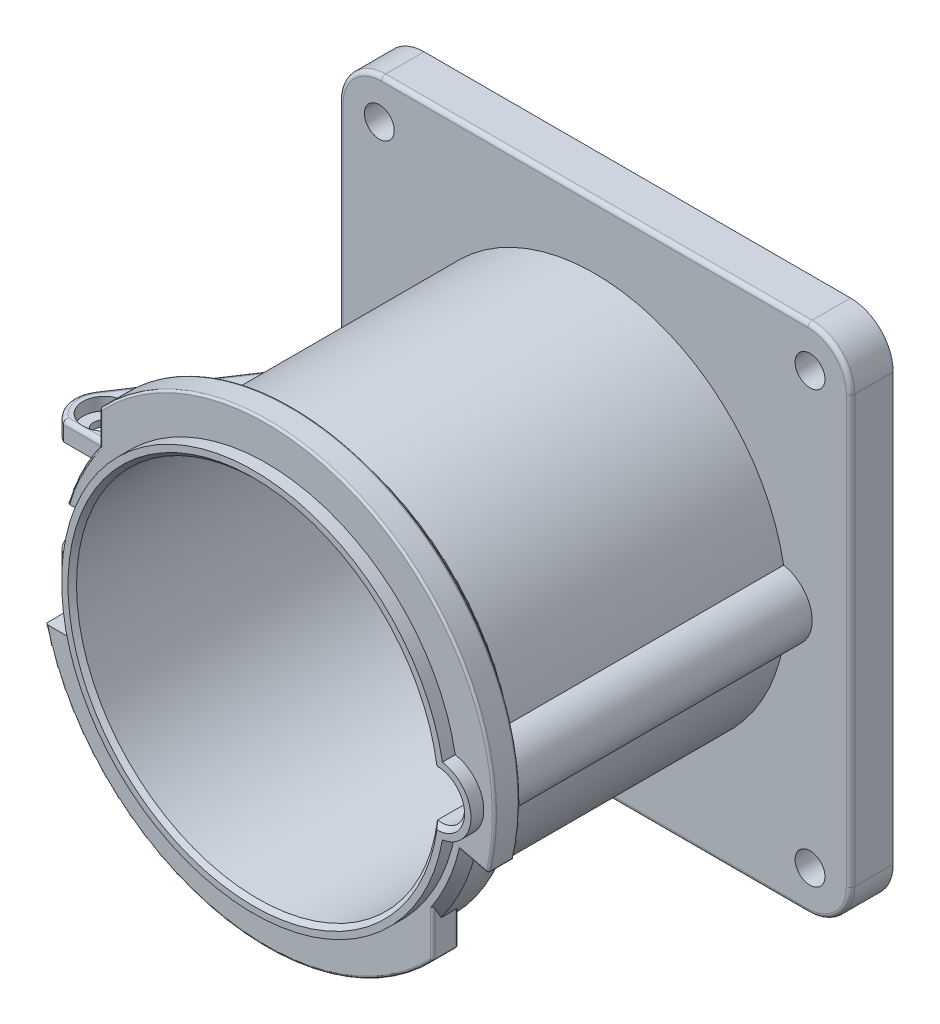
ISO-10303-21;
HEADER;
FILE_DESCRIPTION(('STEP AP214'),'2;1');
FILE_NAME('part.step','',(''),(''),'','','');
FILE_SCHEMA(('AUTOMOTIVE_DESIGN { 1 0 10303 214 1 1 1 1 }'));
ENDSEC;
DATA;
#1=APPLICATION_CONTEXT('core data for automotive mechanical design processes');
#2=APPLICATION_PROTOCOL_DEFINITION('international standard','automotive_design',2000,#1);
#3=PRODUCT_CONTEXT('',#1,'mechanical');
#4=PRODUCT('Part','Part','',(#3));
#5=PRODUCT_RELATED_PRODUCT_CATEGORY('part','',(#4));
#6=PRODUCT_DEFINITION_FORMATION('','',#4);
#7=PRODUCT_DEFINITION_CONTEXT('part definition',#1,'design');
#8=PRODUCT_DEFINITION('design','',#6,#7);
#9=PRODUCT_DEFINITION_SHAPE('','',#8);
#10=(LENGTH_UNIT() NAMED_UNIT(*) SI_UNIT(.MILLI.,.METRE.));
#11=(NAMED_UNIT(*) PLANE_ANGLE_UNIT() SI_UNIT($,.RADIAN.));
#12=(NAMED_UNIT(*) SI_UNIT($,.STERADIAN.) SOLID_ANGLE_UNIT());
#13=UNCERTAINTY_MEASURE_WITH_UNIT(LENGTH_MEASURE(1.E-05),#10,'distance_accuracy_value','');
#14=(GEOMETRIC_REPRESENTATION_CONTEXT(3) GLOBAL_UNCERTAINTY_ASSIGNED_CONTEXT((#13)) GLOBAL_UNIT_ASSIGNED_CONTEXT((#10,
#11,#12)) REPRESENTATION_CONTEXT('',''));
#15=CARTESIAN_POINT('',(0.,0.,0.));
#16=DIRECTION('',(0.,0.,1.));
#17=DIRECTION('',(1.,0.,0.));
#18=AXIS2_PLACEMENT_3D('',#15,#16,#17);
#19=CARTESIAN_POINT('',(0.,0.,88.));
#20=DIRECTION('',(0.,0.,-1.));
#21=DIRECTION('',(-1.,0.,0.));
#22=AXIS2_PLACEMENT_3D('',#19,#20,#21);
#23=CYLINDRICAL_SURFACE('',#22,45.);
#24=DIRECTION('',(0.,0.,1.));
#25=VECTOR('',#24,1.);
#26=CARTESIAN_POINT('',(-43.5057467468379,-11.5,43.));
#27=LINE('',#26,#25);
#28=CARTESIAN_POINT('',(-43.5057467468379,-11.5,43.));
#29=VERTEX_POINT('',#28);
#30=CARTESIAN_POINT('',(-43.5057467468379,-11.5,71.));
#31=VERTEX_POINT('',#30);
#32=EDGE_CURVE('E424',#29,#31,#27,.T.);
#33=ORIENTED_EDGE('',*,*,#32,.T.);
#34=CARTESIAN_POINT('',(0.,0.,71.));
#35=DIRECTION('',(0.,0.,1.));
#36=DIRECTION('',(0.,-1.,0.));
#37=AXIS2_PLACEMENT_3D('',#34,#35,#36);
#38=CIRCLE('',#37,45.);
#39=CARTESIAN_POINT('',(-42.4264068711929,-15.,71.));
#40=VERTEX_POINT('',#39);
#41=EDGE_CURVE('E871',#31,#40,#38,.T.);
#42=ORIENTED_EDGE('',*,*,#41,.T.);
#43=CARTESIAN_POINT('',(-42.4264068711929,-15.,71.));
#44=CARTESIAN_POINT('',(-42.4054996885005,-15.0591496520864,71.0000327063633));
#45=CARTESIAN_POINT('',(-42.3844593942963,-15.1182522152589,70.9947535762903));
#46=CARTESIAN_POINT('',(-42.3427109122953,-15.2347807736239,70.97384178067));
#47=CARTESIAN_POINT('',(-42.3220030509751,-15.2922051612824,70.9581995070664));
#48=CARTESIAN_POINT('',(-42.2815405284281,-15.4037296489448,70.9168137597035));
#49=CARTESIAN_POINT('',(-42.2617867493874,-15.4578266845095,70.8910611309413));
#50=CARTESIAN_POINT('',(-42.2239244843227,-15.5609514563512,70.8300115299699));
#51=CARTESIAN_POINT('',(-42.2058150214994,-15.6099822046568,70.7947202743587));
#52=CARTESIAN_POINT('',(-42.1723718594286,-15.7001053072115,70.7164624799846));
#53=CARTESIAN_POINT('',(-42.1569766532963,-15.7413755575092,70.6737276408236));
#54=CARTESIAN_POINT('',(-42.1290167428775,-15.8160533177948,70.581029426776));
#55=CARTESIAN_POINT('',(-42.1164519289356,-15.8494611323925,70.5310663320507));
#56=CARTESIAN_POINT('',(-42.0954108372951,-15.9052577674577,70.4286078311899));
#57=CARTESIAN_POINT('',(-42.0867324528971,-15.9281929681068,70.3764509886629));
#58=CARTESIAN_POINT('',(-42.0728136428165,-15.9649222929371,70.2686184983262));
#59=CARTESIAN_POINT('',(-42.0675677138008,-15.9787310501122,70.2129486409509));
#60=CARTESIAN_POINT('',(-42.0626072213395,-15.9917819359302,70.1306067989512));
#61=CARTESIAN_POINT('',(-42.0614357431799,-15.9948626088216,70.104575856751));
#62=CARTESIAN_POINT('',(-42.0598735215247,-15.9989700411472,70.0523679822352));
#63=CARTESIAN_POINT('',(-42.0594816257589,-15.9999998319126,70.0261913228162));
#64=CARTESIAN_POINT('',(-42.0594816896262,-16.,70.));
#65=B_SPLINE_CURVE_WITH_KNOTS('',3,(#43,#44,#45,#46,#47,#48,#49,#50,#51,#52,#53,#54,#55,#56,#57,
#58,#59,#60,#61,#62,#63,#64),.UNSPECIFIED.,.F.,.F.,(4,2,2,2,2,2,2,2,2,2,4),(0.,
0.187990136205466,0.376154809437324,0.564490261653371,0.75271309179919,0.935878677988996,
1.11903716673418,1.29106167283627,1.46280968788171,1.54144787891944,1.61996975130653),.UNSPECIFIED.);
#66=CARTESIAN_POINT('',(-42.0594816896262,-16.,70.));
#67=VERTEX_POINT('',#66);
#68=EDGE_CURVE('E51',#40,#67,#65,.T.);
#69=ORIENTED_EDGE('',*,*,#68,.T.);
#70=DIRECTION('',(0.,0.,-1.));
#71=VECTOR('',#70,1.);
#72=CARTESIAN_POINT('',(-42.0594816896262,-16.,88.));
#73=LINE('',#72,#71);
#74=CARTESIAN_POINT('',(-42.0594816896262,-16.,30.006925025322));
#75=VERTEX_POINT('',#74);
#76=EDGE_CURVE('E1730',#67,#75,#73,.T.);
#77=ORIENTED_EDGE('',*,*,#76,.T.);
#78=CARTESIAN_POINT('',(-42.0594816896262,-16.,30.006925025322));
#79=CARTESIAN_POINT('',(-42.0594896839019,-15.9999773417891,29.9480078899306));
#80=CARTESIAN_POINT('',(-42.0600850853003,-15.9984136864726,29.8890581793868));
#81=CARTESIAN_POINT('',(-42.0626201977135,-15.9917481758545,29.7711724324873));
#82=CARTESIAN_POINT('',(-42.0645649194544,-15.9866331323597,29.7122372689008));
#83=CARTESIAN_POINT('',(-42.0699996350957,-15.972325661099,29.5942735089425));
#84=CARTESIAN_POINT('',(-42.0735060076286,-15.963090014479,29.5352507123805));
#85=CARTESIAN_POINT('',(-42.0823101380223,-15.93986610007,29.41835330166));
#86=CARTESIAN_POINT('',(-42.0876048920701,-15.9258858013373,29.3604769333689));
#87=CARTESIAN_POINT('',(-42.0993963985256,-15.8946864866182,29.2548795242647));
#88=CARTESIAN_POINT('',(-42.1056069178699,-15.8782326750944,29.2069043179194));
#89=CARTESIAN_POINT('',(-42.1198575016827,-15.8403918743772,29.1131731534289));
#90=CARTESIAN_POINT('',(-42.1278974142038,-15.8190052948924,29.0674170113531));
#91=CARTESIAN_POINT('',(-42.1462628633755,-15.7700103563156,28.9788752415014));
#92=CARTESIAN_POINT('',(-42.1566198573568,-15.7423162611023,28.9361423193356));
#93=CARTESIAN_POINT('',(-42.1798655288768,-15.679924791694,28.8569328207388));
#94=CARTESIAN_POINT('',(-42.192743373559,-15.6452573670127,28.8204306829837));
#95=CARTESIAN_POINT('',(-42.2155227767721,-15.5836533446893,28.7695596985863));
#96=CARTESIAN_POINT('',(-42.2246282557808,-15.5589694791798,28.7521091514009));
#97=CARTESIAN_POINT('',(-42.2436629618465,-15.5072143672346,28.7217767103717));
#98=CARTESIAN_POINT('',(-42.2535915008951,-15.4801451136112,28.708891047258));
#99=CARTESIAN_POINT('',(-42.2740672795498,-15.4241410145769,28.68837739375));
#100=CARTESIAN_POINT('',(-42.2846169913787,-15.3951986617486,28.6807722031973));
#101=CARTESIAN_POINT('',(-42.3059467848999,-15.336487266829,28.6711858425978));
#102=CARTESIAN_POINT('',(-42.3167268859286,-15.3067181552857,28.6692051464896));
#103=CARTESIAN_POINT('',(-42.33764275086,-15.2487674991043,28.6705460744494));
#104=CARTESIAN_POINT('',(-42.3477839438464,-15.220580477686,28.6736094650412));
#105=CARTESIAN_POINT('',(-42.3677583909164,-15.1648911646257,28.6839854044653));
#106=CARTESIAN_POINT('',(-42.3775912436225,-15.1373897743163,28.6913032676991));
#107=CARTESIAN_POINT('',(-42.4007418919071,-15.0724492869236,28.7132367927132));
#108=CARTESIAN_POINT('',(-42.4138533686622,-15.0355097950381,28.7296092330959));
#109=CARTESIAN_POINT('',(-42.4264068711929,-15.,28.7486227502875));
#110=B_SPLINE_CURVE_WITH_KNOTS('',3,(#78,#79,#80,#81,#82,#83,#84,#85,#86,#87,#88,#89,#90,#91,
#92,#93,#94,#95,#96,#97,#98,#99,#100,#101,#102,#103,#104,#105,#106,#107,#108,#109),
.UNSPECIFIED.,.F.,.F.,(4,2,2,2,2,2,2,2,2,2,2,2,2,2,2,4),(0.,0.176778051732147,0.354216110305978,
0.5335606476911,0.712605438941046,0.865648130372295,1.01867811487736,1.17392749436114,
1.32852381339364,1.42286890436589,1.51713591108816,1.61180745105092,1.70648696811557,
1.79646831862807,1.88656231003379,2.01324242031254),.UNSPECIFIED.);
#111=CARTESIAN_POINT('',(-42.4264068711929,-15.,28.7486227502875));
#112=VERTEX_POINT('',#111);
#113=EDGE_CURVE('E12',#75,#112,#110,.T.);
#114=ORIENTED_EDGE('',*,*,#113,.T.);
#115=CARTESIAN_POINT('',(0.,0.,-35.4292251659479));
#116=DIRECTION('',(-0.834196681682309,0.,-0.551467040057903));
#117=DIRECTION('',(0.551467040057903,0.,-0.834196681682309));
#118=AXIS2_PLACEMENT_3D('',#115,#116,#117);
#119=ELLIPSE('',#118,81.6005250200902,45.);
#120=CARTESIAN_POINT('',(-42.4264068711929,15.,28.7486227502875));
#121=VERTEX_POINT('',#120);
#122=EDGE_CURVE('E1731',#112,#121,#119,.T.);
#123=ORIENTED_EDGE('',*,*,#122,.T.);
#124=CARTESIAN_POINT('',(-42.4264068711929,15.,28.7486227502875));
#125=CARTESIAN_POINT('',(-42.4161605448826,15.0289827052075,28.7331121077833));
#126=CARTESIAN_POINT('',(-42.4055447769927,15.05891245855,28.719352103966));
#127=CARTESIAN_POINT('',(-42.3836090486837,15.1205407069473,28.6962243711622));
#128=CARTESIAN_POINT('',(-42.3722830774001,15.1522539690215,28.6869022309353));
#129=CARTESIAN_POINT('',(-42.3490945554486,15.2169437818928,28.6738501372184));
#130=CARTESIAN_POINT('',(-42.3372288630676,15.2499274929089,28.6701588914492));
#131=CARTESIAN_POINT('',(-42.313438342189,15.3158138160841,28.6694233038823));
#132=CARTESIAN_POINT('',(-42.301514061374,15.3487160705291,28.6723475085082));
#133=CARTESIAN_POINT('',(-42.2790356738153,15.4105201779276,28.6845257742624));
#134=CARTESIAN_POINT('',(-42.2684518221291,15.4395229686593,28.6932148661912));
#135=CARTESIAN_POINT('',(-42.2479183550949,15.4956216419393,28.7159568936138));
#136=CARTESIAN_POINT('',(-42.2379697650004,15.5227144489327,28.7300182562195));
#137=CARTESIAN_POINT('',(-42.2174356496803,15.5784835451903,28.7652980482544));
#138=CARTESIAN_POINT('',(-42.2070046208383,15.606714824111,28.78730342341));
#139=CARTESIAN_POINT('',(-42.1874834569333,15.6594071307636,28.8359013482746));
#140=CARTESIAN_POINT('',(-42.1783950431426,15.6838633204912,28.8624996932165));
#141=CARTESIAN_POINT('',(-42.1574353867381,15.7401378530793,28.932660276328));
#142=CARTESIAN_POINT('',(-42.1463527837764,15.7697728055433,28.9781926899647));
#143=CARTESIAN_POINT('',(-42.1266878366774,15.8222297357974,29.0735107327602));
#144=CARTESIAN_POINT('',(-42.1181122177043,15.8450333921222,29.1233073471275));
#145=CARTESIAN_POINT('',(-42.1039947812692,15.8825051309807,29.2191003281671));
#146=CARTESIAN_POINT('',(-42.0982096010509,15.8978287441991,29.2648112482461));
#147=CARTESIAN_POINT('',(-42.0880311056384,15.9247556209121,29.3574812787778));
#148=CARTESIAN_POINT('',(-42.0836389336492,15.9363558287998,29.4044413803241));
#149=CARTESIAN_POINT('',(-42.07226367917,15.9663743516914,29.5465917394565));
#150=CARTESIAN_POINT('',(-42.067093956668,15.9799785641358,29.6429627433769));
#151=CARTESIAN_POINT('',(-42.0623438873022,15.9924742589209,29.7842647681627));
#152=CARTESIAN_POINT('',(-42.0612527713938,15.9953436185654,29.8288897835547));
#153=CARTESIAN_POINT('',(-42.0598245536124,15.9990988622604,29.917980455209));
#154=CARTESIAN_POINT('',(-42.0594831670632,15.9999960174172,29.9624455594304));
#155=CARTESIAN_POINT('',(-42.0594816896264,16.0000000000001,30.006925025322));
#156=B_SPLINE_CURVE_WITH_KNOTS('',3,(#124,#125,#126,#127,#128,#129,#130,#131,#132,#133,#134,
#135,#136,#137,#138,#139,#140,#141,#142,#143,#144,#145,#146,#147,#148,#149,#150,#151,#152,#153,
#154,#155),.UNSPECIFIED.,.F.,.F.,(4,2,2,2,2,2,2,2,2,2,2,2,2,2,2,4),(0.,0.103419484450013,
0.207879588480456,0.313054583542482,0.417730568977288,0.513420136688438,0.609260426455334,
0.720499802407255,0.83188057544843,0.99729005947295,1.16313927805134,1.30859877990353,
1.4541773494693,1.74561847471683,1.87978215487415,2.01317707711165),.UNSPECIFIED.);
#157=CARTESIAN_POINT('',(-42.0594816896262,16.,30.006925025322));
#158=VERTEX_POINT('',#157);
#159=EDGE_CURVE('E802',#121,#158,#156,.T.);
#160=ORIENTED_EDGE('',*,*,#159,.T.);
#161=DIRECTION('',(0.,0.,-1.));
#162=VECTOR('',#161,1.);
#163=CARTESIAN_POINT('',(-42.0594816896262,16.,88.));
#164=LINE('',#163,#162);
#165=CARTESIAN_POINT('',(-42.0594816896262,16.,70.));
#166=VERTEX_POINT('',#165);
#167=EDGE_CURVE('E864',#166,#158,#164,.T.);
#168=ORIENTED_EDGE('',*,*,#167,.F.);
#169=CARTESIAN_POINT('',(-42.0594816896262,16.,70.));
#170=CARTESIAN_POINT('',(-42.0594812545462,16.0000007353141,70.0268337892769));
#171=CARTESIAN_POINT('',(-42.0598928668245,15.9989191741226,70.053654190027));
#172=CARTESIAN_POINT('',(-42.0615316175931,15.9946105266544,70.107091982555));
#173=CARTESIAN_POINT('',(-42.0627586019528,15.9913838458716,70.133709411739));
#174=CARTESIAN_POINT('',(-42.0676386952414,15.9785438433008,70.2128249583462));
#175=CARTESIAN_POINT('',(-42.0724910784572,15.9657702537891,70.264774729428));
#176=CARTESIAN_POINT('',(-42.0851826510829,15.9322853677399,70.3656099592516));
#177=CARTESIAN_POINT('',(-42.093021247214,15.9115756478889,70.4144960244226));
#178=CARTESIAN_POINT('',(-42.1113668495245,15.8629585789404,70.5080159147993));
#179=CARTESIAN_POINT('',(-42.1218748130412,15.8350486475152,70.5526482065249));
#180=CARTESIAN_POINT('',(-42.1454990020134,15.7720662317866,70.6378071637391));
#181=CARTESIAN_POINT('',(-42.1586805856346,15.7368135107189,70.6781820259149));
#182=CARTESIAN_POINT('',(-42.1869962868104,15.6607467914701,70.7524909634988));
#183=CARTESIAN_POINT('',(-42.2021309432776,15.6199312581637,70.7864232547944));
#184=CARTESIAN_POINT('',(-42.2348665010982,15.5312078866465,70.8490855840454));
#185=CARTESIAN_POINT('',(-42.252561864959,15.4830181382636,70.8773668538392));
#186=CARTESIAN_POINT('',(-42.2890908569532,15.3829656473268,70.9254287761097));
#187=CARTESIAN_POINT('',(-42.3079246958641,15.3311022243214,70.9452078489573));
#188=CARTESIAN_POINT('',(-42.3433884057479,15.2328514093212,70.9736517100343));
#189=CARTESIAN_POINT('',(-42.3599358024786,15.1867782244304,70.983522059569));
#190=CARTESIAN_POINT('',(-42.3931505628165,15.0938154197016,70.9966969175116));
#191=CARTESIAN_POINT('',(-42.4098177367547,15.0469269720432,71.0000101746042));
#192=CARTESIAN_POINT('',(-42.4264068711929,15.,71.));
#193=B_SPLINE_CURVE_WITH_KNOTS('',3,(#169,#170,#171,#172,#173,#174,#175,#176,#177,#178,#179,
#180,#181,#182,#183,#184,#185,#186,#187,#188,#189,#190,#191,#192),.UNSPECIFIED.,.F.,.F.,(4,2,2,
2,2,2,2,2,2,2,2,4),(0.,0.0804501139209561,0.160885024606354,0.321197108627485,0.481477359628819,
0.641815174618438,0.806687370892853,0.971605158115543,1.14667399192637,1.32177533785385,
1.47116427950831,1.6203537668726),.UNSPECIFIED.);
#194=CARTESIAN_POINT('',(-42.4264068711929,15.,71.));
#195=VERTEX_POINT('',#194);
#196=EDGE_CURVE('E808',#166,#195,#193,.T.);
#197=ORIENTED_EDGE('',*,*,#196,.T.);
#198=CARTESIAN_POINT('',(-43.5057467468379,11.5,71.));
#199=VERTEX_POINT('',#198);
#200=EDGE_CURVE('E420',#195,#199,#38,.T.);
#201=ORIENTED_EDGE('',*,*,#200,.T.);
#202=DIRECTION('',(0.,0.,1.));
#203=VECTOR('',#202,1.);
#204=CARTESIAN_POINT('',(-43.5057467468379,11.5,43.));
#205=LINE('',#204,#203);
#206=CARTESIAN_POINT('',(-43.5057467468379,11.5,43.));
#207=VERTEX_POINT('',#206);
#208=EDGE_CURVE('E414',#207,#199,#205,.T.);
#209=ORIENTED_EDGE('',*,*,#208,.F.);
#210=CARTESIAN_POINT('',(0.,0.,43.));
#211=DIRECTION('',(0.,0.,-1.));
#212=DIRECTION('',(1.,0.,0.));
#213=AXIS2_PLACEMENT_3D('',#210,#211,#212);
#214=CIRCLE('',#213,45.);
#215=EDGE_CURVE('E419',#29,#207,#214,.T.);
#216=ORIENTED_EDGE('',*,*,#215,.F.);
#217=EDGE_LOOP('',(#33,#42,#69,#77,#114,#123,#160,#168,#197,#201,#209,#216));
#218=FACE_BOUND('',#217,.T.);
#219=CARTESIAN_POINT('',(0.,0.,8.00000000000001));
#220=DIRECTION('',(0.,0.,-1.));
#221=DIRECTION('',(-1.,0.,0.));
#222=AXIS2_PLACEMENT_3D('',#219,#220,#221);
#223=CIRCLE('',#222,45.);
#224=CARTESIAN_POINT('',(44.3023255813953,-7.89328499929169,8.));
#225=VERTEX_POINT('',#224);
#226=CARTESIAN_POINT('',(44.3023255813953,7.89328499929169,8.));
#227=VERTEX_POINT('',#226);
#228=EDGE_CURVE('E727',#225,#227,#223,.T.);
#229=ORIENTED_EDGE('',*,*,#228,.F.);
#230=DIRECTION('',(0.,0.,1.));
#231=VECTOR('',#230,1.);
#232=CARTESIAN_POINT('',(44.3023255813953,-7.89328499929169,46.5));
#233=LINE('',#232,#231);
#234=CARTESIAN_POINT('',(44.3023255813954,-7.89328499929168,75.));
#235=VERTEX_POINT('',#234);
#236=EDGE_CURVE('E527',#225,#235,#233,.T.);
#237=ORIENTED_EDGE('',*,*,#236,.T.);
#238=CARTESIAN_POINT('',(0.,0.,75.));
#239=DIRECTION('',(0.,0.,1.));
#240=DIRECTION('',(1.,0.,0.));
#241=AXIS2_PLACEMENT_3D('',#238,#239,#240);
#242=CIRCLE('',#241,45.);
#243=CARTESIAN_POINT('',(-42.9272640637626,-13.5,75.));
#244=VERTEX_POINT('',#243);
#245=EDGE_CURVE('E495',#244,#235,#242,.T.);
#246=ORIENTED_EDGE('',*,*,#245,.F.);
#247=DIRECTION('',(0.,0.,1.));
#248=VECTOR('',#247,1.);
#249=CARTESIAN_POINT('',(-42.9272640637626,-13.5,74.));
#250=LINE('',#249,#248);
#251=CARTESIAN_POINT('',(-42.9272640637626,-13.5,85.));
#252=VERTEX_POINT('',#251);
#253=EDGE_CURVE('E472',#244,#252,#250,.T.);
#254=ORIENTED_EDGE('',*,*,#253,.T.);
#255=CARTESIAN_POINT('',(0.,0.,85.));
#256=DIRECTION('',(0.,0.,1.));
#257=DIRECTION('',(1.,0.,0.));
#258=AXIS2_PLACEMENT_3D('',#255,#256,#257);
#259=CIRCLE('',#258,45.);
#260=CARTESIAN_POINT('',(44.3023255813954,-7.89328499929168,85.));
#261=VERTEX_POINT('',#260);
#262=EDGE_CURVE('E500',#252,#261,#259,.T.);
#263=ORIENTED_EDGE('',*,*,#262,.T.);
#264=CARTESIAN_POINT('',(44.3023255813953,-7.89328499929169,88.));
#265=VERTEX_POINT('',#264);
#266=EDGE_CURVE('E526',#261,#265,#233,.T.);
#267=ORIENTED_EDGE('',*,*,#266,.T.);
#268=CARTESIAN_POINT('',(0.,0.,88.));
#269=DIRECTION('',(0.,0.,1.));
#270=DIRECTION('',(1.,0.,0.));
#271=AXIS2_PLACEMENT_3D('',#268,#269,#270);
#272=CIRCLE('',#271,45.);
#273=CARTESIAN_POINT('',(44.3023255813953,7.8932849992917,88.));
#274=VERTEX_POINT('',#273);
#275=EDGE_CURVE('E529',#274,#265,#272,.T.);
#276=ORIENTED_EDGE('',*,*,#275,.F.);
#277=DIRECTION('',(0.,0.,1.));
#278=VECTOR('',#277,1.);
#279=CARTESIAN_POINT('',(44.3023255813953,7.89328499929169,46.5));
#280=LINE('',#279,#278);
#281=CARTESIAN_POINT('',(44.3023255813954,7.89328499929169,85.));
#282=VERTEX_POINT('',#281);
#283=EDGE_CURVE('E523',#274,#282,#280,.F.);
#284=ORIENTED_EDGE('',*,*,#283,.T.);
#285=CARTESIAN_POINT('',(-42.9272640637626,13.5,85.));
#286=VERTEX_POINT('',#285);
#287=EDGE_CURVE('E496',#282,#286,#259,.T.);
#288=ORIENTED_EDGE('',*,*,#287,.T.);
#289=DIRECTION('',(0.,0.,1.));
#290=VECTOR('',#289,1.);
#291=CARTESIAN_POINT('',(-42.9272640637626,13.5,74.));
#292=LINE('',#291,#290);
#293=CARTESIAN_POINT('',(-42.9272640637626,13.5,75.));
#294=VERTEX_POINT('',#293);
#295=EDGE_CURVE('E469',#294,#286,#292,.T.);
#296=ORIENTED_EDGE('',*,*,#295,.F.);
#297=CARTESIAN_POINT('',(44.3023255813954,7.89328499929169,75.));
#298=VERTEX_POINT('',#297);
#299=EDGE_CURVE('E501',#298,#294,#242,.T.);
#300=ORIENTED_EDGE('',*,*,#299,.F.);
#301=EDGE_CURVE('E522',#298,#227,#280,.F.);
#302=ORIENTED_EDGE('',*,*,#301,.T.);
#303=EDGE_LOOP('',(#229,#237,#246,#254,#263,#267,#276,#284,#288,#296,#300,#302));
#304=FACE_BOUND('',#303,.T.);
#305=ADVANCED_FACE('F37',(#218,#304),#23,.T.);
#306=CARTESIAN_POINT('',(43.,0.,4.99999999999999));
#307=DIRECTION('',(0.,0.,1.));
#308=DIRECTION('',(1.,0.,0.));
#309=AXIS2_PLACEMENT_3D('',#306,#307,#308);
#310=CYLINDRICAL_SURFACE('',#309,8.);
#311=ORIENTED_EDGE('',*,*,#236,.F.);
#312=CARTESIAN_POINT('',(43.,0.,8.));
#313=DIRECTION('',(0.,0.,-1.));
#314=DIRECTION('',(-1.,0.,0.));
#315=AXIS2_PLACEMENT_3D('',#312,#313,#314);
#316=CIRCLE('',#315,8.);
#317=EDGE_CURVE('E721',#225,#227,#316,.F.);
#318=ORIENTED_EDGE('',*,*,#317,.T.);
#319=ORIENTED_EDGE('',*,*,#301,.F.);
#320=CARTESIAN_POINT('',(43.,0.,75.));
#321=DIRECTION('',(0.,0.,1.));
#322=DIRECTION('',(1.,0.,0.));
#323=AXIS2_PLACEMENT_3D('',#320,#321,#322);
#324=CIRCLE('',#323,8.);
#325=CARTESIAN_POINT('',(47.546511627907,6.58249436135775,75.));
#326=VERTEX_POINT('',#325);
#327=EDGE_CURVE('E508',#298,#326,#324,.F.);
#328=ORIENTED_EDGE('',*,*,#327,.T.);
#329=CARTESIAN_POINT('',(47.546511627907,6.58249436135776,75.));
#330=CARTESIAN_POINT('',(47.5677038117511,6.56785750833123,75.0000058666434));
#331=CARTESIAN_POINT('',(47.5888097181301,6.55312773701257,75.0010811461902));
#332=CARTESIAN_POINT('',(47.6307494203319,6.52355874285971,75.0053566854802));
#333=CARTESIAN_POINT('',(47.6515830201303,6.50871945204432,75.0085583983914));
#334=CARTESIAN_POINT('',(47.7137753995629,6.46397152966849,75.021390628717));
#335=CARTESIAN_POINT('',(47.754521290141,6.43404332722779,75.0342479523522));
#336=CARTESIAN_POINT('',(47.8241955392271,6.38189587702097,75.0648547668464));
#337=CARTESIAN_POINT('',(47.8537292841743,6.35944908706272,75.0808678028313));
#338=CARTESIAN_POINT('',(47.9101402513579,6.31599377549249,75.1184558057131));
#339=CARTESIAN_POINT('',(47.9370254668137,6.29498098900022,75.140013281));
#340=CARTESIAN_POINT('',(47.9795065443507,6.26139105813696,75.1817541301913));
#341=CARTESIAN_POINT('',(47.9960764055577,6.24816845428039,75.2004260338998));
#342=CARTESIAN_POINT('',(48.0267096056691,6.22354997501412,75.2408151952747));
#343=CARTESIAN_POINT('',(48.0407757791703,6.21215203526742,75.2625289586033));
#344=CARTESIAN_POINT('',(48.0629048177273,6.19412255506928,75.3039309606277));
#345=CARTESIAN_POINT('',(48.07160821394,6.18699299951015,75.3230573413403));
#346=CARTESIAN_POINT('',(48.0864516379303,6.17479570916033,75.3628752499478));
#347=CARTESIAN_POINT('',(48.0925980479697,6.16972284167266,75.3835627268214));
#348=CARTESIAN_POINT('',(48.1006174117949,6.16309356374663,75.4202322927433));
#349=CARTESIAN_POINT('',(48.10319904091,6.16095514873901,75.4359563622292));
#350=CARTESIAN_POINT('',(48.1066791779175,6.1580702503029,75.4677794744));
#351=CARTESIAN_POINT('',(48.1075706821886,6.15732955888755,75.4838797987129));
#352=CARTESIAN_POINT('',(48.1075581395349,6.15734113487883,75.5));
#353=B_SPLINE_CURVE_WITH_KNOTS('',3,(#329,#330,#331,#332,#333,#334,#335,#336,#337,#338,#339,
#340,#341,#342,#343,#344,#345,#346,#347,#348,#349,#350,#351,#352),.UNSPECIFIED.,.F.,.F.,(4,2,2,
2,2,2,2,2,2,2,2,4),(0.,0.0772085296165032,0.154469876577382,0.310089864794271,0.430917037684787,
0.551367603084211,0.635855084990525,0.720246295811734,0.786567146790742,0.852721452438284,
0.900807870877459,0.949093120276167),.UNSPECIFIED.);
#354=CARTESIAN_POINT('',(48.1075581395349,6.15734113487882,75.5));
#355=VERTEX_POINT('',#354);
#356=EDGE_CURVE('E678',#326,#355,#353,.T.);
#357=ORIENTED_EDGE('',*,*,#356,.T.);
#358=DIRECTION('',(0.,0.,-1.));
#359=VECTOR('',#358,1.);
#360=CARTESIAN_POINT('',(48.1075581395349,6.15734113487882,80.));
#361=LINE('',#360,#359);
#362=CARTESIAN_POINT('',(48.1075581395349,6.15734113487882,79.));
#363=VERTEX_POINT('',#362);
#364=EDGE_CURVE('E499',#355,#363,#361,.F.);
#365=ORIENTED_EDGE('',*,*,#364,.T.);
#366=CARTESIAN_POINT('',(43.,0.,79.));
#367=DIRECTION('',(0.,0.,1.));
#368=DIRECTION('',(1.,0.,0.));
#369=AXIS2_PLACEMENT_3D('',#366,#367,#368);
#370=CIRCLE('',#369,8.);
#371=CARTESIAN_POINT('',(48.1075581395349,-6.1573411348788,79.));
#372=VERTEX_POINT('',#371);
#373=EDGE_CURVE('E484',#363,#372,#370,.F.);
#374=ORIENTED_EDGE('',*,*,#373,.T.);
#375=DIRECTION('',(0.,0.,-1.));
#376=VECTOR('',#375,1.);
#377=CARTESIAN_POINT('',(48.1075581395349,-6.15734113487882,80.));
#378=LINE('',#377,#376);
#379=CARTESIAN_POINT('',(48.1075581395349,-6.15734113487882,75.5));
#380=VERTEX_POINT('',#379);
#381=EDGE_CURVE('E505',#372,#380,#378,.T.);
#382=ORIENTED_EDGE('',*,*,#381,.T.);
#383=CARTESIAN_POINT('',(48.1075581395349,-6.15734113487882,75.5));
#384=CARTESIAN_POINT('',(48.1076016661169,-6.15730131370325,75.4778356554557));
#385=CARTESIAN_POINT('',(48.1058989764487,-6.15871757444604,75.4557390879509));
#386=CARTESIAN_POINT('',(48.0993907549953,-6.16410926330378,75.4125433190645));
#387=CARTESIAN_POINT('',(48.0946158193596,-6.16805945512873,75.3914364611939));
#388=CARTESIAN_POINT('',(48.0823602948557,-6.17816090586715,75.350691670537));
#389=CARTESIAN_POINT('',(48.0748890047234,-6.18430459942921,75.3310489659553));
#390=CARTESIAN_POINT('',(48.0577039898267,-6.19836713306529,75.2934140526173));
#391=CARTESIAN_POINT('',(48.0479844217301,-6.20629059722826,75.2754263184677));
#392=CARTESIAN_POINT('',(48.0218636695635,-6.22746170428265,75.2334213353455));
#393=CARTESIAN_POINT('',(48.0044438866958,-6.24148335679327,75.2104287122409));
#394=CARTESIAN_POINT('',(47.9668449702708,-6.27144589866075,75.1682825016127));
#395=CARTESIAN_POINT('',(47.9466602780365,-6.28739064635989,75.1491368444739));
#396=CARTESIAN_POINT('',(47.8960173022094,-6.32695846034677,75.107743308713));
#397=CARTESIAN_POINT('',(47.8646201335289,-6.35115285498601,75.0871926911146));
#398=CARTESIAN_POINT('',(47.7992449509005,-6.40069844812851,75.0526473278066));
#399=CARTESIAN_POINT('',(47.7652632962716,-6.42605125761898,75.0386620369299));
#400=CARTESIAN_POINT('',(47.700629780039,-6.4734412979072,75.0185584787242));
#401=CARTESIAN_POINT('',(47.6702006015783,-6.49543178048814,75.0115988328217));
#402=CARTESIAN_POINT('',(47.608735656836,-6.53918910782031,75.0023432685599));
#403=CARTESIAN_POINT('',(47.5777040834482,-6.56095651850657,75.0000222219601));
#404=CARTESIAN_POINT('',(47.546511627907,-6.58249436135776,75.));
#405=B_SPLINE_CURVE_WITH_KNOTS('',3,(#383,#384,#385,#386,#387,#388,#389,#390,#391,#392,#393,
#394,#395,#396,#397,#398,#399,#400,#401,#402,#403,#404),.UNSPECIFIED.,.F.,.F.,(4,2,2,2,2,2,2,2,
2,2,4),(0.,0.0662751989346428,0.131900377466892,0.197301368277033,0.262874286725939,
0.358560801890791,0.454442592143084,0.587678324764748,0.721105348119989,0.835370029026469,
0.949014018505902),.UNSPECIFIED.);
#406=CARTESIAN_POINT('',(47.546511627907,-6.58249436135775,75.));
#407=VERTEX_POINT('',#406);
#408=EDGE_CURVE('E670',#380,#407,#405,.T.);
#409=ORIENTED_EDGE('',*,*,#408,.T.);
#410=EDGE_CURVE('E511',#407,#235,#324,.F.);
#411=ORIENTED_EDGE('',*,*,#410,.T.);
#412=EDGE_LOOP('',(#311,#318,#319,#328,#357,#365,#374,#382,#409,#411));
#413=FACE_BOUND('',#412,.T.);
#414=ADVANCED_FACE('F691',(#413),#310,.T.);
#415=CARTESIAN_POINT('',(0.,0.,5.99999999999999));
#416=DIRECTION('',(0.,0.,1.));
#417=DIRECTION('',(1.,0.,0.));
#418=AXIS2_PLACEMENT_3D('',#415,#416,#417);
#419=CYLINDRICAL_SURFACE('',#418,42.5);
#420=CARTESIAN_POINT('',(0.,0.,8.));
#421=DIRECTION('',(0.,0.,-1.));
#422=DIRECTION('',(-1.,0.,0.));
#423=AXIS2_PLACEMENT_3D('',#420,#421,#422);
#424=CIRCLE('',#423,42.5);
#425=CARTESIAN_POINT('',(42.1511627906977,5.43410299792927,8.));
#426=VERTEX_POINT('',#425);
#427=CARTESIAN_POINT('',(42.1511627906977,-5.43410299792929,8.));
#428=VERTEX_POINT('',#427);
#429=EDGE_CURVE('E735',#426,#428,#424,.F.);
#430=ORIENTED_EDGE('',*,*,#429,.F.);
#431=DIRECTION('',(0.,0.,1.));
#432=VECTOR('',#431,1.);
#433=CARTESIAN_POINT('',(42.1511627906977,5.43410299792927,5.99999999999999));
#434=LINE('',#433,#432);
#435=CARTESIAN_POINT('',(42.1511627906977,5.43410299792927,87.));
#436=VERTEX_POINT('',#435);
#437=EDGE_CURVE('E519',#426,#436,#434,.T.);
#438=ORIENTED_EDGE('',*,*,#437,.T.);
#439=CARTESIAN_POINT('',(0.,0.,87.));
#440=DIRECTION('',(0.,0.,1.));
#441=DIRECTION('',(1.,0.,0.));
#442=AXIS2_PLACEMENT_3D('',#439,#440,#441);
#443=CIRCLE('',#442,42.5);
#444=CARTESIAN_POINT('',(42.1511627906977,-5.43410299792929,87.));
#445=VERTEX_POINT('',#444);
#446=EDGE_CURVE('E1732',#436,#445,#443,.T.);
#447=ORIENTED_EDGE('',*,*,#446,.T.);
#448=DIRECTION('',(0.,0.,1.));
#449=VECTOR('',#448,1.);
#450=CARTESIAN_POINT('',(42.1511627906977,-5.43410299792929,5.99999999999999));
#451=LINE('',#450,#449);
#452=EDGE_CURVE('E516',#428,#445,#451,.T.);
#453=ORIENTED_EDGE('',*,*,#452,.F.);
#454=EDGE_LOOP('',(#430,#438,#447,#453));
#455=FACE_BOUND('',#454,.T.);
#456=ADVANCED_FACE('F711',(#455),#419,.F.);
#457=CARTESIAN_POINT('',(43.,0.,5.99999999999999));
#458=DIRECTION('',(0.,0.,1.));
#459=DIRECTION('',(1.,0.,0.));
#460=AXIS2_PLACEMENT_3D('',#457,#458,#459);
#461=CYLINDRICAL_SURFACE('',#460,5.5);
#462=CARTESIAN_POINT('',(43.,0.,8.));
#463=DIRECTION('',(0.,0.,-1.));
#464=DIRECTION('',(-1.,0.,0.));
#465=AXIS2_PLACEMENT_3D('',#462,#463,#464);
#466=CIRCLE('',#465,5.5);
#467=EDGE_CURVE('E878',#428,#426,#466,.F.);
#468=ORIENTED_EDGE('',*,*,#467,.F.);
#469=ORIENTED_EDGE('',*,*,#452,.T.);
#470=CARTESIAN_POINT('',(43.,0.,87.));
#471=DIRECTION('',(0.,0.,1.));
#472=DIRECTION('',(1.,0.,0.));
#473=AXIS2_PLACEMENT_3D('',#470,#471,#472);
#474=CIRCLE('',#473,5.5);
#475=EDGE_CURVE('E677',#445,#436,#474,.T.);
#476=ORIENTED_EDGE('',*,*,#475,.T.);
#477=ORIENTED_EDGE('',*,*,#437,.F.);
#478=EDGE_LOOP('',(#468,#469,#476,#477));
#479=FACE_BOUND('',#478,.T.);
#480=ADVANCED_FACE('F692',(#479),#461,.F.);
#481=CARTESIAN_POINT('',(-58.0000000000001,-29.,65.));
#482=DIRECTION('',(0.,1.,0.));
#483=DIRECTION('',(-1.,0.,0.));
#484=AXIS2_PLACEMENT_3D('',#481,#482,#483);
#485=CYLINDRICAL_SURFACE('',#484,2.5);
#486=CARTESIAN_POINT('',(-58.0000000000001,-11.5,65.));
#487=DIRECTION('',(0.,-1.,0.));
#488=DIRECTION('',(0.,0.,-1.));
#489=AXIS2_PLACEMENT_3D('',#486,#487,#488);
#490=CIRCLE('',#489,2.5);
#491=CARTESIAN_POINT('',(-58.0000000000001,-11.5,62.5));
#492=VERTEX_POINT('',#491);
#493=EDGE_CURVE('E439',#492,#492,#490,.T.);
#494=ORIENTED_EDGE('',*,*,#493,.F.);
#495=EDGE_LOOP('',(#494));
#496=FACE_BOUND('',#495,.T.);
#497=CARTESIAN_POINT('',(-58.0000000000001,-13.,65.));
#498=DIRECTION('',(0.,-1.,0.));
#499=DIRECTION('',(1.,0.,0.));
#500=AXIS2_PLACEMENT_3D('',#497,#498,#499);
#501=CIRCLE('',#500,2.5);
#502=CARTESIAN_POINT('',(-55.5000000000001,-13.,65.));
#503=VERTEX_POINT('',#502);
#504=EDGE_CURVE('E885',#503,#503,#501,.F.);
#505=ORIENTED_EDGE('',*,*,#504,.F.);
#506=EDGE_LOOP('',(#505));
#507=FACE_BOUND('',#506,.T.);
#508=ADVANCED_FACE('F1017',(#496,#507),#485,.F.);
#509=CARTESIAN_POINT('',(-58.0000000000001,11.5,65.));
#510=DIRECTION('',(0.,1.,0.));
#511=DIRECTION('',(0.,0.,1.));
#512=AXIS2_PLACEMENT_3D('',#509,#510,#511);
#513=CIRCLE('',#512,2.5);
#514=CARTESIAN_POINT('',(-58.0000000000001,11.5,67.5));
#515=VERTEX_POINT('',#514);
#516=EDGE_CURVE('E442',#515,#515,#513,.T.);
#517=ORIENTED_EDGE('',*,*,#516,.F.);
#518=EDGE_LOOP('',(#517));
#519=FACE_BOUND('',#518,.T.);
#520=CARTESIAN_POINT('',(-58.0000000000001,13.,65.));
#521=DIRECTION('',(0.,1.,0.));
#522=DIRECTION('',(-1.,0.,0.));
#523=AXIS2_PLACEMENT_3D('',#520,#521,#522);
#524=CIRCLE('',#523,2.5);
#525=CARTESIAN_POINT('',(-60.5000000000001,13.,65.));
#526=VERTEX_POINT('',#525);
#527=EDGE_CURVE('E881',#526,#526,#524,.F.);
#528=ORIENTED_EDGE('',*,*,#527,.F.);
#529=EDGE_LOOP('',(#528));
#530=FACE_BOUND('',#529,.T.);
#531=ADVANCED_FACE('F1020',(#519,#530),#485,.F.);
#532=CARTESIAN_POINT('',(-61.6055512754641,16.,71.));
#533=DIRECTION('',(0.,0.,1.));
#534=DIRECTION('',(0.,-1.,0.));
#535=AXIS2_PLACEMENT_3D('',#532,#533,#534);
#536=PLANE('',#535);
#537=DIRECTION('',(0.,-1.,0.));
#538=VECTOR('',#537,1.);
#539=CARTESIAN_POINT('',(-61.6055512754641,16.,71.));
#540=LINE('',#539,#538);
#541=CARTESIAN_POINT('',(-61.6055512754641,-11.5,71.));
#542=VERTEX_POINT('',#541);
#543=CARTESIAN_POINT('',(-61.6055512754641,-15.,71.));
#544=VERTEX_POINT('',#543);
#545=EDGE_CURVE('E459',#542,#544,#540,.T.);
#546=ORIENTED_EDGE('',*,*,#545,.T.);
#547=DIRECTION('',(-1.,0.,0.));
#548=VECTOR('',#547,1.);
#549=CARTESIAN_POINT('',(-61.6055512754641,-15.,71.));
#550=LINE('',#549,#548);
#551=EDGE_CURVE('E59',#544,#40,#550,.F.);
#552=ORIENTED_EDGE('',*,*,#551,.T.);
#553=ORIENTED_EDGE('',*,*,#41,.F.);
#554=DIRECTION('',(1.,0.,0.));
#555=VECTOR('',#554,1.);
#556=CARTESIAN_POINT('',(-61.6055512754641,-11.5,71.));
#557=LINE('',#556,#555);
#558=EDGE_CURVE('E451',#542,#31,#557,.T.);
#559=ORIENTED_EDGE('',*,*,#558,.F.);
#560=EDGE_LOOP('',(#546,#552,#553,#559));
#561=FACE_BOUND('',#560,.T.);
#562=ADVANCED_FACE('F1042',(#561),#536,.T.);
#563=CARTESIAN_POINT('',(-58.0000000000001,16.,65.));
#564=DIRECTION('',(0.,-1.,0.));
#565=DIRECTION('',(1.,0.,0.));
#566=AXIS2_PLACEMENT_3D('',#563,#564,#565);
#567=CYLINDRICAL_SURFACE('',#566,7.00000000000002);
#568=DIRECTION('',(0.,-1.,0.));
#569=VECTOR('',#568,1.);
#570=CARTESIAN_POINT('',(-63.8393767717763,16.,61.1397307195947));
#571=LINE('',#570,#569);
#572=CARTESIAN_POINT('',(-63.8393767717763,-11.5,61.1397307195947));
#573=VERTEX_POINT('',#572);
#574=CARTESIAN_POINT('',(-63.8393767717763,-15.,61.1397307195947));
#575=VERTEX_POINT('',#574);
#576=EDGE_CURVE('E455',#573,#575,#571,.T.);
#577=ORIENTED_EDGE('',*,*,#576,.T.);
#578=CARTESIAN_POINT('',(-58.0000000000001,-15.,65.));
#579=DIRECTION('',(0.,-1.,0.));
#580=DIRECTION('',(1.,0.,0.));
#581=AXIS2_PLACEMENT_3D('',#578,#579,#580);
#582=CIRCLE('',#581,7.00000000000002);
#583=EDGE_CURVE('E794',#575,#544,#582,.F.);
#584=ORIENTED_EDGE('',*,*,#583,.T.);
#585=ORIENTED_EDGE('',*,*,#545,.F.);
#586=CARTESIAN_POINT('',(-58.0000000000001,-11.5,65.));
#587=DIRECTION('',(0.,-1.,0.));
#588=DIRECTION('',(0.,0.,-1.));
#589=AXIS2_PLACEMENT_3D('',#586,#587,#588);
#590=CIRCLE('',#589,7.00000000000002);
#591=EDGE_CURVE('E869',#573,#542,#590,.F.);
#592=ORIENTED_EDGE('',*,*,#591,.F.);
#593=EDGE_LOOP('',(#577,#584,#585,#592));
#594=FACE_BOUND('',#593,.T.);
#595=ADVANCED_FACE('F1048',(#594),#567,.T.);
#596=CARTESIAN_POINT('',(0.,0.,85.));
#597=DIRECTION('',(0.,0.,-1.));
#598=DIRECTION('',(-1.,0.,0.));
#599=AXIS2_PLACEMENT_3D('',#596,#597,#598);
#600=CYLINDRICAL_SURFACE('',#599,48.5);
#601=DIRECTION('',(0.,0.,1.));
#602=VECTOR('',#601,1.);
#603=CARTESIAN_POINT('',(-46.5832587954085,13.5,74.));
#604=LINE('',#603,#602);
#605=CARTESIAN_POINT('',(-46.5832587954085,13.5,75.5));
#606=VERTEX_POINT('',#605);
#607=CARTESIAN_POINT('',(-46.5832587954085,13.5,84.5));
#608=VERTEX_POINT('',#607);
#609=EDGE_CURVE('E481',#606,#608,#604,.T.);
#610=ORIENTED_EDGE('',*,*,#609,.T.);
#611=CARTESIAN_POINT('',(0.,0.,84.5));
#612=DIRECTION('',(0.,0.,1.));
#613=DIRECTION('',(1.,0.,0.));
#614=AXIS2_PLACEMENT_3D('',#611,#612,#613);
#615=CIRCLE('',#614,48.5);
#616=CARTESIAN_POINT('',(-39.,28.831406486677,84.5));
#617=VERTEX_POINT('',#616);
#618=EDGE_CURVE('E1883',#608,#617,#615,.F.);
#619=ORIENTED_EDGE('',*,*,#618,.T.);
#620=DIRECTION('',(0.,0.,1.));
#621=VECTOR('',#620,1.);
#622=CARTESIAN_POINT('',(-39.,28.831406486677,74.));
#623=LINE('',#622,#621);
#624=CARTESIAN_POINT('',(-39.,28.831406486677,79.));
#625=VERTEX_POINT('',#624);
#626=EDGE_CURVE('E488',#625,#617,#623,.T.);
#627=ORIENTED_EDGE('',*,*,#626,.F.);
#628=CARTESIAN_POINT('',(0.,0.,79.));
#629=DIRECTION('',(0.,0.,1.));
#630=DIRECTION('',(1.,0.,0.));
#631=AXIS2_PLACEMENT_3D('',#628,#629,#630);
#632=CIRCLE('',#631,48.5);
#633=EDGE_CURVE('E532',#363,#625,#632,.T.);
#634=ORIENTED_EDGE('',*,*,#633,.F.);
#635=ORIENTED_EDGE('',*,*,#364,.F.);
#636=CARTESIAN_POINT('',(0.,0.,75.5));
#637=DIRECTION('',(0.,0.,1.));
#638=DIRECTION('',(1.,0.,0.));
#639=AXIS2_PLACEMENT_3D('',#636,#637,#638);
#640=CIRCLE('',#639,48.5);
#641=EDGE_CURVE('E1876',#355,#606,#640,.T.);
#642=ORIENTED_EDGE('',*,*,#641,.T.);
#643=EDGE_LOOP('',(#610,#619,#627,#634,#635,#642));
#644=FACE_BOUND('',#643,.T.);
#645=ADVANCED_FACE('F703',(#644),#600,.T.);
#646=CARTESIAN_POINT('',(0.,0.,75.));
#647=DIRECTION('',(0.,0.,1.));
#648=DIRECTION('',(1.,0.,0.));
#649=AXIS2_PLACEMENT_3D('',#646,#647,#648);
#650=PLANE('',#649);
#651=DIRECTION('',(-1.,0.,0.));
#652=VECTOR('',#651,1.);
#653=CARTESIAN_POINT('',(0.,13.5,75.));
#654=LINE('',#653,#652);
#655=CARTESIAN_POINT('',(-46.0624575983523,13.5,75.));
#656=VERTEX_POINT('',#655);
#657=EDGE_CURVE('E544',#294,#656,#654,.T.);
#658=ORIENTED_EDGE('',*,*,#657,.T.);
#659=CARTESIAN_POINT('',(0.,0.,75.));
#660=DIRECTION('',(0.,0.,1.));
#661=DIRECTION('',(1.,0.,0.));
#662=AXIS2_PLACEMENT_3D('',#659,#660,#661);
#663=CIRCLE('',#662,48.);
#664=EDGE_CURVE('E633',#656,#326,#663,.F.);
#665=ORIENTED_EDGE('',*,*,#664,.T.);
#666=ORIENTED_EDGE('',*,*,#327,.F.);
#667=ORIENTED_EDGE('',*,*,#299,.T.);
#668=EDGE_LOOP('',(#658,#665,#666,#667));
#669=FACE_BOUND('',#668,.T.);
#670=ADVANCED_FACE('F1056',(#669),#650,.F.);
#671=CARTESIAN_POINT('',(0.,0.,79.));
#672=DIRECTION('',(0.,0.,1.));
#673=DIRECTION('',(1.,0.,0.));
#674=AXIS2_PLACEMENT_3D('',#671,#672,#673);
#675=CYLINDRICAL_SURFACE('',#674,53.5);
#676=DIRECTION('',(0.,0.,1.));
#677=VECTOR('',#676,1.);
#678=CARTESIAN_POINT('',(-51.7687164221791,-13.5,74.));
#679=LINE('',#678,#677);
#680=CARTESIAN_POINT('',(-51.7687164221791,-13.5,79.5));
#681=VERTEX_POINT('',#680);
#682=CARTESIAN_POINT('',(-51.7687164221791,-13.5,84.5));
#683=VERTEX_POINT('',#682);
#684=EDGE_CURVE('E468',#681,#683,#679,.T.);
#685=ORIENTED_EDGE('',*,*,#684,.F.);
#686=CARTESIAN_POINT('',(0.,0.,79.5));
#687=DIRECTION('',(0.,0.,1.));
#688=DIRECTION('',(1.,0.,0.));
#689=AXIS2_PLACEMENT_3D('',#686,#687,#688);
#690=CIRCLE('',#689,53.5);
#691=CARTESIAN_POINT('',(38.8632075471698,-36.7682077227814,79.5));
#692=VERTEX_POINT('',#691);
#693=EDGE_CURVE('E656',#681,#692,#690,.T.);
#694=ORIENTED_EDGE('',*,*,#693,.T.);
#695=DIRECTION('',(0.,0.,1.));
#696=VECTOR('',#695,1.);
#697=CARTESIAN_POINT('',(38.8632075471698,-36.7682077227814,79.));
#698=LINE('',#697,#696);
#699=CARTESIAN_POINT('',(38.8632075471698,-36.7682077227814,84.5));
#700=VERTEX_POINT('',#699);
#701=EDGE_CURVE('E1817',#692,#700,#698,.T.);
#702=ORIENTED_EDGE('',*,*,#701,.T.);
#703=CARTESIAN_POINT('',(0.,0.,84.5));
#704=DIRECTION('',(0.,0.,1.));
#705=DIRECTION('',(1.,0.,0.));
#706=AXIS2_PLACEMENT_3D('',#703,#704,#705);
#707=CIRCLE('',#706,53.5);
#708=EDGE_CURVE('E1818',#700,#683,#707,.F.);
#709=ORIENTED_EDGE('',*,*,#708,.T.);
#710=EDGE_LOOP('',(#685,#694,#702,#709));
#711=FACE_BOUND('',#710,.T.);
#712=ADVANCED_FACE('F1540',(#711),#675,.T.);
#713=CARTESIAN_POINT('',(0.,0.,79.));
#714=DIRECTION('',(0.,0.,1.));
#715=DIRECTION('',(1.,0.,0.));
#716=AXIS2_PLACEMENT_3D('',#713,#714,#715);
#717=PLANE('',#716);
#718=CARTESIAN_POINT('',(-46.5832587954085,-13.5,79.));
#719=VERTEX_POINT('',#718);
#720=CARTESIAN_POINT('',(38.5,-29.4957624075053,79.));
#721=VERTEX_POINT('',#720);
#722=EDGE_CURVE('E536',#719,#721,#632,.T.);
#723=ORIENTED_EDGE('',*,*,#722,.T.);
#724=DIRECTION('',(0.,-1.,0.));
#725=VECTOR('',#724,1.);
#726=CARTESIAN_POINT('',(38.5,0.,79.));
#727=LINE('',#726,#725);
#728=CARTESIAN_POINT('',(38.5,-36.4245796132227,79.));
#729=VERTEX_POINT('',#728);
#730=EDGE_CURVE('E1808',#721,#729,#727,.T.);
#731=ORIENTED_EDGE('',*,*,#730,.T.);
#732=CARTESIAN_POINT('',(0.,0.,79.));
#733=DIRECTION('',(0.,0.,1.));
#734=DIRECTION('',(1.,0.,0.));
#735=AXIS2_PLACEMENT_3D('',#732,#733,#734);
#736=CIRCLE('',#735,53.);
#737=CARTESIAN_POINT('',(-51.2518292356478,-13.5,79.));
#738=VERTEX_POINT('',#737);
#739=EDGE_CURVE('E1806',#729,#738,#736,.F.);
#740=ORIENTED_EDGE('',*,*,#739,.T.);
#741=DIRECTION('',(1.,0.,0.));
#742=VECTOR('',#741,1.);
#743=CARTESIAN_POINT('',(0.,-13.5,79.));
#744=LINE('',#743,#742);
#745=EDGE_CURVE('E479',#738,#719,#744,.T.);
#746=ORIENTED_EDGE('',*,*,#745,.T.);
#747=EDGE_LOOP('',(#723,#731,#740,#746));
#748=FACE_BOUND('',#747,.T.);
#749=ADVANCED_FACE('F701',(#748),#717,.F.);
#750=DIRECTION('',(0.,0.,-1.));
#751=VECTOR('',#750,1.);
#752=CARTESIAN_POINT('',(-46.5832587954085,-13.5,85.));
#753=LINE('',#752,#751);
#754=CARTESIAN_POINT('',(-46.5832587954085,-13.5,75.5));
#755=VERTEX_POINT('',#754);
#756=EDGE_CURVE('E471',#719,#755,#753,.T.);
#757=ORIENTED_EDGE('',*,*,#756,.T.);
#758=CARTESIAN_POINT('',(0.,0.,75.5));
#759=DIRECTION('',(0.,0.,1.));
#760=DIRECTION('',(1.,0.,0.));
#761=AXIS2_PLACEMENT_3D('',#758,#759,#760);
#762=CIRCLE('',#761,48.5);
#763=EDGE_CURVE('E1869',#755,#380,#762,.T.);
#764=ORIENTED_EDGE('',*,*,#763,.T.);
#765=ORIENTED_EDGE('',*,*,#381,.F.);
#766=CARTESIAN_POINT('',(47.1663210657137,-11.2954927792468,79.));
#767=VERTEX_POINT('',#766);
#768=EDGE_CURVE('E531',#767,#372,#632,.T.);
#769=ORIENTED_EDGE('',*,*,#768,.F.);
#770=DIRECTION('',(0.,0.,1.));
#771=VECTOR('',#770,1.);
#772=CARTESIAN_POINT('',(47.1663210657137,-11.2954927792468,74.));
#773=LINE('',#772,#771);
#774=CARTESIAN_POINT('',(47.1663210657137,-11.2954927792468,83.));
#775=VERTEX_POINT('',#774);
#776=EDGE_CURVE('E485',#767,#775,#773,.T.);
#777=ORIENTED_EDGE('',*,*,#776,.T.);
#778=CARTESIAN_POINT('',(0.,0.,83.));
#779=DIRECTION('',(0.,0.,1.));
#780=DIRECTION('',(1.,0.,0.));
#781=AXIS2_PLACEMENT_3D('',#778,#779,#780);
#782=CIRCLE('',#781,48.5);
#783=CARTESIAN_POINT('',(39.,-28.831406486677,83.));
#784=VERTEX_POINT('',#783);
#785=EDGE_CURVE('E547',#775,#784,#782,.F.);
#786=ORIENTED_EDGE('',*,*,#785,.T.);
#787=DIRECTION('',(0.,0.,1.));
#788=VECTOR('',#787,1.);
#789=CARTESIAN_POINT('',(39.,-28.831406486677,74.));
#790=LINE('',#789,#788);
#791=CARTESIAN_POINT('',(39.,-28.831406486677,79.5));
#792=VERTEX_POINT('',#791);
#793=EDGE_CURVE('E482',#792,#784,#790,.T.);
#794=ORIENTED_EDGE('',*,*,#793,.F.);
#795=CARTESIAN_POINT('',(39.,-28.831406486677,79.5));
#796=CARTESIAN_POINT('',(39.0000393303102,-28.8313525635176,79.4794583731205));
#797=CARTESIAN_POINT('',(38.9987368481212,-28.8331151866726,79.4590035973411));
#798=CARTESIAN_POINT('',(38.993812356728,-28.8397750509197,79.4191505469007));
#799=CARTESIAN_POINT('',(38.9902193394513,-28.8446331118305,79.3997423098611));
#800=CARTESIAN_POINT('',(38.981084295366,-28.8569770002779,79.3624148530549));
#801=CARTESIAN_POINT('',(38.9755518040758,-28.8644499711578,79.3444888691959));
#802=CARTESIAN_POINT('',(38.9629348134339,-28.8814789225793,79.3101955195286));
#803=CARTESIAN_POINT('',(38.9558451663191,-28.8910418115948,79.2938335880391));
#804=CARTESIAN_POINT('',(38.9361508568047,-28.9175821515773,79.2540166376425));
#805=CARTESIAN_POINT('',(38.9226881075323,-28.9357033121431,79.2317529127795));
#806=CARTESIAN_POINT('',(38.893861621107,-28.9744390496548,79.1909719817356));
#807=CARTESIAN_POINT('',(38.878493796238,-28.9950589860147,79.1724630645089));
#808=CARTESIAN_POINT('',(38.836749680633,-29.0509674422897,79.1285168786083));
#809=CARTESIAN_POINT('',(38.8093592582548,-29.0875546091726,79.1057053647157));
#810=CARTESIAN_POINT('',(38.7527042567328,-29.1629930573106,79.0672005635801));
#811=CARTESIAN_POINT('',(38.7234337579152,-29.2018514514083,79.0515311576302));
#812=CARTESIAN_POINT('',(38.6619938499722,-29.2831517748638,79.0257287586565));
#813=CARTESIAN_POINT('',(38.6297565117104,-29.3256677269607,79.0159916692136));
#814=CARTESIAN_POINT('',(38.5811321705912,-29.3895721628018,79.0063541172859));
#815=CARTESIAN_POINT('',(38.5649611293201,-29.4107886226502,79.0039693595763));
#816=CARTESIAN_POINT('',(38.5325342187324,-29.4532599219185,79.0007946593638));
#817=CARTESIAN_POINT('',(38.5162783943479,-29.4745147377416,79.0000039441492));
#818=CARTESIAN_POINT('',(38.5,-29.4957624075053,79.));
#819=B_SPLINE_CURVE_WITH_KNOTS('',3,(#795,#796,#797,#798,#799,#800,#801,#802,#803,#804,#805,
#806,#807,#808,#809,#810,#811,#812,#813,#814,#815,#816,#817,#818),.UNSPECIFIED.,.F.,.F.,(4,2,2,
2,2,2,2,2,2,2,2,4),(0.,0.0613707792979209,0.121979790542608,0.18229489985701,0.242812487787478,
0.337393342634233,0.432180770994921,0.584575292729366,0.737475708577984,0.899700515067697,
0.980010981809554,1.06028250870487),.UNSPECIFIED.);
#820=EDGE_CURVE('E591',#792,#721,#819,.T.);
#821=ORIENTED_EDGE('',*,*,#820,.T.);
#822=ORIENTED_EDGE('',*,*,#722,.F.);
#823=EDGE_LOOP('',(#757,#764,#765,#769,#777,#786,#794,#821,#822));
#824=FACE_BOUND('',#823,.T.);
#825=ADVANCED_FACE('F696',(#824),#600,.T.);
#826=CARTESIAN_POINT('',(0.,0.,88.));
#827=DIRECTION('',(0.,0.,1.));
#828=DIRECTION('',(1.,0.,0.));
#829=AXIS2_PLACEMENT_3D('',#826,#827,#828);
#830=PLANE('',#829);
#831=CARTESIAN_POINT('',(0.,0.,88.));
#832=DIRECTION('',(0.,0.,1.));
#833=DIRECTION('',(1.,0.,0.));
#834=AXIS2_PLACEMENT_3D('',#831,#832,#833);
#835=CIRCLE('',#834,43.5);
#836=CARTESIAN_POINT('',(43.0116279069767,-6.49998959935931,88.));
#837=VERTEX_POINT('',#836);
#838=CARTESIAN_POINT('',(43.0116279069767,6.49998959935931,88.));
#839=VERTEX_POINT('',#838);
#840=EDGE_CURVE('E1745',#837,#839,#835,.F.);
#841=ORIENTED_EDGE('',*,*,#840,.T.);
#842=CARTESIAN_POINT('',(43.,0.,88.));
#843=DIRECTION('',(0.,0.,1.));
#844=DIRECTION('',(1.,0.,0.));
#845=AXIS2_PLACEMENT_3D('',#842,#843,#844);
#846=CIRCLE('',#845,6.49999999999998);
#847=EDGE_CURVE('E1740',#839,#837,#846,.F.);
#848=ORIENTED_EDGE('',*,*,#847,.T.);
#849=EDGE_LOOP('',(#841,#848));
#850=FACE_BOUND('',#849,.T.);
#851=ORIENTED_EDGE('',*,*,#275,.T.);
#852=CARTESIAN_POINT('',(43.,0.,88.));
#853=DIRECTION('',(0.,0.,1.));
#854=DIRECTION('',(1.,0.,0.));
#855=AXIS2_PLACEMENT_3D('',#852,#853,#854);
#856=CIRCLE('',#855,8.);
#857=EDGE_CURVE('E518',#265,#274,#856,.T.);
#858=ORIENTED_EDGE('',*,*,#857,.T.);
#859=EDGE_LOOP('',(#851,#858));
#860=FACE_BOUND('',#859,.T.);
#861=ADVANCED_FACE('F689',(#850,#860),#830,.T.);
#862=CARTESIAN_POINT('',(43.,0.,85.));
#863=DIRECTION('',(0.,0.,1.));
#864=DIRECTION('',(1.,0.,0.));
#865=AXIS2_PLACEMENT_3D('',#862,#863,#864);
#866=CIRCLE('',#865,8.);
#867=EDGE_CURVE('E512',#282,#261,#866,.F.);
#868=ORIENTED_EDGE('',*,*,#867,.F.);
#869=ORIENTED_EDGE('',*,*,#283,.F.);
#870=ORIENTED_EDGE('',*,*,#857,.F.);
#871=ORIENTED_EDGE('',*,*,#266,.F.);
#872=EDGE_LOOP('',(#868,#869,#870,#871));
#873=FACE_BOUND('',#872,.T.);
#874=ADVANCED_FACE('F684',(#873),#310,.T.);
#875=CARTESIAN_POINT('',(0.,0.,85.));
#876=DIRECTION('',(0.,0.,1.));
#877=DIRECTION('',(1.,0.,0.));
#878=AXIS2_PLACEMENT_3D('',#875,#876,#877);
#879=PLANE('',#878);
#880=DIRECTION('',(0.,-1.,0.));
#881=VECTOR('',#880,1.);
#882=CARTESIAN_POINT('',(38.5,-25.3229145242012,85.));
#883=LINE('',#882,#881);
#884=CARTESIAN_POINT('',(38.5,-36.4245796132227,85.));
#885=VERTEX_POINT('',#884);
#886=CARTESIAN_POINT('',(38.5,-26.0768096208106,85.));
#887=VERTEX_POINT('',#886);
#888=EDGE_CURVE('E1848',#885,#887,#883,.F.);
#889=ORIENTED_EDGE('',*,*,#888,.T.);
#890=CARTESIAN_POINT('',(0.,0.,85.));
#891=DIRECTION('',(0.,0.,1.));
#892=DIRECTION('',(1.,0.,0.));
#893=AXIS2_PLACEMENT_3D('',#890,#891,#892);
#894=CIRCLE('',#893,46.5);
#895=CARTESIAN_POINT('',(45.335152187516,-10.3428224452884,85.));
#896=VERTEX_POINT('',#895);
#897=EDGE_CURVE('E550',#887,#896,#894,.T.);
#898=ORIENTED_EDGE('',*,*,#897,.T.);
#899=DIRECTION('',(-0.972501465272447,0.232896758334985,0.));
#900=VECTOR('',#899,1.);
#901=CARTESIAN_POINT('',(52.1452767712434,-11.9737258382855,85.));
#902=LINE('',#901,#900);
#903=CARTESIAN_POINT('',(51.6567323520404,-11.8567281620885,85.));
#904=VERTEX_POINT('',#903);
#905=EDGE_CURVE('E1893',#896,#904,#902,.F.);
#906=ORIENTED_EDGE('',*,*,#905,.T.);
#907=CARTESIAN_POINT('',(0.,0.,85.));
#908=DIRECTION('',(0.,0.,1.));
#909=DIRECTION('',(1.,0.,0.));
#910=AXIS2_PLACEMENT_3D('',#907,#908,#909);
#911=CIRCLE('',#910,53.);
#912=CARTESIAN_POINT('',(-38.5,36.4245796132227,85.));
#913=VERTEX_POINT('',#912);
#914=EDGE_CURVE('E1886',#904,#913,#911,.T.);
#915=ORIENTED_EDGE('',*,*,#914,.T.);
#916=DIRECTION('',(0.,1.,0.));
#917=VECTOR('',#916,1.);
#918=CARTESIAN_POINT('',(-38.5,28.831406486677,85.));
#919=LINE('',#918,#917);
#920=CARTESIAN_POINT('',(-38.5,28.6661821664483,85.));
#921=VERTEX_POINT('',#920);
#922=EDGE_CURVE('E1895',#913,#921,#919,.F.);
#923=ORIENTED_EDGE('',*,*,#922,.T.);
#924=CARTESIAN_POINT('',(0.,0.,85.));
#925=DIRECTION('',(0.,0.,1.));
#926=DIRECTION('',(1.,0.,0.));
#927=AXIS2_PLACEMENT_3D('',#924,#925,#926);
#928=CIRCLE('',#927,48.);
#929=CARTESIAN_POINT('',(-46.0624575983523,13.5,85.));
#930=VERTEX_POINT('',#929);
#931=EDGE_CURVE('E1897',#921,#930,#928,.T.);
#932=ORIENTED_EDGE('',*,*,#931,.T.);
#933=DIRECTION('',(-1.,0.,0.));
#934=VECTOR('',#933,1.);
#935=CARTESIAN_POINT('',(-51.7687164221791,13.5,85.));
#936=LINE('',#935,#934);
#937=EDGE_CURVE('E464',#286,#930,#936,.T.);
#938=ORIENTED_EDGE('',*,*,#937,.F.);
#939=ORIENTED_EDGE('',*,*,#287,.F.);
#940=ORIENTED_EDGE('',*,*,#867,.T.);
#941=ORIENTED_EDGE('',*,*,#262,.F.);
#942=DIRECTION('',(1.,0.,0.));
#943=VECTOR('',#942,1.);
#944=CARTESIAN_POINT('',(-51.7687164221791,-13.5,85.));
#945=LINE('',#944,#943);
#946=CARTESIAN_POINT('',(-51.2518292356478,-13.5,85.));
#947=VERTEX_POINT('',#946);
#948=EDGE_CURVE('E462',#947,#252,#945,.T.);
#949=ORIENTED_EDGE('',*,*,#948,.F.);
#950=CARTESIAN_POINT('',(0.,0.,85.));
#951=DIRECTION('',(0.,0.,1.));
#952=DIRECTION('',(1.,0.,0.));
#953=AXIS2_PLACEMENT_3D('',#950,#951,#952);
#954=CIRCLE('',#953,53.);
#955=EDGE_CURVE('E1852',#947,#885,#954,.T.);
#956=ORIENTED_EDGE('',*,*,#955,.T.);
#957=EDGE_LOOP('',(#889,#898,#906,#915,#923,#932,#938,#939,#940,#941,#949,#956));
#958=FACE_BOUND('',#957,.T.);
#959=ADVANCED_FACE('F688',(#958),#879,.T.);
#960=ORIENTED_EDGE('',*,*,#410,.F.);
#961=CARTESIAN_POINT('',(0.,0.,75.));
#962=DIRECTION('',(0.,0.,1.));
#963=DIRECTION('',(1.,0.,0.));
#964=AXIS2_PLACEMENT_3D('',#961,#962,#963);
#965=CIRCLE('',#964,48.);
#966=CARTESIAN_POINT('',(-46.0624575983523,-13.5,75.));
#967=VERTEX_POINT('',#966);
#968=EDGE_CURVE('E1867',#407,#967,#965,.F.);
#969=ORIENTED_EDGE('',*,*,#968,.T.);
#970=DIRECTION('',(1.,0.,0.));
#971=VECTOR('',#970,1.);
#972=CARTESIAN_POINT('',(0.,-13.5,75.));
#973=LINE('',#972,#971);
#974=EDGE_CURVE('E542',#967,#244,#973,.T.);
#975=ORIENTED_EDGE('',*,*,#974,.T.);
#976=ORIENTED_EDGE('',*,*,#245,.T.);
#977=EDGE_LOOP('',(#960,#969,#975,#976));
#978=FACE_BOUND('',#977,.T.);
#979=ADVANCED_FACE('F1537',(#978),#650,.F.);
#980=CARTESIAN_POINT('',(0.,0.,79.5));
#981=DIRECTION('',(0.,0.,1.));
#982=DIRECTION('',(1.,0.,0.));
#983=AXIS2_PLACEMENT_3D('',#980,#981,#982);
#984=CIRCLE('',#983,53.5);
#985=CARTESIAN_POINT('',(52.1440600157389,-11.9685840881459,79.5));
#986=VERTEX_POINT('',#985);
#987=CARTESIAN_POINT('',(-38.8632075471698,36.7682077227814,79.5));
#988=VERTEX_POINT('',#987);
#989=EDGE_CURVE('E1923',#986,#988,#984,.T.);
#990=ORIENTED_EDGE('',*,*,#989,.T.);
#991=DIRECTION('',(0.,0.,1.));
#992=VECTOR('',#991,1.);
#993=CARTESIAN_POINT('',(-38.8632075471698,36.7682077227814,79.));
#994=LINE('',#993,#992);
#995=CARTESIAN_POINT('',(-38.8632075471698,36.7682077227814,84.5));
#996=VERTEX_POINT('',#995);
#997=EDGE_CURVE('E1927',#988,#996,#994,.T.);
#998=ORIENTED_EDGE('',*,*,#997,.T.);
#999=CARTESIAN_POINT('',(0.,0.,84.5));
#1000=DIRECTION('',(0.,0.,1.));
#1001=DIRECTION('',(1.,0.,0.));
#1002=AXIS2_PLACEMENT_3D('',#999,#1000,#1001);
#1003=CIRCLE('',#1002,53.5);
#1004=CARTESIAN_POINT('',(52.1440600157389,-11.9685840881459,84.5));
#1005=VERTEX_POINT('',#1004);
#1006=EDGE_CURVE('E1919',#996,#1005,#1003,.F.);
#1007=ORIENTED_EDGE('',*,*,#1006,.T.);
#1008=DIRECTION('',(0.,0.,1.));
#1009=VECTOR('',#1008,1.);
#1010=CARTESIAN_POINT('',(52.1440600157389,-11.9685840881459,79.));
#1011=LINE('',#1010,#1009);
#1012=EDGE_CURVE('E1920',#1005,#986,#1011,.F.);
#1013=ORIENTED_EDGE('',*,*,#1012,.T.);
#1014=EDGE_LOOP('',(#990,#998,#1007,#1013));
#1015=FACE_BOUND('',#1014,.T.);
#1016=ADVANCED_FACE('F1526',(#1015),#675,.T.);
#1017=DIRECTION('',(0.,1.,0.));
#1018=VECTOR('',#1017,1.);
#1019=CARTESIAN_POINT('',(-39.,0.,79.));
#1020=LINE('',#1019,#1018);
#1021=CARTESIAN_POINT('',(-39.,35.8887168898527,79.));
#1022=VERTEX_POINT('',#1021);
#1023=EDGE_CURVE('E535',#625,#1022,#1020,.T.);
#1024=ORIENTED_EDGE('',*,*,#1023,.T.);
#1025=CARTESIAN_POINT('',(0.,0.,79.));
#1026=DIRECTION('',(0.,0.,1.));
#1027=DIRECTION('',(1.,0.,0.));
#1028=AXIS2_PLACEMENT_3D('',#1025,#1026,#1027);
#1029=CIRCLE('',#1028,53.);
#1030=CARTESIAN_POINT('',(51.5425776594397,-12.3435281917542,79.));
#1031=VERTEX_POINT('',#1030);
#1032=EDGE_CURVE('E592',#1022,#1031,#1029,.F.);
#1033=ORIENTED_EDGE('',*,*,#1032,.T.);
#1034=DIRECTION('',(-0.972501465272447,0.232896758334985,0.));
#1035=VECTOR('',#1034,1.);
#1036=CARTESIAN_POINT('',(0.,0.,79.));
#1037=LINE('',#1036,#1035);
#1038=CARTESIAN_POINT('',(51.5402839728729,-12.3429788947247,79.));
#1039=VERTEX_POINT('',#1038);
#1040=EDGE_CURVE('E541',#1031,#1039,#1037,.T.);
#1041=ORIENTED_EDGE('',*,*,#1040,.T.);
#1042=EDGE_CURVE('E539',#1039,#767,#1037,.T.);
#1043=ORIENTED_EDGE('',*,*,#1042,.T.);
#1044=ORIENTED_EDGE('',*,*,#768,.T.);
#1045=ORIENTED_EDGE('',*,*,#373,.F.);
#1046=ORIENTED_EDGE('',*,*,#633,.T.);
#1047=EDGE_LOOP('',(#1024,#1033,#1041,#1043,#1044,#1045,#1046));
#1048=FACE_BOUND('',#1047,.T.);
#1049=ADVANCED_FACE('F1515',(#1048),#717,.F.);
#1050=CARTESIAN_POINT('',(-39.,36.62308015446,74.));
#1051=DIRECTION('',(1.,0.,0.));
#1052=DIRECTION('',(0.,0.,-1.));
#1053=AXIS2_PLACEMENT_3D('',#1050,#1051,#1052);
#1054=PLANE('',#1053);
#1055=ORIENTED_EDGE('',*,*,#626,.T.);
#1056=DIRECTION('',(0.,1.,0.));
#1057=VECTOR('',#1056,1.);
#1058=CARTESIAN_POINT('',(-39.,36.62308015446,84.5));
#1059=LINE('',#1058,#1057);
#1060=CARTESIAN_POINT('',(-39.,36.4245796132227,84.5));
#1061=VERTEX_POINT('',#1060);
#1062=EDGE_CURVE('E1884',#617,#1061,#1059,.T.);
#1063=ORIENTED_EDGE('',*,*,#1062,.T.);
#1064=DIRECTION('',(0.,0.,-1.));
#1065=VECTOR('',#1064,1.);
#1066=CARTESIAN_POINT('',(-39.,36.4245796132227,79.));
#1067=LINE('',#1066,#1065);
#1068=CARTESIAN_POINT('',(-39.,36.4245796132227,79.1575450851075));
#1069=VERTEX_POINT('',#1068);
#1070=EDGE_CURVE('E1888',#1061,#1069,#1067,.T.);
#1071=ORIENTED_EDGE('',*,*,#1070,.T.);
#1072=CARTESIAN_POINT('',(-39.,36.4245796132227,79.1575450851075));
#1073=CARTESIAN_POINT('',(-39.,36.4071794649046,79.1449179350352));
#1074=CARTESIAN_POINT('',(-39.,36.3891789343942,79.1331595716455));
#1075=CARTESIAN_POINT('',(-39.,36.3522305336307,79.1113075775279));
#1076=CARTESIAN_POINT('',(-39.,36.3332842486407,79.1012112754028));
#1077=CARTESIAN_POINT('',(-39.,36.276134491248,79.07364364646));
#1078=CARTESIAN_POINT('',(-39.,36.2368661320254,79.0583697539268));
#1079=CARTESIAN_POINT('',(-39.,36.147667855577,79.0304362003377));
#1080=CARTESIAN_POINT('',(-39.,36.0973196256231,79.0191278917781));
#1081=CARTESIAN_POINT('',(-39.,36.0203508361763,79.0076907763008));
#1082=CARTESIAN_POINT('',(-39.,35.9941003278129,79.0047996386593));
#1083=CARTESIAN_POINT('',(-39.,35.9414753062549,79.0009573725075));
#1084=CARTESIAN_POINT('',(-39.,35.9151008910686,79.0000049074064));
#1085=CARTESIAN_POINT('',(-39.,35.8887168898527,79.));
#1086=B_SPLINE_CURVE_WITH_KNOTS('',3,(#1072,#1073,#1074,#1075,#1076,#1077,#1078,#1079,#1080,
#1081,#1082,#1083,#1084,#1085),.UNSPECIFIED.,.F.,.F.,(4,2,2,2,2,2,4),(0.,0.0644332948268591,
0.128761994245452,0.25469976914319,0.408839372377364,0.488008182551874,0.567122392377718),.UNSPECIFIED.);
#1087=EDGE_CURVE('E1929',#1069,#1022,#1086,.T.);
#1088=ORIENTED_EDGE('',*,*,#1087,.T.);
#1089=ORIENTED_EDGE('',*,*,#1023,.F.);
#1090=EDGE_LOOP('',(#1055,#1063,#1071,#1088,#1089));
#1091=FACE_BOUND('',#1090,.T.);
#1092=ADVANCED_FACE('F1506',(#1091),#1054,.F.);
#1093=CARTESIAN_POINT('',(39.,-36.6230801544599,74.));
#1094=DIRECTION('',(-1.,0.,0.));
#1095=DIRECTION('',(0.,0.,1.));
#1096=AXIS2_PLACEMENT_3D('',#1093,#1094,#1095);
#1097=PLANE('',#1096);
#1098=DIRECTION('',(0.,0.,-1.));
#1099=VECTOR('',#1098,1.);
#1100=CARTESIAN_POINT('',(39.,-36.4245796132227,79.));
#1101=LINE('',#1100,#1099);
#1102=CARTESIAN_POINT('',(39.,-36.4245796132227,84.5));
#1103=VERTEX_POINT('',#1102);
#1104=CARTESIAN_POINT('',(39.,-36.4245796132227,79.5));
#1105=VERTEX_POINT('',#1104);
#1106=EDGE_CURVE('E1811',#1103,#1105,#1101,.T.);
#1107=ORIENTED_EDGE('',*,*,#1106,.T.);
#1108=DIRECTION('',(0.,-1.,0.));
#1109=VECTOR('',#1108,1.);
#1110=CARTESIAN_POINT('',(39.,-36.6230801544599,79.5));
#1111=LINE('',#1110,#1109);
#1112=EDGE_CURVE('E1815',#1105,#792,#1111,.F.);
#1113=ORIENTED_EDGE('',*,*,#1112,.T.);
#1114=ORIENTED_EDGE('',*,*,#793,.T.);
#1115=CARTESIAN_POINT('',(39.,-28.831406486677,83.));
#1116=CARTESIAN_POINT('',(39.,-28.5420907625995,83.1719857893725));
#1117=CARTESIAN_POINT('',(39.,-28.2520398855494,83.3427374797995));
#1118=CARTESIAN_POINT('',(39.,-27.6704447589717,83.6816182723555));
#1119=CARTESIAN_POINT('',(39.,-27.3789006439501,83.8497476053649));
#1120=CARTESIAN_POINT('',(39.,-26.7942430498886,84.1832607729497));
#1121=CARTESIAN_POINT('',(39.,-26.5011295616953,84.3486445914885));
#1122=CARTESIAN_POINT('',(39.,-25.9132599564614,84.6765277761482));
#1123=CARTESIAN_POINT('',(39.,-25.6185036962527,84.8390268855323));
#1124=CARTESIAN_POINT('',(39.,-25.3229145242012,85.));
#1125=B_SPLINE_CURVE_WITH_KNOTS('',3,(#1115,#1116,#1117,#1118,#1119,#1120,#1121,#1122,#1123,
#1124),.UNSPECIFIED.,.F.,.F.,(4,2,2,2,4),(0.,1.00972369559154,2.01935798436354,3.02899816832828,
4.03872776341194),.UNSPECIFIED.);
#1126=CARTESIAN_POINT('',(39.,-26.2297540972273,84.4999999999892));
#1127=VERTEX_POINT('',#1126);
#1128=EDGE_CURVE('E552',#784,#1127,#1125,.T.);
#1129=ORIENTED_EDGE('',*,*,#1128,.T.);
#1130=DIRECTION('',(0.,-1.,0.));
#1131=VECTOR('',#1130,1.);
#1132=CARTESIAN_POINT('',(39.,-36.6230801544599,84.5));
#1133=LINE('',#1132,#1131);
#1134=EDGE_CURVE('E1813',#1127,#1103,#1133,.T.);
#1135=ORIENTED_EDGE('',*,*,#1134,.T.);
#1136=EDGE_LOOP('',(#1107,#1113,#1114,#1129,#1135));
#1137=FACE_BOUND('',#1136,.T.);
#1138=ADVANCED_FACE('F562',(#1137),#1097,.F.);
#1139=CARTESIAN_POINT('',(47.1663210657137,-11.2954927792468,74.));
#1140=DIRECTION('',(0.232896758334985,0.972501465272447,0.));
#1141=DIRECTION('',(-0.972501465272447,0.232896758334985,0.));
#1142=AXIS2_PLACEMENT_3D('',#1139,#1140,#1141);
#1143=PLANE('',#1142);
#1144=DIRECTION('',(0.,0.,-1.));
#1145=VECTOR('',#1144,1.);
#1146=CARTESIAN_POINT('',(51.5402839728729,-12.3429788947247,85.));
#1147=LINE('',#1146,#1145);
#1148=CARTESIAN_POINT('',(51.5402839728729,-12.3429788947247,84.5));
#1149=VERTEX_POINT('',#1148);
#1150=EDGE_CURVE('E1797',#1039,#1149,#1147,.F.);
#1151=ORIENTED_EDGE('',*,*,#1150,.T.);
#1152=DIRECTION('',(-0.972501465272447,0.232896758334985,0.));
#1153=VECTOR('',#1152,1.);
#1154=CARTESIAN_POINT('',(45.2213181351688,-10.8296992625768,84.5));
#1155=LINE('',#1154,#1153);
#1156=CARTESIAN_POINT('',(45.707568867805,-10.9461476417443,84.5));
#1157=VERTEX_POINT('',#1156);
#1158=EDGE_CURVE('E1804',#1149,#1157,#1155,.T.);
#1159=ORIENTED_EDGE('',*,*,#1158,.T.);
#1160=DIRECTION('',(0.687662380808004,-0.164682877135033,-0.707106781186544));
#1161=VECTOR('',#1160,1.);
#1162=CARTESIAN_POINT('',(0.,0.,131.5));
#1163=LINE('',#1162,#1161);
#1164=EDGE_CURVE('E560',#1157,#775,#1163,.T.);
#1165=ORIENTED_EDGE('',*,*,#1164,.T.);
#1166=ORIENTED_EDGE('',*,*,#776,.F.);
#1167=ORIENTED_EDGE('',*,*,#1042,.F.);
#1168=EDGE_LOOP('',(#1151,#1159,#1165,#1166,#1167));
#1169=FACE_BOUND('',#1168,.T.);
#1170=ADVANCED_FACE('F1487',(#1169),#1143,.F.);
#1171=CARTESIAN_POINT('',(-51.7687164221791,13.5,74.));
#1172=DIRECTION('',(0.,1.,0.));
#1173=DIRECTION('',(0.,0.,1.));
#1174=AXIS2_PLACEMENT_3D('',#1171,#1172,#1173);
#1175=PLANE('',#1174);
#1176=ORIENTED_EDGE('',*,*,#937,.T.);
#1177=CARTESIAN_POINT('',(-46.0624575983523,13.5,85.));
#1178=CARTESIAN_POINT('',(-46.0926748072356,13.5,85.000019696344));
#1179=CARTESIAN_POINT('',(-46.1228924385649,13.5,84.9974783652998));
#1180=CARTESIAN_POINT('',(-46.1824997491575,13.5,84.9874073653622));
#1181=CARTESIAN_POINT('',(-46.2118890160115,13.5,84.9798752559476));
#1182=CARTESIAN_POINT('',(-46.2690056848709,13.5,84.9599475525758));
#1183=CARTESIAN_POINT('',(-46.296731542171,13.5,84.9475475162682));
#1184=CARTESIAN_POINT('',(-46.3496360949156,13.5,84.9181802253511));
#1185=CARTESIAN_POINT('',(-46.3748161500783,13.5,84.9012154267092));
#1186=CARTESIAN_POINT('',(-46.4213404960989,13.5,84.8635316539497));
#1187=CARTESIAN_POINT('',(-46.4427529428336,13.5,84.8428969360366));
#1188=CARTESIAN_POINT('',(-46.4816422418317,13.5,84.7981881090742));
#1189=CARTESIAN_POINT('',(-46.4991187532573,13.5,84.7741137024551));
#1190=CARTESIAN_POINT('',(-46.5288982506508,13.5,84.7242292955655));
#1191=CARTESIAN_POINT('',(-46.5413767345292,13.5,84.6985238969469));
#1192=CARTESIAN_POINT('',(-46.5616488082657,13.5,84.6453419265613));
#1193=CARTESIAN_POINT('',(-46.5694479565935,13.5,84.6178674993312));
#1194=CARTESIAN_POINT('',(-46.5775905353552,13.5,84.5751186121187));
#1195=CARTESIAN_POINT('',(-46.5797151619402,13.5,84.5601630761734));
#1196=CARTESIAN_POINT('',(-46.5825485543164,13.5,84.5301409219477));
#1197=CARTESIAN_POINT('',(-46.583259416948,13.5,84.5150745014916));
#1198=CARTESIAN_POINT('',(-46.5832587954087,13.5,84.5));
#1199=B_SPLINE_CURVE_WITH_KNOTS('',3,(#1177,#1178,#1179,#1180,#1181,#1182,#1183,#1184,#1185,
#1186,#1187,#1188,#1189,#1190,#1191,#1192,#1193,#1194,#1195,#1196,#1197,#1198),.UNSPECIFIED.,
.F.,.F.,(4,2,2,2,2,2,2,2,2,2,4),(0.,0.0905470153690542,0.181138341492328,0.271812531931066,
0.362438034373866,0.451202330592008,0.539974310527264,0.625276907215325,0.710477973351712,
0.755736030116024,0.80092691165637),.UNSPECIFIED.);
#1200=EDGE_CURVE('E1791',#930,#608,#1199,.T.);
#1201=ORIENTED_EDGE('',*,*,#1200,.T.);
#1202=ORIENTED_EDGE('',*,*,#609,.F.);
#1203=CARTESIAN_POINT('',(-46.5832587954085,13.5,75.5));
#1204=CARTESIAN_POINT('',(-46.5832871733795,13.5,75.4726752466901));
#1205=CARTESIAN_POINT('',(-46.5809285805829,13.5,75.4453640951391));
#1206=CARTESIAN_POINT('',(-46.5716546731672,13.5,75.391577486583));
#1207=CARTESIAN_POINT('',(-46.5647479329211,13.5,75.3651005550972));
#1208=CARTESIAN_POINT('',(-46.5465925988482,13.5,75.3136799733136));
#1209=CARTESIAN_POINT('',(-46.5353435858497,13.5,75.2887364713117));
#1210=CARTESIAN_POINT('',(-46.5088865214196,13.5,75.241047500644));
#1211=CARTESIAN_POINT('',(-46.4936779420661,13.5,75.2183023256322));
#1212=CARTESIAN_POINT('',(-46.4594925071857,13.5,75.1752226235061));
#1213=CARTESIAN_POINT('',(-46.4404568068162,13.5,75.1549348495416));
#1214=CARTESIAN_POINT('',(-46.3993576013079,13.5,75.1177003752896));
#1215=CARTESIAN_POINT('',(-46.3772933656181,13.5,75.1007544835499));
#1216=CARTESIAN_POINT('',(-46.3298854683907,13.5,75.0700092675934));
#1217=CARTESIAN_POINT('',(-46.3044497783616,13.5,75.0563519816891));
#1218=CARTESIAN_POINT('',(-46.2517049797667,13.5,75.0333296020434));
#1219=CARTESIAN_POINT('',(-46.2243959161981,13.5,75.0239644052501));
#1220=CARTESIAN_POINT('',(-46.1746304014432,13.5,75.0112426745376));
#1221=CARTESIAN_POINT('',(-46.1523884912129,13.5,75.0070284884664));
#1222=CARTESIAN_POINT('',(-46.1075852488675,13.5,75.0014070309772));
#1223=CARTESIAN_POINT('',(-46.0850244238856,13.5,74.9999957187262));
#1224=CARTESIAN_POINT('',(-46.0624575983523,13.5,75.));
#1225=B_SPLINE_CURVE_WITH_KNOTS('',3,(#1203,#1204,#1205,#1206,#1207,#1208,#1209,#1210,#1211,
#1212,#1213,#1214,#1215,#1216,#1217,#1218,#1219,#1220,#1221,#1222,#1223,#1224),.UNSPECIFIED.,
.F.,.F.,(4,2,2,2,2,2,2,2,2,2,4),(0.,0.081851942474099,0.163550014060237,0.245255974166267,
0.326972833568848,0.410058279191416,0.493163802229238,0.579389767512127,0.665613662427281,
0.733355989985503,0.801000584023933),.UNSPECIFIED.);
#1226=EDGE_CURVE('E1798',#606,#656,#1225,.T.);
#1227=ORIENTED_EDGE('',*,*,#1226,.T.);
#1228=ORIENTED_EDGE('',*,*,#657,.F.);
#1229=ORIENTED_EDGE('',*,*,#295,.T.);
#1230=EDGE_LOOP('',(#1176,#1201,#1202,#1227,#1228,#1229));
#1231=FACE_BOUND('',#1230,.T.);
#1232=ADVANCED_FACE('F644',(#1231),#1175,.F.);
#1233=CARTESIAN_POINT('',(-51.7687164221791,-13.5,74.));
#1234=DIRECTION('',(0.,-1.,0.));
#1235=DIRECTION('',(0.,0.,-1.));
#1236=AXIS2_PLACEMENT_3D('',#1233,#1234,#1235);
#1237=PLANE('',#1236);
#1238=ORIENTED_EDGE('',*,*,#745,.F.);
#1239=CARTESIAN_POINT('',(-51.2518292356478,-13.5,79.));
#1240=CARTESIAN_POINT('',(-51.2816433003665,-13.5,78.9999794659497));
#1241=CARTESIAN_POINT('',(-51.3114562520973,-13.5,79.0024925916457));
#1242=CARTESIAN_POINT('',(-51.3702559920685,-13.5,79.0124437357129));
#1243=CARTESIAN_POINT('',(-51.399242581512,-13.5,79.0198829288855));
#1244=CARTESIAN_POINT('',(-51.4555740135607,-13.5,79.0395518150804));
#1245=CARTESIAN_POINT('',(-51.48291747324,-13.5,79.0517854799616));
#1246=CARTESIAN_POINT('',(-51.5351051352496,-13.5,79.0807383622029));
#1247=CARTESIAN_POINT('',(-51.5599504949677,-13.5,79.0974554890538));
#1248=CARTESIAN_POINT('',(-51.6059853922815,-13.5,79.1346412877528));
#1249=CARTESIAN_POINT('',(-51.6272282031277,-13.5,79.1550439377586));
#1250=CARTESIAN_POINT('',(-51.6658545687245,-13.5,79.1992369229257));
#1251=CARTESIAN_POINT('',(-51.683237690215,-13.5,79.2230276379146));
#1252=CARTESIAN_POINT('',(-51.7130519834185,-13.5,79.2725032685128));
#1253=CARTESIAN_POINT('',(-51.7256226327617,-13.5,79.298104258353));
#1254=CARTESIAN_POINT('',(-51.7461304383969,-13.5,79.3510864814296));
#1255=CARTESIAN_POINT('',(-51.7540725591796,-13.5,79.3784657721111));
#1256=CARTESIAN_POINT('',(-51.7626064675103,-13.5,79.4217371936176));
#1257=CARTESIAN_POINT('',(-51.764896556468,-13.5,79.4373127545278));
#1258=CARTESIAN_POINT('',(-51.7679508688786,-13.5,79.4685896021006));
#1259=CARTESIAN_POINT('',(-51.7687173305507,-13.5,79.4842906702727));
#1260=CARTESIAN_POINT('',(-51.7687164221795,-13.5,79.4999999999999));
#1261=B_SPLINE_CURVE_WITH_KNOTS('',3,(#1239,#1240,#1241,#1242,#1243,#1244,#1245,#1246,#1247,
#1248,#1249,#1250,#1251,#1252,#1253,#1254,#1255,#1256,#1257,#1258,#1259,#1260),.UNSPECIFIED.,
.F.,.F.,(4,2,2,2,2,2,2,2,2,2,4),(0.,0.0893360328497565,0.178693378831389,0.268124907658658,
0.357514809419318,0.44543871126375,0.533372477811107,0.618519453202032,0.703574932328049,
0.750737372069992,0.797830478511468),.UNSPECIFIED.);
#1262=EDGE_CURVE('E627',#738,#681,#1261,.T.);
#1263=ORIENTED_EDGE('',*,*,#1262,.T.);
#1264=ORIENTED_EDGE('',*,*,#684,.T.);
#1265=CARTESIAN_POINT('',(-51.7687164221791,-13.5,84.5));
#1266=CARTESIAN_POINT('',(-51.7687440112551,-13.5,84.5274701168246));
#1267=CARTESIAN_POINT('',(-51.7663786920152,-13.5,84.5549277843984));
#1268=CARTESIAN_POINT('',(-51.7570722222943,-13.5,84.6090106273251));
#1269=CARTESIAN_POINT('',(-51.7501387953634,-13.5,84.6356371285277));
#1270=CARTESIAN_POINT('',(-51.7319033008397,-13.5,84.6873521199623));
#1271=CARTESIAN_POINT('',(-51.72060050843,-13.5,84.7124403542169));
#1272=CARTESIAN_POINT('',(-51.6940013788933,-13.5,84.7603994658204));
#1273=CARTESIAN_POINT('',(-51.678704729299,-13.5,84.7832701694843));
#1274=CARTESIAN_POINT('',(-51.6443514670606,-13.5,84.8265052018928));
#1275=CARTESIAN_POINT('',(-51.6252458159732,-13.5,84.8468305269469));
#1276=CARTESIAN_POINT('',(-51.5839816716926,-13.5,84.8841039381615));
#1277=CARTESIAN_POINT('',(-51.5618224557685,-13.5,84.9010512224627));
#1278=CARTESIAN_POINT('',(-51.5143580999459,-13.5,84.9316404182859));
#1279=CARTESIAN_POINT('',(-51.4889771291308,-13.5,84.9451645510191));
#1280=CARTESIAN_POINT('',(-51.4363529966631,-13.5,84.9678990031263));
#1281=CARTESIAN_POINT('',(-51.4091100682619,-13.5,84.977109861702));
#1282=CARTESIAN_POINT('',(-51.3601497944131,-13.5,84.9893607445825));
#1283=CARTESIAN_POINT('',(-51.3386639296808,-13.5,84.9933485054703));
#1284=CARTESIAN_POINT('',(-51.2953970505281,-13.5,84.9986682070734));
#1285=CARTESIAN_POINT('',(-51.2736165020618,-13.5,85.0000039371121));
#1286=CARTESIAN_POINT('',(-51.2518292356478,-13.5,85.));
#1287=B_SPLINE_CURVE_WITH_KNOTS('',3,(#1265,#1266,#1267,#1268,#1269,#1270,#1271,#1272,#1273,
#1274,#1275,#1276,#1277,#1278,#1279,#1280,#1281,#1282,#1283,#1284,#1285,#1286),.UNSPECIFIED.,
.F.,.F.,(4,2,2,2,2,2,2,2,2,2,4),(0.,0.0822898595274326,0.164440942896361,0.246605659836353,
0.328776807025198,0.412083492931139,0.495409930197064,0.58130083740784,0.667181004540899,
0.732582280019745,0.797890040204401),.UNSPECIFIED.);
#1288=EDGE_CURVE('E634',#683,#947,#1287,.T.);
#1289=ORIENTED_EDGE('',*,*,#1288,.T.);
#1290=ORIENTED_EDGE('',*,*,#948,.T.);
#1291=ORIENTED_EDGE('',*,*,#253,.F.);
#1292=ORIENTED_EDGE('',*,*,#974,.F.);
#1293=CARTESIAN_POINT('',(-46.0624575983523,-13.5,75.));
#1294=CARTESIAN_POINT('',(-46.0926748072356,-13.5,74.999980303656));
#1295=CARTESIAN_POINT('',(-46.1228924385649,-13.5,75.0025216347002));
#1296=CARTESIAN_POINT('',(-46.1824997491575,-13.5,75.0125926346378));
#1297=CARTESIAN_POINT('',(-46.2118890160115,-13.5,75.0201247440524));
#1298=CARTESIAN_POINT('',(-46.2690056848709,-13.5,75.0400524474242));
#1299=CARTESIAN_POINT('',(-46.296731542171,-13.5,75.0524524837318));
#1300=CARTESIAN_POINT('',(-46.3496360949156,-13.5,75.0818197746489));
#1301=CARTESIAN_POINT('',(-46.3748161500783,-13.5,75.0987845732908));
#1302=CARTESIAN_POINT('',(-46.4213404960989,-13.5,75.1364683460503));
#1303=CARTESIAN_POINT('',(-46.4427529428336,-13.5,75.1571030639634));
#1304=CARTESIAN_POINT('',(-46.4816422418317,-13.5,75.2018118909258));
#1305=CARTESIAN_POINT('',(-46.4991187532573,-13.5,75.2258862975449));
#1306=CARTESIAN_POINT('',(-46.5288982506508,-13.5,75.2757707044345));
#1307=CARTESIAN_POINT('',(-46.5413767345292,-13.5,75.3014761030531));
#1308=CARTESIAN_POINT('',(-46.5616488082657,-13.5,75.3546580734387));
#1309=CARTESIAN_POINT('',(-46.5694479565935,-13.5,75.3821325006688));
#1310=CARTESIAN_POINT('',(-46.5775905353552,-13.5,75.4248813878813));
#1311=CARTESIAN_POINT('',(-46.5797151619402,-13.5,75.4398369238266));
#1312=CARTESIAN_POINT('',(-46.5825485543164,-13.5,75.4698590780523));
#1313=CARTESIAN_POINT('',(-46.583259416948,-13.5,75.4849254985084));
#1314=CARTESIAN_POINT('',(-46.5832587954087,-13.5,75.5));
#1315=B_SPLINE_CURVE_WITH_KNOTS('',3,(#1293,#1294,#1295,#1296,#1297,#1298,#1299,#1300,#1301,
#1302,#1303,#1304,#1305,#1306,#1307,#1308,#1309,#1310,#1311,#1312,#1313,#1314),.UNSPECIFIED.,
.F.,.F.,(4,2,2,2,2,2,2,2,2,2,4),(0.,0.0905470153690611,0.181138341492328,0.271812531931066,
0.362438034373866,0.451202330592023,0.539974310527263,0.62527690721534,0.710477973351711,
0.755736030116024,0.80092691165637),.UNSPECIFIED.);
#1316=EDGE_CURVE('E650',#967,#755,#1315,.T.);
#1317=ORIENTED_EDGE('',*,*,#1316,.T.);
#1318=ORIENTED_EDGE('',*,*,#756,.F.);
#1319=EDGE_LOOP('',(#1238,#1263,#1264,#1289,#1290,#1291,#1292,#1317,#1318));
#1320=FACE_BOUND('',#1319,.T.);
#1321=ADVANCED_FACE('F572',(#1320),#1237,.F.);
#1322=CARTESIAN_POINT('',(0.,0.,83.));
#1323=DIRECTION('',(0.,0.,-1.));
#1324=DIRECTION('',(-1.,0.,0.));
#1325=AXIS2_PLACEMENT_3D('',#1322,#1323,#1324);
#1326=CONICAL_SURFACE('',#1325,48.5,0.785398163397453);
#1327=ORIENTED_EDGE('',*,*,#1164,.F.);
#1328=CARTESIAN_POINT('',(45.707568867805,-10.9461476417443,84.5));
#1329=CARTESIAN_POINT('',(45.688947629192,-10.9416808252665,84.5191493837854));
#1330=CARTESIAN_POINT('',(45.6705915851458,-10.9361608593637,84.5382863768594));
#1331=CARTESIAN_POINT('',(45.6344947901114,-10.9229873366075,84.5764583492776));
#1332=CARTESIAN_POINT('',(45.6167549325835,-10.9153308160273,84.5954931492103));
#1333=CARTESIAN_POINT('',(45.5643725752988,-10.8889916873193,84.652565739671));
#1334=CARTESIAN_POINT('',(45.530884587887,-10.8670137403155,84.6902458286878));
#1335=CARTESIAN_POINT('',(45.477992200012,-10.8219855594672,84.7521339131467));
#1336=CARTESIAN_POINT('',(45.4573746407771,-10.8012302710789,84.7769953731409));
#1337=CARTESIAN_POINT('',(45.4192740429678,-10.7551364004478,84.8247058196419));
#1338=CARTESIAN_POINT('',(45.4017803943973,-10.7298139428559,84.8475614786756));
#1339=CARTESIAN_POINT('',(45.374946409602,-10.6815974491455,84.8847451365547));
#1340=CARTESIAN_POINT('',(45.3646662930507,-10.659754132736,84.8997544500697));
#1341=CARTESIAN_POINT('',(45.347024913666,-10.613546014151,84.9274801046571));
#1342=CARTESIAN_POINT('',(45.339660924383,-10.5891835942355,84.9401985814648));
#1343=CARTESIAN_POINT('',(45.3296871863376,-10.5434288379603,84.9602956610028));
#1344=CARTESIAN_POINT('',(45.3264183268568,-10.5224276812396,84.9682338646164));
#1345=CARTESIAN_POINT('',(45.3225690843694,-10.479443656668,84.9816854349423));
#1346=CARTESIAN_POINT('',(45.321982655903,-10.4574631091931,84.9872042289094));
#1347=CARTESIAN_POINT('',(45.3234834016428,-10.4199241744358,84.9941644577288));
#1348=CARTESIAN_POINT('',(45.3248047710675,-10.4044666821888,84.9963375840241));
#1349=CARTESIAN_POINT('',(45.3288881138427,-10.3735633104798,84.9992616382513));
#1350=CARTESIAN_POINT('',(45.3316542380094,-10.3581175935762,85.0000084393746));
#1351=CARTESIAN_POINT('',(45.335152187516,-10.3428224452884,85.));
#1352=B_SPLINE_CURVE_WITH_KNOTS('',3,(#1328,#1329,#1330,#1331,#1332,#1333,#1334,#1335,#1336,
#1337,#1338,#1339,#1340,#1341,#1342,#1343,#1344,#1345,#1346,#1347,#1348,#1349,#1350,#1351),
.UNSPECIFIED.,.F.,.F.,(4,2,2,2,2,2,2,2,2,2,2,4),(0.,0.0811851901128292,0.16248356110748,
0.326446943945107,0.441276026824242,0.555707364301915,0.640704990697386,0.725622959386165,
0.793423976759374,0.861072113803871,0.907944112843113,0.954951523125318),.UNSPECIFIED.);
#1353=EDGE_CURVE('E583',#1157,#896,#1352,.T.);
#1354=ORIENTED_EDGE('',*,*,#1353,.T.);
#1355=ORIENTED_EDGE('',*,*,#897,.F.);
#1356=CARTESIAN_POINT('',(38.5,-26.0768096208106,85.));
#1357=CARTESIAN_POINT('',(38.5116701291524,-26.0595994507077,84.999989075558));
#1358=CARTESIAN_POINT('',(38.5236610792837,-26.0425813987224,84.9995905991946));
#1359=CARTESIAN_POINT('',(38.5484850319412,-26.0090179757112,84.99780350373));
#1360=CARTESIAN_POINT('',(38.5613239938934,-25.9924774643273,84.9964070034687));
#1361=CARTESIAN_POINT('',(38.5881919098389,-25.9598379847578,84.9923523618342));
#1362=CARTESIAN_POINT('',(38.6022425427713,-25.9437602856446,84.9896636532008));
#1363=CARTESIAN_POINT('',(38.6313343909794,-25.9129695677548,84.9826746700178));
#1364=CARTESIAN_POINT('',(38.6463718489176,-25.8982518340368,84.9783802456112));
#1365=CARTESIAN_POINT('',(38.6722202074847,-25.8755544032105,84.9695287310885));
#1366=CARTESIAN_POINT('',(38.6827174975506,-25.866991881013,84.9655638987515));
#1367=CARTESIAN_POINT('',(38.7041522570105,-25.8511041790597,84.9565704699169));
#1368=CARTESIAN_POINT('',(38.715088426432,-25.8437756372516,84.9515448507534));
#1369=CARTESIAN_POINT('',(38.7374799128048,-25.8306827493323,84.9401848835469));
#1370=CARTESIAN_POINT('',(38.7489402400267,-25.8249408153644,84.9338338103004));
#1371=CARTESIAN_POINT('',(38.7719552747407,-25.8157290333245,84.9197866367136));
#1372=CARTESIAN_POINT('',(38.7835097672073,-25.8122549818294,84.9120930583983));
#1373=CARTESIAN_POINT('',(38.8054715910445,-25.8082002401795,84.8960541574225));
#1374=CARTESIAN_POINT('',(38.8159032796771,-25.807437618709,84.8877896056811));
#1375=CARTESIAN_POINT('',(38.8360031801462,-25.8084141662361,84.8705097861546));
#1376=CARTESIAN_POINT('',(38.8456711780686,-25.8101540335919,84.8614943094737));
#1377=CARTESIAN_POINT('',(38.862481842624,-25.8154391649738,84.8445674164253));
#1378=CARTESIAN_POINT('',(38.8697825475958,-25.8186574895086,84.8367053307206));
#1379=CARTESIAN_POINT('',(38.883552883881,-25.826435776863,84.8209311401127));
#1380=CARTESIAN_POINT('',(38.8900224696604,-25.8309958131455,84.8130190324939));
#1381=CARTESIAN_POINT('',(38.9063852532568,-25.8447460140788,84.791781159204));
#1382=CARTESIAN_POINT('',(38.9155191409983,-25.8549472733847,84.7785284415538));
#1383=CARTESIAN_POINT('',(38.9318104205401,-25.8773891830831,84.7525389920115));
#1384=CARTESIAN_POINT('',(38.9389606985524,-25.8896369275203,84.7398042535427));
#1385=CARTESIAN_POINT('',(38.9572679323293,-25.926828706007,84.7039639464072));
#1386=CARTESIAN_POINT('',(38.9664088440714,-25.9534559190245,84.6816004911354));
#1387=CARTESIAN_POINT('',(38.9809183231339,-26.0090929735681,84.6386669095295));
#1388=CARTESIAN_POINT('',(38.986270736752,-26.0381124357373,84.6181047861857));
#1389=CARTESIAN_POINT('',(38.9937624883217,-26.0941302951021,84.5807421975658));
#1390=CARTESIAN_POINT('',(38.9961976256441,-26.1209840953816,84.5637797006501));
#1391=CARTESIAN_POINT('',(38.9992931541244,-26.1750849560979,84.5310797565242));
#1392=CARTESIAN_POINT('',(38.9999748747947,-26.2023231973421,84.5153298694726));
#1393=CARTESIAN_POINT('',(39.,-26.2297540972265,84.4999999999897));
#1394=B_SPLINE_CURVE_WITH_KNOTS('',3,(#1356,#1357,#1358,#1359,#1360,#1361,#1362,#1363,#1364,
#1365,#1366,#1367,#1368,#1369,#1370,#1371,#1372,#1373,#1374,#1375,#1376,#1377,#1378,#1379,#1380,
#1381,#1382,#1383,#1384,#1385,#1386,#1387,#1388,#1389,#1390,#1391,#1392,#1393),.UNSPECIFIED.,
.F.,.F.,(4,2,2,2,2,2,2,2,2,2,2,2,2,2,2,2,2,2,4),(0.,0.0624067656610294,0.125311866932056,
0.18978426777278,0.254024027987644,0.296291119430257,0.338441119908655,0.381159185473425,
0.423797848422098,0.463515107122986,0.503243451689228,0.536724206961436,0.570206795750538,
0.627042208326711,0.684078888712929,0.791339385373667,0.899054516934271,0.99454040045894,
1.08885912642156),.UNSPECIFIED.);
#1395=EDGE_CURVE('E1843',#887,#1127,#1394,.T.);
#1396=ORIENTED_EDGE('',*,*,#1395,.T.);
#1397=ORIENTED_EDGE('',*,*,#1128,.F.);
#1398=ORIENTED_EDGE('',*,*,#785,.F.);
#1399=EDGE_LOOP('',(#1327,#1354,#1355,#1396,#1397,#1398));
#1400=FACE_BOUND('',#1399,.T.);
#1401=ADVANCED_FACE('F566',(#1400),#1326,.T.);
#1402=CARTESIAN_POINT('',(47.2827694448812,-10.8092420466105,84.5));
#1403=DIRECTION('',(0.972501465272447,-0.232896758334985,0.));
#1404=DIRECTION('',(0.232896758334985,0.972501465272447,0.));
#1405=AXIS2_PLACEMENT_3D('',#1402,#1403,#1404);
#1406=CYLINDRICAL_SURFACE('',#1405,0.5);
#1407=CARTESIAN_POINT('',(51.6567323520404,-11.8567281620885,84.5));
#1408=DIRECTION('',(0.972501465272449,-0.232896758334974,0.));
#1409=DIRECTION('',(0.232896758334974,0.972501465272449,0.));
#1410=AXIS2_PLACEMENT_3D('',#1407,#1408,#1409);
#1411=CIRCLE('',#1410,0.5);
#1412=EDGE_CURVE('E465',#904,#1149,#1411,.T.);
#1413=ORIENTED_EDGE('',*,*,#1412,.F.);
#1414=ORIENTED_EDGE('',*,*,#905,.F.);
#1415=ORIENTED_EDGE('',*,*,#1353,.F.);
#1416=ORIENTED_EDGE('',*,*,#1158,.F.);
#1417=EDGE_LOOP('',(#1413,#1414,#1415,#1416));
#1418=FACE_BOUND('',#1417,.T.);
#1419=ADVANCED_FACE('F571',(#1418),#1406,.T.);
#1420=CARTESIAN_POINT('',(51.6567323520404,-11.8567281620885,84.5));
#1421=DIRECTION('',(0.,0.,1.));
#1422=DIRECTION('',(1.,0.,0.));
#1423=AXIS2_PLACEMENT_3D('',#1420,#1421,#1422);
#1424=SPHERICAL_SURFACE('',#1423,0.5);
#1425=CARTESIAN_POINT('',(51.6567323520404,-11.8567281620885,84.5));
#1426=DIRECTION('',(-0.223711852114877,-0.974655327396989,0.));
#1427=DIRECTION('',(0.974655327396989,-0.223711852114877,0.));
#1428=AXIS2_PLACEMENT_3D('',#1425,#1426,#1427);
#1429=CIRCLE('',#1428,0.5);
#1430=EDGE_CURVE('E1772',#904,#1005,#1429,.F.);
#1431=ORIENTED_EDGE('',*,*,#1430,.F.);
#1432=ORIENTED_EDGE('',*,*,#1412,.T.);
#1433=CARTESIAN_POINT('',(51.6567323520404,-11.8567281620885,84.5));
#1434=DIRECTION('',(0.,0.,1.));
#1435=DIRECTION('',(1.,0.,0.));
#1436=AXIS2_PLACEMENT_3D('',#1433,#1434,#1435);
#1437=CIRCLE('',#1436,0.5);
#1438=EDGE_CURVE('E1769',#1005,#1149,#1437,.F.);
#1439=ORIENTED_EDGE('',*,*,#1438,.F.);
#1440=EDGE_LOOP('',(#1431,#1432,#1439));
#1441=FACE_BOUND('',#1440,.T.);
#1442=ADVANCED_FACE('F602',(#1441),#1424,.T.);
#1443=CARTESIAN_POINT('',(0.,0.,84.5));
#1444=DIRECTION('',(0.,0.,1.));
#1445=DIRECTION('',(1.,0.,0.));
#1446=AXIS2_PLACEMENT_3D('',#1443,#1444,#1445);
#1447=TOROIDAL_SURFACE('',#1446,48.,0.5);
#1448=ORIENTED_EDGE('',*,*,#1200,.F.);
#1449=ORIENTED_EDGE('',*,*,#931,.F.);
#1450=CARTESIAN_POINT('',(-39.,28.831406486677,84.5));
#1451=CARTESIAN_POINT('',(-39.0000281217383,28.8314156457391,84.5271089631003));
#1452=CARTESIAN_POINT('',(-38.9977972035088,28.8306806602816,84.5542025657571));
#1453=CARTESIAN_POINT('',(-38.9890340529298,28.8277930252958,84.6075506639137));
#1454=CARTESIAN_POINT('',(-38.9825109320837,28.8256433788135,84.6338068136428));
#1455=CARTESIAN_POINT('',(-38.9653786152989,28.8199965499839,84.6847923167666));
#1456=CARTESIAN_POINT('',(-38.9547694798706,28.816499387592,84.7095216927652));
#1457=CARTESIAN_POINT('',(-38.9298406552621,28.8082798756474,84.7568096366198));
#1458=CARTESIAN_POINT('',(-38.9155203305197,28.8035573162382,84.7793678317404));
#1459=CARTESIAN_POINT('',(-38.883290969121,28.792925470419,84.8222141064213));
#1460=CARTESIAN_POINT('',(-38.8653125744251,28.7869932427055,84.8424442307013));
#1461=CARTESIAN_POINT('',(-38.8265151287,28.7741868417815,84.879618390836));
#1462=CARTESIAN_POINT('',(-38.8056951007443,28.7673123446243,84.8965612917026));
#1463=CARTESIAN_POINT('',(-38.7607550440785,28.7524677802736,84.9275357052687));
#1464=CARTESIAN_POINT('',(-38.7365249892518,28.744461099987,84.9413898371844));
#1465=CARTESIAN_POINT('',(-38.6862746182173,28.727848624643,84.9648333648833));
#1466=CARTESIAN_POINT('',(-38.6602544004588,28.7192428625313,84.9744229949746));
#1467=CARTESIAN_POINT('',(-38.612769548,28.7035306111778,84.9876017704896));
#1468=CARTESIAN_POINT('',(-38.5915095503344,28.6964933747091,84.992032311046));
#1469=CARTESIAN_POINT('',(-38.5486609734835,28.682304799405,84.9980950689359));
#1470=CARTESIAN_POINT('',(-38.5270730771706,28.6751536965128,84.9997324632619));
#1471=CARTESIAN_POINT('',(-38.5036620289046,28.6673957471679,84.9999899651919));
#1472=CARTESIAN_POINT('',(-38.501830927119,28.666788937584,85.0000000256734));
#1473=CARTESIAN_POINT('',(-38.5,28.6661821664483,85.));
#1474=B_SPLINE_CURVE_WITH_KNOTS('',3,(#1450,#1451,#1452,#1453,#1454,#1455,#1456,#1457,#1458,
#1459,#1460,#1461,#1462,#1463,#1464,#1465,#1466,#1467,#1468,#1469,#1470,#1471,#1472,#1473),
.UNSPECIFIED.,.F.,.F.,(4,2,2,2,2,2,2,2,2,2,2,4),(0.,0.0812017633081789,0.162231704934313,
0.243260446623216,0.324303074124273,0.407056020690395,0.489837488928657,0.576566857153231,
0.663291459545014,0.73161749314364,0.799816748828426,0.805603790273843),.UNSPECIFIED.);
#1475=EDGE_CURVE('E1775',#617,#921,#1474,.T.);
#1476=ORIENTED_EDGE('',*,*,#1475,.F.);
#1477=ORIENTED_EDGE('',*,*,#618,.F.);
#1478=EDGE_LOOP('',(#1448,#1449,#1476,#1477));
#1479=FACE_BOUND('',#1478,.T.);
#1480=ADVANCED_FACE('F1442',(#1479),#1447,.T.);
#1481=CARTESIAN_POINT('',(51.6567323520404,-11.8567281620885,79.));
#1482=DIRECTION('',(0.,0.,1.));
#1483=DIRECTION('',(1.,0.,0.));
#1484=AXIS2_PLACEMENT_3D('',#1481,#1482,#1483);
#1485=CYLINDRICAL_SURFACE('',#1484,0.5);
#1486=ORIENTED_EDGE('',*,*,#1150,.F.);
#1487=ORIENTED_EDGE('',*,*,#1040,.F.);
#1488=CARTESIAN_POINT('',(51.5425789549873,-12.3435227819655,79.));
#1489=CARTESIAN_POINT('',(51.564447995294,-12.3486899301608,78.9999624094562));
#1490=CARTESIAN_POINT('',(51.5866232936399,-12.3522979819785,79.0015121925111));
#1491=CARTESIAN_POINT('',(51.6306891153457,-12.3565250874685,79.0074513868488));
#1492=CARTESIAN_POINT('',(51.6525804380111,-12.3571698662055,79.0118159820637));
#1493=CARTESIAN_POINT('',(51.6955260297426,-12.3556862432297,79.0230443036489));
#1494=CARTESIAN_POINT('',(51.7165824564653,-12.353565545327,79.029901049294));
#1495=CARTESIAN_POINT('',(51.7575281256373,-12.3469028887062,79.0456935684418));
#1496=CARTESIAN_POINT('',(51.7774145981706,-12.3423554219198,79.0546340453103));
#1497=CARTESIAN_POINT('',(51.8235464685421,-12.3289172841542,79.0781691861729));
#1498=CARTESIAN_POINT('',(51.8490778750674,-12.3190117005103,79.0935828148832));
#1499=CARTESIAN_POINT('',(51.8969870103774,-12.2960305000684,79.1267537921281));
#1500=CARTESIAN_POINT('',(51.9193586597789,-12.2829489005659,79.1445155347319));
#1501=CARTESIAN_POINT('',(51.9688825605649,-12.2488747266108,79.1887796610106));
#1502=CARTESIAN_POINT('',(51.9945973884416,-12.2267689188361,79.2160294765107));
#1503=CARTESIAN_POINT('',(52.0402238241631,-12.179251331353,79.272403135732));
#1504=CARTESIAN_POINT('',(52.0601284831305,-12.1538356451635,79.3015291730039));
#1505=CARTESIAN_POINT('',(52.0928680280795,-12.1029382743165,79.3582420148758));
#1506=CARTESIAN_POINT('',(52.1061669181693,-12.0776541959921,79.3857426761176));
#1507=CARTESIAN_POINT('',(52.1281805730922,-12.0256417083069,79.4411129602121));
#1508=CARTESIAN_POINT('',(52.1369047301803,-11.9989163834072,79.4689817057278));
#1509=CARTESIAN_POINT('',(52.1435817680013,-11.9706525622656,79.4978869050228));
#1510=CARTESIAN_POINT('',(52.1438225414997,-11.9696186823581,79.4989434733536));
#1511=CARTESIAN_POINT('',(52.1440600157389,-11.9685840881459,79.5));
#1512=B_SPLINE_CURVE_WITH_KNOTS('',3,(#1488,#1489,#1490,#1491,#1492,#1493,#1494,#1495,#1496,
#1497,#1498,#1499,#1500,#1501,#1502,#1503,#1504,#1505,#1506,#1507,#1508,#1509,#1510,#1511),
.UNSPECIFIED.,.F.,.F.,(4,2,2,2,2,2,2,2,2,2,2,4),(0.,0.0672153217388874,0.133846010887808,
0.200291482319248,0.266888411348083,0.360643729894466,0.454577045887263,0.584385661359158,
0.714348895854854,0.83302001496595,0.9514465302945,0.955939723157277),.UNSPECIFIED.);
#1513=EDGE_CURVE('E1781',#986,#1031,#1512,.F.);
#1514=ORIENTED_EDGE('',*,*,#1513,.F.);
#1515=ORIENTED_EDGE('',*,*,#1012,.F.);
#1516=ORIENTED_EDGE('',*,*,#1438,.T.);
#1517=EDGE_LOOP('',(#1486,#1487,#1514,#1515,#1516));
#1518=FACE_BOUND('',#1517,.T.);
#1519=ADVANCED_FACE('F1433',(#1518),#1485,.T.);
#1520=CARTESIAN_POINT('',(0.,0.,84.5));
#1521=DIRECTION('',(0.,0.,1.));
#1522=DIRECTION('',(1.,0.,0.));
#1523=AXIS2_PLACEMENT_3D('',#1520,#1521,#1522);
#1524=TOROIDAL_SURFACE('',#1523,53.,0.5);
#1525=ORIENTED_EDGE('',*,*,#1430,.T.);
#1526=ORIENTED_EDGE('',*,*,#1006,.F.);
#1527=CARTESIAN_POINT('',(-38.5,36.4245796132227,84.5));
#1528=DIRECTION('',(-0.687256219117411,-0.726415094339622,0.));
#1529=DIRECTION('',(0.726415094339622,-0.687256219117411,0.));
#1530=AXIS2_PLACEMENT_3D('',#1527,#1528,#1529);
#1531=CIRCLE('',#1530,0.5);
#1532=EDGE_CURVE('E1950',#913,#996,#1531,.T.);
#1533=ORIENTED_EDGE('',*,*,#1532,.F.);
#1534=ORIENTED_EDGE('',*,*,#914,.F.);
#1535=EDGE_LOOP('',(#1525,#1526,#1533,#1534));
#1536=FACE_BOUND('',#1535,.T.);
#1537=ADVANCED_FACE('F1423',(#1536),#1524,.T.);
#1538=CARTESIAN_POINT('',(-38.5,36.62308015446,84.5));
#1539=DIRECTION('',(0.,-1.,0.));
#1540=DIRECTION('',(0.,0.,-1.));
#1541=AXIS2_PLACEMENT_3D('',#1538,#1539,#1540);
#1542=CYLINDRICAL_SURFACE('',#1541,0.5);
#1543=ORIENTED_EDGE('',*,*,#1475,.T.);
#1544=ORIENTED_EDGE('',*,*,#922,.F.);
#1545=CARTESIAN_POINT('',(-38.5,36.4245796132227,84.5));
#1546=DIRECTION('',(0.,1.,0.));
#1547=DIRECTION('',(0.,0.,1.));
#1548=AXIS2_PLACEMENT_3D('',#1545,#1546,#1547);
#1549=CIRCLE('',#1548,0.5);
#1550=EDGE_CURVE('E1909',#1061,#913,#1549,.T.);
#1551=ORIENTED_EDGE('',*,*,#1550,.F.);
#1552=ORIENTED_EDGE('',*,*,#1062,.F.);
#1553=EDGE_LOOP('',(#1543,#1544,#1551,#1552));
#1554=FACE_BOUND('',#1553,.T.);
#1555=ADVANCED_FACE('F1414',(#1554),#1542,.T.);
#1556=CARTESIAN_POINT('',(0.,0.,79.5));
#1557=DIRECTION('',(0.,0.,1.));
#1558=DIRECTION('',(1.,0.,0.));
#1559=AXIS2_PLACEMENT_3D('',#1556,#1557,#1558);
#1560=TOROIDAL_SURFACE('',#1559,53.,0.5);
#1561=ORIENTED_EDGE('',*,*,#1032,.F.);
#1562=ORIENTED_EDGE('',*,*,#1087,.F.);
#1563=CARTESIAN_POINT('',(-39.,36.4245796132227,79.1575450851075));
#1564=CARTESIAN_POINT('',(-38.9999952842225,36.4418012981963,79.1700535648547));
#1565=CARTESIAN_POINT('',(-38.9991106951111,36.4587209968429,79.1829391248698));
#1566=CARTESIAN_POINT('',(-38.9957301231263,36.49188646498,79.2093136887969));
#1567=CARTESIAN_POINT('',(-38.9932360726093,36.5081330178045,79.2228019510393));
#1568=CARTESIAN_POINT('',(-38.9835764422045,36.5557296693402,79.263914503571));
#1569=CARTESIAN_POINT('',(-38.9742316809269,36.5860341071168,79.2922583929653));
#1570=CARTESIAN_POINT('',(-38.9507158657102,36.6432199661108,79.3497450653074));
#1571=CARTESIAN_POINT('',(-38.9365879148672,36.6701291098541,79.3788786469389));
#1572=CARTESIAN_POINT('',(-38.9040687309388,36.7205985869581,79.4376271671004));
#1573=CARTESIAN_POINT('',(-38.8856820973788,36.7441624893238,79.4672415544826));
#1574=CARTESIAN_POINT('',(-38.8646641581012,36.7666631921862,79.4978869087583));
#1575=CARTESIAN_POINT('',(-38.8639370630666,36.7674366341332,79.4989434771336));
#1576=CARTESIAN_POINT('',(-38.8632075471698,36.7682077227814,79.5));
#1577=B_SPLINE_CURVE_WITH_KNOTS('',3,(#1563,#1564,#1565,#1566,#1567,#1568,#1569,#1570,#1571,
#1572,#1573,#1574,#1575,#1576),.UNSPECIFIED.,.F.,.F.,(4,2,2,2,2,2,4),(0.,0.0637944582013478,
0.127512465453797,0.254589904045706,0.380551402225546,0.506377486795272,0.510870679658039),.UNSPECIFIED.);
#1578=EDGE_CURVE('E1938',#988,#1069,#1577,.F.);
#1579=ORIENTED_EDGE('',*,*,#1578,.F.);
#1580=ORIENTED_EDGE('',*,*,#989,.F.);
#1581=ORIENTED_EDGE('',*,*,#1513,.T.);
#1582=EDGE_LOOP('',(#1561,#1562,#1579,#1580,#1581));
#1583=FACE_BOUND('',#1582,.T.);
#1584=ADVANCED_FACE('F576',(#1583),#1560,.T.);
#1585=CARTESIAN_POINT('',(-38.5,36.4245796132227,84.5));
#1586=DIRECTION('',(0.,0.,1.));
#1587=DIRECTION('',(1.,0.,0.));
#1588=AXIS2_PLACEMENT_3D('',#1585,#1586,#1587);
#1589=SPHERICAL_SURFACE('',#1588,0.5);
#1590=ORIENTED_EDGE('',*,*,#1550,.T.);
#1591=ORIENTED_EDGE('',*,*,#1532,.T.);
#1592=CARTESIAN_POINT('',(-38.5,36.4245796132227,84.5));
#1593=DIRECTION('',(0.,0.,1.));
#1594=DIRECTION('',(1.,0.,0.));
#1595=AXIS2_PLACEMENT_3D('',#1592,#1593,#1594);
#1596=CIRCLE('',#1595,0.5);
#1597=EDGE_CURVE('E682',#1061,#996,#1596,.F.);
#1598=ORIENTED_EDGE('',*,*,#1597,.F.);
#1599=EDGE_LOOP('',(#1590,#1591,#1598));
#1600=FACE_BOUND('',#1599,.T.);
#1601=ADVANCED_FACE('F1396',(#1600),#1589,.T.);
#1602=CARTESIAN_POINT('',(-38.5,36.4245796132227,79.));
#1603=DIRECTION('',(0.,0.,1.));
#1604=DIRECTION('',(1.,0.,0.));
#1605=AXIS2_PLACEMENT_3D('',#1602,#1603,#1604);
#1606=CYLINDRICAL_SURFACE('',#1605,0.5);
#1607=ORIENTED_EDGE('',*,*,#1578,.T.);
#1608=ORIENTED_EDGE('',*,*,#1070,.F.);
#1609=ORIENTED_EDGE('',*,*,#1597,.T.);
#1610=ORIENTED_EDGE('',*,*,#997,.F.);
#1611=EDGE_LOOP('',(#1607,#1608,#1609,#1610));
#1612=FACE_BOUND('',#1611,.T.);
#1613=ADVANCED_FACE('F1387',(#1612),#1606,.T.);
#1614=CARTESIAN_POINT('',(0.,0.,84.5));
#1615=DIRECTION('',(0.,0.,1.));
#1616=DIRECTION('',(1.,0.,0.));
#1617=AXIS2_PLACEMENT_3D('',#1614,#1615,#1616);
#1618=TOROIDAL_SURFACE('',#1617,53.,0.5);
#1619=ORIENTED_EDGE('',*,*,#1288,.F.);
#1620=ORIENTED_EDGE('',*,*,#708,.F.);
#1621=CARTESIAN_POINT('',(38.5,-36.4245796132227,84.5));
#1622=DIRECTION('',(0.687256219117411,0.726415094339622,0.));
#1623=DIRECTION('',(-0.726415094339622,0.687256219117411,0.));
#1624=AXIS2_PLACEMENT_3D('',#1621,#1622,#1623);
#1625=CIRCLE('',#1624,0.5);
#1626=EDGE_CURVE('E1751',#885,#700,#1625,.T.);
#1627=ORIENTED_EDGE('',*,*,#1626,.F.);
#1628=ORIENTED_EDGE('',*,*,#955,.F.);
#1629=EDGE_LOOP('',(#1619,#1620,#1627,#1628));
#1630=FACE_BOUND('',#1629,.T.);
#1631=ADVANCED_FACE('F1378',(#1630),#1618,.T.);
#1632=CARTESIAN_POINT('',(38.5,-36.6230801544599,84.5));
#1633=DIRECTION('',(0.,1.,0.));
#1634=DIRECTION('',(0.,0.,1.));
#1635=AXIS2_PLACEMENT_3D('',#1632,#1633,#1634);
#1636=CYLINDRICAL_SURFACE('',#1635,0.5);
#1637=ORIENTED_EDGE('',*,*,#1395,.F.);
#1638=ORIENTED_EDGE('',*,*,#888,.F.);
#1639=CARTESIAN_POINT('',(38.5,-36.4245796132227,84.5));
#1640=DIRECTION('',(0.,-1.,0.));
#1641=DIRECTION('',(0.,0.,-1.));
#1642=AXIS2_PLACEMENT_3D('',#1639,#1640,#1641);
#1643=CIRCLE('',#1642,0.5);
#1644=EDGE_CURVE('E1754',#1103,#885,#1643,.T.);
#1645=ORIENTED_EDGE('',*,*,#1644,.F.);
#1646=ORIENTED_EDGE('',*,*,#1134,.F.);
#1647=EDGE_LOOP('',(#1637,#1638,#1645,#1646));
#1648=FACE_BOUND('',#1647,.T.);
#1649=ADVANCED_FACE('F1369',(#1648),#1636,.T.);
#1650=CARTESIAN_POINT('',(38.5,-36.4245796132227,84.5));
#1651=DIRECTION('',(0.,0.,1.));
#1652=DIRECTION('',(1.,0.,0.));
#1653=AXIS2_PLACEMENT_3D('',#1650,#1651,#1652);
#1654=SPHERICAL_SURFACE('',#1653,0.5);
#1655=ORIENTED_EDGE('',*,*,#1644,.T.);
#1656=ORIENTED_EDGE('',*,*,#1626,.T.);
#1657=CARTESIAN_POINT('',(38.5,-36.4245796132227,84.5));
#1658=DIRECTION('',(0.,0.,1.));
#1659=DIRECTION('',(1.,0.,0.));
#1660=AXIS2_PLACEMENT_3D('',#1657,#1658,#1659);
#1661=CIRCLE('',#1660,0.5);
#1662=EDGE_CURVE('E1757',#1103,#700,#1661,.F.);
#1663=ORIENTED_EDGE('',*,*,#1662,.F.);
#1664=EDGE_LOOP('',(#1655,#1656,#1663));
#1665=FACE_BOUND('',#1664,.T.);
#1666=ADVANCED_FACE('F623',(#1665),#1654,.T.);
#1667=CARTESIAN_POINT('',(0.,0.,79.5));
#1668=DIRECTION('',(0.,0.,1.));
#1669=DIRECTION('',(1.,0.,0.));
#1670=AXIS2_PLACEMENT_3D('',#1667,#1668,#1669);
#1671=TOROIDAL_SURFACE('',#1670,53.,0.5);
#1672=ORIENTED_EDGE('',*,*,#1262,.F.);
#1673=ORIENTED_EDGE('',*,*,#739,.F.);
#1674=CARTESIAN_POINT('',(38.5,-36.4245796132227,79.5));
#1675=DIRECTION('',(0.687256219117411,0.726415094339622,0.));
#1676=DIRECTION('',(-0.726415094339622,0.687256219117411,0.));
#1677=AXIS2_PLACEMENT_3D('',#1674,#1675,#1676);
#1678=CIRCLE('',#1677,0.5);
#1679=EDGE_CURVE('E1760',#692,#729,#1678,.T.);
#1680=ORIENTED_EDGE('',*,*,#1679,.F.);
#1681=ORIENTED_EDGE('',*,*,#693,.F.);
#1682=EDGE_LOOP('',(#1672,#1673,#1680,#1681));
#1683=FACE_BOUND('',#1682,.T.);
#1684=ADVANCED_FACE('F618',(#1683),#1671,.T.);
#1685=CARTESIAN_POINT('',(38.5,-36.4245796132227,79.));
#1686=DIRECTION('',(0.,0.,1.));
#1687=DIRECTION('',(1.,0.,0.));
#1688=AXIS2_PLACEMENT_3D('',#1685,#1686,#1687);
#1689=CYLINDRICAL_SURFACE('',#1688,0.5);
#1690=ORIENTED_EDGE('',*,*,#1662,.T.);
#1691=ORIENTED_EDGE('',*,*,#701,.F.);
#1692=CARTESIAN_POINT('',(38.5,-36.4245796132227,79.5));
#1693=DIRECTION('',(0.,0.,-1.));
#1694=DIRECTION('',(-1.,0.,0.));
#1695=AXIS2_PLACEMENT_3D('',#1692,#1693,#1694);
#1696=CIRCLE('',#1695,0.5);
#1697=EDGE_CURVE('E1763',#1105,#692,#1696,.T.);
#1698=ORIENTED_EDGE('',*,*,#1697,.F.);
#1699=ORIENTED_EDGE('',*,*,#1106,.F.);
#1700=EDGE_LOOP('',(#1690,#1691,#1698,#1699));
#1701=FACE_BOUND('',#1700,.T.);
#1702=ADVANCED_FACE('F614',(#1701),#1689,.T.);
#1703=CARTESIAN_POINT('',(38.5,-36.4245796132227,79.5));
#1704=DIRECTION('',(0.,0.,1.));
#1705=DIRECTION('',(1.,0.,0.));
#1706=AXIS2_PLACEMENT_3D('',#1703,#1704,#1705);
#1707=SPHERICAL_SURFACE('',#1706,0.5);
#1708=ORIENTED_EDGE('',*,*,#1697,.T.);
#1709=ORIENTED_EDGE('',*,*,#1679,.T.);
#1710=CARTESIAN_POINT('',(38.5,-36.4245796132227,79.5));
#1711=DIRECTION('',(0.,-1.,0.));
#1712=DIRECTION('',(0.,0.,-1.));
#1713=AXIS2_PLACEMENT_3D('',#1710,#1711,#1712);
#1714=CIRCLE('',#1713,0.5);
#1715=EDGE_CURVE('E1729',#1105,#729,#1714,.F.);
#1716=ORIENTED_EDGE('',*,*,#1715,.F.);
#1717=EDGE_LOOP('',(#1708,#1709,#1716));
#1718=FACE_BOUND('',#1717,.T.);
#1719=ADVANCED_FACE('F610',(#1718),#1707,.T.);
#1720=CARTESIAN_POINT('',(38.5,0.,79.5));
#1721=DIRECTION('',(0.,-1.,0.));
#1722=DIRECTION('',(0.,0.,-1.));
#1723=AXIS2_PLACEMENT_3D('',#1720,#1721,#1722);
#1724=CYLINDRICAL_SURFACE('',#1723,0.5);
#1725=ORIENTED_EDGE('',*,*,#820,.F.);
#1726=ORIENTED_EDGE('',*,*,#1112,.F.);
#1727=ORIENTED_EDGE('',*,*,#1715,.T.);
#1728=ORIENTED_EDGE('',*,*,#730,.F.);
#1729=EDGE_LOOP('',(#1725,#1726,#1727,#1728));
#1730=FACE_BOUND('',#1729,.T.);
#1731=ADVANCED_FACE('F605',(#1730),#1724,.T.);
#1732=CARTESIAN_POINT('',(0.,0.,75.5));
#1733=DIRECTION('',(0.,0.,1.));
#1734=DIRECTION('',(1.,0.,0.));
#1735=AXIS2_PLACEMENT_3D('',#1732,#1733,#1734);
#1736=TOROIDAL_SURFACE('',#1735,48.,0.5);
#1737=ORIENTED_EDGE('',*,*,#356,.F.);
#1738=ORIENTED_EDGE('',*,*,#664,.F.);
#1739=ORIENTED_EDGE('',*,*,#1226,.F.);
#1740=ORIENTED_EDGE('',*,*,#641,.F.);
#1741=EDGE_LOOP('',(#1737,#1738,#1739,#1740));
#1742=FACE_BOUND('',#1741,.T.);
#1743=ADVANCED_FACE('F609',(#1742),#1736,.T.);
#1744=CARTESIAN_POINT('',(0.,0.,75.5));
#1745=DIRECTION('',(0.,0.,1.));
#1746=DIRECTION('',(1.,0.,0.));
#1747=AXIS2_PLACEMENT_3D('',#1744,#1745,#1746);
#1748=TOROIDAL_SURFACE('',#1747,48.,0.5);
#1749=ORIENTED_EDGE('',*,*,#1316,.F.);
#1750=ORIENTED_EDGE('',*,*,#968,.F.);
#1751=ORIENTED_EDGE('',*,*,#408,.F.);
#1752=ORIENTED_EDGE('',*,*,#763,.F.);
#1753=EDGE_LOOP('',(#1749,#1750,#1751,#1752));
#1754=FACE_BOUND('',#1753,.T.);
#1755=ADVANCED_FACE('F658',(#1754),#1748,.T.);
#1756=CARTESIAN_POINT('',(0.,0.,87.));
#1757=DIRECTION('',(0.,0.,1.));
#1758=DIRECTION('',(1.,0.,0.));
#1759=AXIS2_PLACEMENT_3D('',#1756,#1757,#1758);
#1760=CONICAL_SURFACE('',#1759,42.5,0.785398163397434);
#1761=CARTESIAN_POINT('',(42.1511627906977,5.43410299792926,87.));
#1762=CARTESIAN_POINT('',(42.2207718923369,5.52684677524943,87.0808970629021));
#1763=CARTESIAN_POINT('',(42.2909889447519,5.61851048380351,87.1625006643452));
#1764=CARTESIAN_POINT('',(42.4324946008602,5.79981056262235,87.3269531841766));
#1765=CARTESIAN_POINT('',(42.5037828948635,5.88944750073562,87.4098017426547));
#1766=CARTESIAN_POINT('',(42.6473217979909,6.06687369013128,87.5766172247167));
#1767=CARTESIAN_POINT('',(42.719572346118,6.15466305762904,87.6605840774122));
#1768=CARTESIAN_POINT('',(42.864962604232,6.32856034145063,87.8295511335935));
#1769=CARTESIAN_POINT('',(42.9381025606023,6.4146677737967,87.9145516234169));
#1770=CARTESIAN_POINT('',(43.0116279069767,6.4999895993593,88.));
#1771=B_SPLINE_CURVE_WITH_KNOTS('',3,(#1761,#1762,#1763,#1764,#1765,#1766,#1767,#1768,#1769,
#1770),.UNSPECIFIED.,.F.,.F.,(4,2,2,2,4),(0.,0.424156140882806,0.848191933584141,
1.27220097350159,1.69633027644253),.UNSPECIFIED.);
#1772=EDGE_CURVE('E458',#839,#436,#1771,.F.);
#1773=ORIENTED_EDGE('',*,*,#1772,.F.);
#1774=ORIENTED_EDGE('',*,*,#840,.F.);
#1775=CARTESIAN_POINT('',(43.0116279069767,-6.49998959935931,88.));
#1776=CARTESIAN_POINT('',(42.9381025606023,-6.4146677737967,87.9145516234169));
#1777=CARTESIAN_POINT('',(42.864962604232,-6.32856034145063,87.8295511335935));
#1778=CARTESIAN_POINT('',(42.719572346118,-6.15466305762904,87.6605840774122));
#1779=CARTESIAN_POINT('',(42.6473217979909,-6.06687369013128,87.5766172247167));
#1780=CARTESIAN_POINT('',(42.5037828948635,-5.88944750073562,87.4098017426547));
#1781=CARTESIAN_POINT('',(42.4324946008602,-5.79981056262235,87.3269531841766));
#1782=CARTESIAN_POINT('',(42.2909889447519,-5.61851048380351,87.1625006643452));
#1783=CARTESIAN_POINT('',(42.2207718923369,-5.52684677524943,87.0808970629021));
#1784=CARTESIAN_POINT('',(42.1511627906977,-5.43410299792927,87.));
#1785=B_SPLINE_CURVE_WITH_KNOTS('',3,(#1775,#1776,#1777,#1778,#1779,#1780,#1781,#1782,#1783,
#1784),.UNSPECIFIED.,.F.,.F.,(4,2,2,2,4),(0.,0.424129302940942,0.848138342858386,
1.27217413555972,1.69633027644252),.UNSPECIFIED.);
#1786=EDGE_CURVE('E1724',#445,#837,#1785,.F.);
#1787=ORIENTED_EDGE('',*,*,#1786,.F.);
#1788=ORIENTED_EDGE('',*,*,#446,.F.);
#1789=EDGE_LOOP('',(#1773,#1774,#1787,#1788));
#1790=FACE_BOUND('',#1789,.T.);
#1791=ADVANCED_FACE('F663',(#1790),#1760,.F.);
#1792=CARTESIAN_POINT('',(43.,0.,87.));
#1793=DIRECTION('',(0.,0.,1.));
#1794=DIRECTION('',(1.,0.,0.));
#1795=AXIS2_PLACEMENT_3D('',#1792,#1793,#1794);
#1796=CONICAL_SURFACE('',#1795,5.5,0.785398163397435);
#1797=ORIENTED_EDGE('',*,*,#1786,.T.);
#1798=ORIENTED_EDGE('',*,*,#847,.F.);
#1799=ORIENTED_EDGE('',*,*,#1772,.T.);
#1800=ORIENTED_EDGE('',*,*,#475,.F.);
#1801=EDGE_LOOP('',(#1797,#1798,#1799,#1800));
#1802=FACE_BOUND('',#1801,.T.);
#1803=ADVANCED_FACE('F1044',(#1802),#1796,.F.);
#1804=CARTESIAN_POINT('',(-45.5724771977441,16.,33.5076404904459));
#1805=DIRECTION('',(-0.834196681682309,0.,-0.551467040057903));
#1806=DIRECTION('',(-0.551467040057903,0.,0.834196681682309));
#1807=AXIS2_PLACEMENT_3D('',#1804,#1805,#1806);
#1808=PLANE('',#1807);
#1809=CARTESIAN_POINT('',(-63.8393767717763,15.,61.1397307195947));
#1810=VERTEX_POINT('',#1809);
#1811=CARTESIAN_POINT('',(-63.8393767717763,11.5,61.1397307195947));
#1812=VERTEX_POINT('',#1811);
#1813=EDGE_CURVE('E460',#1810,#1812,#571,.T.);
#1814=ORIENTED_EDGE('',*,*,#1813,.F.);
#1815=DIRECTION('',(0.551467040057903,0.,-0.834196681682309));
#1816=VECTOR('',#1815,1.);
#1817=CARTESIAN_POINT('',(-42.0594816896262,15.,28.1935800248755));
#1818=LINE('',#1817,#1816);
#1819=EDGE_CURVE('E774',#1810,#121,#1818,.T.);
#1820=ORIENTED_EDGE('',*,*,#1819,.T.);
#1821=ORIENTED_EDGE('',*,*,#122,.F.);
#1822=DIRECTION('',(0.551467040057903,0.,-0.834196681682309));
#1823=VECTOR('',#1822,1.);
#1824=CARTESIAN_POINT('',(-45.5724771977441,-15.,33.5076404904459));
#1825=LINE('',#1824,#1823);
#1826=EDGE_CURVE('E772',#112,#575,#1825,.F.);
#1827=ORIENTED_EDGE('',*,*,#1826,.T.);
#1828=ORIENTED_EDGE('',*,*,#576,.F.);
#1829=DIRECTION('',(-0.551467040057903,0.,0.834196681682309));
#1830=VECTOR('',#1829,1.);
#1831=CARTESIAN_POINT('',(-45.5724771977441,-11.5,33.5076404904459));
#1832=LINE('',#1831,#1830);
#1833=CARTESIAN_POINT('',(-51.8476440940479,-11.5,43.));
#1834=VERTEX_POINT('',#1833);
#1835=EDGE_CURVE('E453',#1834,#573,#1832,.T.);
#1836=ORIENTED_EDGE('',*,*,#1835,.F.);
#1837=DIRECTION('',(0.,1.,0.));
#1838=VECTOR('',#1837,1.);
#1839=CARTESIAN_POINT('',(-51.8476440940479,16.,43.));
#1840=LINE('',#1839,#1838);
#1841=CARTESIAN_POINT('',(-51.8476440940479,11.5,43.));
#1842=VERTEX_POINT('',#1841);
#1843=EDGE_CURVE('E876',#1834,#1842,#1840,.T.);
#1844=ORIENTED_EDGE('',*,*,#1843,.T.);
#1845=DIRECTION('',(0.551467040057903,0.,-0.834196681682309));
#1846=VECTOR('',#1845,1.);
#1847=CARTESIAN_POINT('',(-45.5724771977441,11.5,33.5076404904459));
#1848=LINE('',#1847,#1846);
#1849=EDGE_CURVE('E432',#1812,#1842,#1848,.T.);
#1850=ORIENTED_EDGE('',*,*,#1849,.F.);
#1851=EDGE_LOOP('',(#1814,#1820,#1821,#1827,#1828,#1836,#1844,#1850));
#1852=FACE_BOUND('',#1851,.T.);
#1853=ADVANCED_FACE('F1041',(#1852),#1808,.T.);
#1854=ORIENTED_EDGE('',*,*,#200,.F.);
#1855=DIRECTION('',(-1.,0.,0.));
#1856=VECTOR('',#1855,1.);
#1857=CARTESIAN_POINT('',(-61.6055512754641,15.,71.));
#1858=LINE('',#1857,#1856);
#1859=CARTESIAN_POINT('',(-61.6055512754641,15.,71.));
#1860=VERTEX_POINT('',#1859);
#1861=EDGE_CURVE('E67',#195,#1860,#1858,.T.);
#1862=ORIENTED_EDGE('',*,*,#1861,.T.);
#1863=CARTESIAN_POINT('',(-61.6055512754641,11.5,71.));
#1864=VERTEX_POINT('',#1863);
#1865=EDGE_CURVE('E456',#1860,#1864,#540,.T.);
#1866=ORIENTED_EDGE('',*,*,#1865,.T.);
#1867=DIRECTION('',(-1.,0.,0.));
#1868=VECTOR('',#1867,1.);
#1869=CARTESIAN_POINT('',(-61.6055512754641,11.5,71.));
#1870=LINE('',#1869,#1868);
#1871=EDGE_CURVE('E447',#199,#1864,#1870,.T.);
#1872=ORIENTED_EDGE('',*,*,#1871,.F.);
#1873=EDGE_LOOP('',(#1854,#1862,#1866,#1872));
#1874=FACE_BOUND('',#1873,.T.);
#1875=ADVANCED_FACE('F1038',(#1874),#536,.T.);
#1876=ORIENTED_EDGE('',*,*,#1865,.F.);
#1877=CARTESIAN_POINT('',(-58.0000000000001,15.,65.));
#1878=DIRECTION('',(0.,-1.,0.));
#1879=DIRECTION('',(1.,0.,0.));
#1880=AXIS2_PLACEMENT_3D('',#1877,#1878,#1879);
#1881=CIRCLE('',#1880,7.00000000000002);
#1882=EDGE_CURVE('E799',#1860,#1810,#1881,.T.);
#1883=ORIENTED_EDGE('',*,*,#1882,.T.);
#1884=ORIENTED_EDGE('',*,*,#1813,.T.);
#1885=CARTESIAN_POINT('',(-58.0000000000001,11.5,65.));
#1886=DIRECTION('',(0.,1.,0.));
#1887=DIRECTION('',(0.,0.,1.));
#1888=AXIS2_PLACEMENT_3D('',#1885,#1886,#1887);
#1889=CIRCLE('',#1888,7.00000000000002);
#1890=EDGE_CURVE('E867',#1864,#1812,#1889,.F.);
#1891=ORIENTED_EDGE('',*,*,#1890,.F.);
#1892=EDGE_LOOP('',(#1876,#1883,#1884,#1891));
#1893=FACE_BOUND('',#1892,.T.);
#1894=ADVANCED_FACE('F1034',(#1893),#567,.T.);
#1895=CARTESIAN_POINT('',(-58.0000000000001,-16.,65.));
#1896=DIRECTION('',(0.,-1.,0.));
#1897=DIRECTION('',(1.,0.,0.));
#1898=AXIS2_PLACEMENT_3D('',#1895,#1896,#1897);
#1899=PLANE('',#1898);
#1900=ORIENTED_EDGE('',*,*,#76,.F.);
#1901=DIRECTION('',(-1.,0.,0.));
#1902=VECTOR('',#1901,1.);
#1903=CARTESIAN_POINT('',(-58.0000000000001,-16.,70.));
#1904=LINE('',#1903,#1902);
#1905=CARTESIAN_POINT('',(-58.0000000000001,-16.,70.));
#1906=VERTEX_POINT('',#1905);
#1907=EDGE_CURVE('E792',#67,#1906,#1904,.T.);
#1908=ORIENTED_EDGE('',*,*,#1907,.T.);
#1909=CARTESIAN_POINT('',(-58.0000000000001,-16.,65.));
#1910=DIRECTION('',(0.,-1.,0.));
#1911=DIRECTION('',(1.,0.,0.));
#1912=AXIS2_PLACEMENT_3D('',#1909,#1910,#1911);
#1913=CIRCLE('',#1912,5.);
#1914=EDGE_CURVE('E730',#1906,#1906,#1913,.T.);
#1915=ORIENTED_EDGE('',*,*,#1914,.F.);
#1916=DIRECTION('',(-1.,0.,0.));
#1917=VECTOR('',#1916,1.);
#1918=CARTESIAN_POINT('',(-58.0000000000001,-16.,70.));
#1919=LINE('',#1918,#1917);
#1920=CARTESIAN_POINT('',(-61.3166247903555,-16.,70.));
#1921=VERTEX_POINT('',#1920);
#1922=EDGE_CURVE('E790',#1906,#1921,#1919,.T.);
#1923=ORIENTED_EDGE('',*,*,#1922,.T.);
#1924=CARTESIAN_POINT('',(-58.0000000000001,-16.,65.));
#1925=DIRECTION('',(0.,-1.,0.));
#1926=DIRECTION('',(1.,0.,0.));
#1927=AXIS2_PLACEMENT_3D('',#1924,#1925,#1926);
#1928=CIRCLE('',#1927,6.00000000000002);
#1929=CARTESIAN_POINT('',(-63.0051800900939,-16.,61.6911977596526));
#1930=VERTEX_POINT('',#1929);
#1931=EDGE_CURVE('E787',#1921,#1930,#1928,.T.);
#1932=ORIENTED_EDGE('',*,*,#1931,.T.);
#1933=DIRECTION('',(0.551467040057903,0.,-0.834196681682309));
#1934=VECTOR('',#1933,1.);
#1935=CARTESIAN_POINT('',(-63.0051800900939,-16.,61.6911977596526));
#1936=LINE('',#1935,#1934);
#1937=EDGE_CURVE('E785',#1930,#75,#1936,.T.);
#1938=ORIENTED_EDGE('',*,*,#1937,.T.);
#1939=EDGE_LOOP('',(#1900,#1908,#1915,#1923,#1932,#1938));
#1940=FACE_BOUND('',#1939,.T.);
#1941=ADVANCED_FACE('F1031',(#1940),#1899,.T.);
#1942=CARTESIAN_POINT('',(-58.0000000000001,16.,65.));
#1943=DIRECTION('',(0.,-1.,0.));
#1944=DIRECTION('',(1.,0.,0.));
#1945=AXIS2_PLACEMENT_3D('',#1942,#1943,#1944);
#1946=PLANE('',#1945);
#1947=CARTESIAN_POINT('',(-58.0000000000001,16.,65.));
#1948=DIRECTION('',(0.,1.,0.));
#1949=DIRECTION('',(-1.,0.,0.));
#1950=AXIS2_PLACEMENT_3D('',#1947,#1948,#1949);
#1951=CIRCLE('',#1950,5.);
#1952=CARTESIAN_POINT('',(-58.0000000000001,16.,70.));
#1953=VERTEX_POINT('',#1952);
#1954=EDGE_CURVE('E865',#1953,#1953,#1951,.T.);
#1955=ORIENTED_EDGE('',*,*,#1954,.F.);
#1956=DIRECTION('',(-1.,0.,0.));
#1957=VECTOR('',#1956,1.);
#1958=CARTESIAN_POINT('',(-42.0594816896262,16.,70.));
#1959=LINE('',#1958,#1957);
#1960=EDGE_CURVE('E783',#1953,#166,#1959,.F.);
#1961=ORIENTED_EDGE('',*,*,#1960,.T.);
#1962=ORIENTED_EDGE('',*,*,#167,.T.);
#1963=DIRECTION('',(0.551467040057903,0.,-0.834196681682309));
#1964=VECTOR('',#1963,1.);
#1965=CARTESIAN_POINT('',(-63.005180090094,16.,61.6911977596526));
#1966=LINE('',#1965,#1964);
#1967=CARTESIAN_POINT('',(-63.005180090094,16.,61.6911977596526));
#1968=VERTEX_POINT('',#1967);
#1969=EDGE_CURVE('E781',#158,#1968,#1966,.F.);
#1970=ORIENTED_EDGE('',*,*,#1969,.T.);
#1971=CARTESIAN_POINT('',(-58.0000000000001,16.,65.));
#1972=DIRECTION('',(0.,-1.,0.));
#1973=DIRECTION('',(1.,0.,0.));
#1974=AXIS2_PLACEMENT_3D('',#1971,#1972,#1973);
#1975=CIRCLE('',#1974,6.00000000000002);
#1976=CARTESIAN_POINT('',(-61.3166247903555,16.,70.));
#1977=VERTEX_POINT('',#1976);
#1978=EDGE_CURVE('E777',#1968,#1977,#1975,.F.);
#1979=ORIENTED_EDGE('',*,*,#1978,.T.);
#1980=DIRECTION('',(-1.,0.,0.));
#1981=VECTOR('',#1980,1.);
#1982=CARTESIAN_POINT('',(-42.0594816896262,16.,70.));
#1983=LINE('',#1982,#1981);
#1984=EDGE_CURVE('E779',#1977,#1953,#1983,.F.);
#1985=ORIENTED_EDGE('',*,*,#1984,.T.);
#1986=EDGE_LOOP('',(#1955,#1961,#1962,#1970,#1979,#1985));
#1987=FACE_BOUND('',#1986,.T.);
#1988=ADVANCED_FACE('F857',(#1987),#1946,.F.);
#1989=CARTESIAN_POINT('',(-68.8785239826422,-11.5,43.));
#1990=DIRECTION('',(0.,-1.,0.));
#1991=DIRECTION('',(0.,0.,-1.));
#1992=AXIS2_PLACEMENT_3D('',#1989,#1990,#1991);
#1993=PLANE('',#1992);
#1994=ORIENTED_EDGE('',*,*,#493,.T.);
#1995=EDGE_LOOP('',(#1994));
#1996=FACE_BOUND('',#1995,.T.);
#1997=ORIENTED_EDGE('',*,*,#1835,.T.);
#1998=ORIENTED_EDGE('',*,*,#591,.T.);
#1999=ORIENTED_EDGE('',*,*,#558,.T.);
#2000=ORIENTED_EDGE('',*,*,#32,.F.);
#2001=DIRECTION('',(1.,0.,0.));
#2002=VECTOR('',#2001,1.);
#2003=CARTESIAN_POINT('',(-68.8785239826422,-11.5,43.));
#2004=LINE('',#2003,#2002);
#2005=EDGE_CURVE('E425',#1834,#29,#2004,.T.);
#2006=ORIENTED_EDGE('',*,*,#2005,.F.);
#2007=EDGE_LOOP('',(#1997,#1998,#1999,#2000,#2006));
#2008=FACE_BOUND('',#2007,.T.);
#2009=ADVANCED_FACE('F1024',(#1996,#2008),#1993,.F.);
#2010=CARTESIAN_POINT('',(-68.8785239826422,11.5,43.));
#2011=DIRECTION('',(0.,1.,0.));
#2012=DIRECTION('',(0.,0.,1.));
#2013=AXIS2_PLACEMENT_3D('',#2010,#2011,#2012);
#2014=PLANE('',#2013);
#2015=ORIENTED_EDGE('',*,*,#516,.T.);
#2016=EDGE_LOOP('',(#2015));
#2017=FACE_BOUND('',#2016,.T.);
#2018=ORIENTED_EDGE('',*,*,#1849,.T.);
#2019=DIRECTION('',(-1.,0.,0.));
#2020=VECTOR('',#2019,1.);
#2021=CARTESIAN_POINT('',(-68.8785239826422,11.5,43.));
#2022=LINE('',#2021,#2020);
#2023=EDGE_CURVE('E428',#207,#1842,#2022,.T.);
#2024=ORIENTED_EDGE('',*,*,#2023,.F.);
#2025=ORIENTED_EDGE('',*,*,#208,.T.);
#2026=ORIENTED_EDGE('',*,*,#1871,.T.);
#2027=ORIENTED_EDGE('',*,*,#1890,.T.);
#2028=EDGE_LOOP('',(#2018,#2024,#2025,#2026,#2027));
#2029=FACE_BOUND('',#2028,.T.);
#2030=ADVANCED_FACE('F429',(#2017,#2029),#2014,.F.);
#2031=CARTESIAN_POINT('',(0.,0.,43.));
#2032=DIRECTION('',(0.,0.,1.));
#2033=DIRECTION('',(1.,0.,0.));
#2034=AXIS2_PLACEMENT_3D('',#2031,#2032,#2033);
#2035=PLANE('',#2034);
#2036=ORIENTED_EDGE('',*,*,#2005,.T.);
#2037=ORIENTED_EDGE('',*,*,#215,.T.);
#2038=ORIENTED_EDGE('',*,*,#2023,.T.);
#2039=ORIENTED_EDGE('',*,*,#1843,.F.);
#2040=EDGE_LOOP('',(#2036,#2037,#2038,#2039));
#2041=FACE_BOUND('',#2040,.T.);
#2042=ADVANCED_FACE('F436',(#2041),#2035,.T.);
#2043=CARTESIAN_POINT('',(-58.0000000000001,13.,65.));
#2044=DIRECTION('',(0.,1.,0.));
#2045=DIRECTION('',(-1.,0.,0.));
#2046=AXIS2_PLACEMENT_3D('',#2043,#2044,#2045);
#2047=PLANE('',#2046);
#2048=CARTESIAN_POINT('',(-58.0000000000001,13.,65.));
#2049=DIRECTION('',(0.,1.,0.));
#2050=DIRECTION('',(-1.,0.,0.));
#2051=AXIS2_PLACEMENT_3D('',#2048,#2049,#2050);
#2052=CIRCLE('',#2051,5.);
#2053=CARTESIAN_POINT('',(-63.0000000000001,13.,65.));
#2054=VERTEX_POINT('',#2053);
#2055=EDGE_CURVE('E884',#2054,#2054,#2052,.T.);
#2056=ORIENTED_EDGE('',*,*,#2055,.T.);
#2057=EDGE_LOOP('',(#2056));
#2058=FACE_BOUND('',#2057,.T.);
#2059=ORIENTED_EDGE('',*,*,#527,.T.);
#2060=EDGE_LOOP('',(#2059));
#2061=FACE_BOUND('',#2060,.T.);
#2062=ADVANCED_FACE('F1010',(#2058,#2061),#2047,.T.);
#2063=CARTESIAN_POINT('',(-58.0000000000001,13.,65.));
#2064=DIRECTION('',(0.,1.,0.));
#2065=DIRECTION('',(-1.,0.,0.));
#2066=AXIS2_PLACEMENT_3D('',#2063,#2064,#2065);
#2067=CYLINDRICAL_SURFACE('',#2066,5.);
#2068=ORIENTED_EDGE('',*,*,#2055,.F.);
#2069=EDGE_LOOP('',(#2068));
#2070=FACE_BOUND('',#2069,.T.);
#2071=ORIENTED_EDGE('',*,*,#1954,.T.);
#2072=EDGE_LOOP('',(#2071));
#2073=FACE_BOUND('',#2072,.T.);
#2074=ADVANCED_FACE('F1004',(#2070,#2073),#2067,.F.);
#2075=CARTESIAN_POINT('',(-58.0000000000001,-13.,65.));
#2076=DIRECTION('',(0.,-1.,0.));
#2077=DIRECTION('',(1.,0.,0.));
#2078=AXIS2_PLACEMENT_3D('',#2075,#2076,#2077);
#2079=PLANE('',#2078);
#2080=CARTESIAN_POINT('',(-58.0000000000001,-13.,65.));
#2081=DIRECTION('',(0.,-1.,0.));
#2082=DIRECTION('',(1.,0.,0.));
#2083=AXIS2_PLACEMENT_3D('',#2080,#2081,#2082);
#2084=CIRCLE('',#2083,5.);
#2085=CARTESIAN_POINT('',(-53.0000000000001,-13.,65.));
#2086=VERTEX_POINT('',#2085);
#2087=EDGE_CURVE('E733',#2086,#2086,#2084,.T.);
#2088=ORIENTED_EDGE('',*,*,#2087,.T.);
#2089=EDGE_LOOP('',(#2088));
#2090=FACE_BOUND('',#2089,.T.);
#2091=ORIENTED_EDGE('',*,*,#504,.T.);
#2092=EDGE_LOOP('',(#2091));
#2093=FACE_BOUND('',#2092,.T.);
#2094=ADVANCED_FACE('F1000',(#2090,#2093),#2079,.T.);
#2095=CARTESIAN_POINT('',(-58.0000000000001,-13.,65.));
#2096=DIRECTION('',(0.,-1.,0.));
#2097=DIRECTION('',(1.,0.,0.));
#2098=AXIS2_PLACEMENT_3D('',#2095,#2096,#2097);
#2099=CYLINDRICAL_SURFACE('',#2098,5.);
#2100=ORIENTED_EDGE('',*,*,#2087,.F.);
#2101=EDGE_LOOP('',(#2100));
#2102=FACE_BOUND('',#2101,.T.);
#2103=ORIENTED_EDGE('',*,*,#1914,.T.);
#2104=EDGE_LOOP('',(#2103));
#2105=FACE_BOUND('',#2104,.T.);
#2106=ADVANCED_FACE('F1003',(#2102,#2105),#2099,.F.);
#2107=CARTESIAN_POINT('',(0.,0.,8.));
#2108=DIRECTION('',(0.,0.,-1.));
#2109=DIRECTION('',(-1.,0.,0.));
#2110=AXIS2_PLACEMENT_3D('',#2107,#2108,#2109);
#2111=PLANE('',#2110);
#2112=CARTESIAN_POINT('',(0.,0.,8.));
#2113=DIRECTION('',(0.,0.,-1.));
#2114=DIRECTION('',(-1.,0.,0.));
#2115=AXIS2_PLACEMENT_3D('',#2112,#2113,#2114);
#2116=CIRCLE('',#2115,37.8721179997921);
#2117=CARTESIAN_POINT('',(-37.8721179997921,0.,8.));
#2118=VERTEX_POINT('',#2117);
#2119=EDGE_CURVE('E942',#2118,#2118,#2116,.T.);
#2120=ORIENTED_EDGE('',*,*,#2119,.T.);
#2121=EDGE_LOOP('',(#2120));
#2122=FACE_BOUND('',#2121,.T.);
#2123=ORIENTED_EDGE('',*,*,#467,.T.);
#2124=ORIENTED_EDGE('',*,*,#429,.T.);
#2125=EDGE_LOOP('',(#2123,#2124));
#2126=FACE_BOUND('',#2125,.T.);
#2127=ADVANCED_FACE('F1008',(#2122,#2126),#2111,.F.);
#2128=CARTESIAN_POINT('',(0.,0.,2.5));
#2129=DIRECTION('',(0.,0.,-1.));
#2130=DIRECTION('',(-1.,0.,0.));
#2131=AXIS2_PLACEMENT_3D('',#2128,#2129,#2130);
#2132=CYLINDRICAL_SURFACE('',#2131,37.8721179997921);
#2133=CARTESIAN_POINT('',(0.,0.,-2.));
#2134=DIRECTION('',(0.,0.,1.));
#2135=DIRECTION('',(1.,0.,0.));
#2136=AXIS2_PLACEMENT_3D('',#2133,#2134,#2135);
#2137=CIRCLE('',#2136,37.8721179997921);
#2138=CARTESIAN_POINT('',(37.8721179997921,0.,-2.));
#2139=VERTEX_POINT('',#2138);
#2140=EDGE_CURVE('E515',#2139,#2139,#2137,.F.);
#2141=ORIENTED_EDGE('',*,*,#2140,.T.);
#2142=EDGE_LOOP('',(#2141));
#2143=FACE_BOUND('',#2142,.T.);
#2144=ORIENTED_EDGE('',*,*,#2119,.F.);
#2145=EDGE_LOOP('',(#2144));
#2146=FACE_BOUND('',#2145,.T.);
#2147=ADVANCED_FACE('F1195',(#2143,#2146),#2132,.F.);
#2148=CARTESIAN_POINT('',(0.,0.,-2.));
#2149=DIRECTION('',(0.,0.,1.));
#2150=DIRECTION('',(1.,0.,0.));
#2151=AXIS2_PLACEMENT_3D('',#2148,#2149,#2150);
#2152=PLANE('',#2151);
#2153=CARTESIAN_POINT('',(-50.5,50.5,-2.));
#2154=DIRECTION('',(0.,0.,1.));
#2155=DIRECTION('',(1.,0.,0.));
#2156=AXIS2_PLACEMENT_3D('',#2153,#2154,#2155);
#2157=CIRCLE('',#2156,3.5);
#2158=CARTESIAN_POINT('',(-47.,50.5,-2.));
#2159=VERTEX_POINT('',#2158);
#2160=EDGE_CURVE('E909',#2159,#2159,#2157,.F.);
#2161=ORIENTED_EDGE('',*,*,#2160,.F.);
#2162=EDGE_LOOP('',(#2161));
#2163=FACE_BOUND('',#2162,.T.);
#2164=CARTESIAN_POINT('',(50.5,-50.5,-2.));
#2165=DIRECTION('',(0.,0.,1.));
#2166=DIRECTION('',(1.,0.,0.));
#2167=AXIS2_PLACEMENT_3D('',#2164,#2165,#2166);
#2168=CIRCLE('',#2167,3.5);
#2169=CARTESIAN_POINT('',(54.,-50.5,-2.));
#2170=VERTEX_POINT('',#2169);
#2171=EDGE_CURVE('E913',#2170,#2170,#2168,.F.);
#2172=ORIENTED_EDGE('',*,*,#2171,.F.);
#2173=EDGE_LOOP('',(#2172));
#2174=FACE_BOUND('',#2173,.T.);
#2175=CARTESIAN_POINT('',(50.5,50.5,-2.));
#2176=DIRECTION('',(0.,0.,1.));
#2177=DIRECTION('',(1.,0.,0.));
#2178=AXIS2_PLACEMENT_3D('',#2175,#2176,#2177);
#2179=CIRCLE('',#2178,3.5);
#2180=CARTESIAN_POINT('',(54.,50.5,-2.));
#2181=VERTEX_POINT('',#2180);
#2182=EDGE_CURVE('E916',#2181,#2181,#2179,.F.);
#2183=ORIENTED_EDGE('',*,*,#2182,.F.);
#2184=EDGE_LOOP('',(#2183));
#2185=FACE_BOUND('',#2184,.T.);
#2186=CARTESIAN_POINT('',(-50.5,-50.5,-2.));
#2187=DIRECTION('',(0.,0.,1.));
#2188=DIRECTION('',(1.,0.,0.));
#2189=AXIS2_PLACEMENT_3D('',#2186,#2187,#2188);
#2190=CIRCLE('',#2189,3.5);
#2191=CARTESIAN_POINT('',(-47.,-50.5,-2.));
#2192=VERTEX_POINT('',#2191);
#2193=EDGE_CURVE('E912',#2192,#2192,#2190,.F.);
#2194=ORIENTED_EDGE('',*,*,#2193,.F.);
#2195=EDGE_LOOP('',(#2194));
#2196=FACE_BOUND('',#2195,.T.);
#2197=ORIENTED_EDGE('',*,*,#2140,.F.);
#2198=EDGE_LOOP('',(#2197));
#2199=FACE_BOUND('',#2198,.T.);
#2200=DIRECTION('',(1.,0.,0.));
#2201=VECTOR('',#2200,1.);
#2202=CARTESIAN_POINT('',(-60.,60.,-2.));
#2203=LINE('',#2202,#2201);
#2204=CARTESIAN_POINT('',(-50.,60.,-2.));
#2205=VERTEX_POINT('',#2204);
#2206=CARTESIAN_POINT('',(50.,60.,-2.));
#2207=VERTEX_POINT('',#2206);
#2208=EDGE_CURVE('E925',#2205,#2207,#2203,.T.);
#2209=ORIENTED_EDGE('',*,*,#2208,.T.);
#2210=CARTESIAN_POINT('',(50.,50.,-2.));
#2211=DIRECTION('',(0.,0.,1.));
#2212=DIRECTION('',(1.,0.,0.));
#2213=AXIS2_PLACEMENT_3D('',#2210,#2211,#2212);
#2214=CIRCLE('',#2213,10.);
#2215=CARTESIAN_POINT('',(60.,50.,-2.));
#2216=VERTEX_POINT('',#2215);
#2217=EDGE_CURVE('E897',#2207,#2216,#2214,.F.);
#2218=ORIENTED_EDGE('',*,*,#2217,.T.);
#2219=DIRECTION('',(0.,-1.,0.));
#2220=VECTOR('',#2219,1.);
#2221=CARTESIAN_POINT('',(60.,-60.,-2.));
#2222=LINE('',#2221,#2220);
#2223=CARTESIAN_POINT('',(60.,-50.,-2.));
#2224=VERTEX_POINT('',#2223);
#2225=EDGE_CURVE('E938',#2216,#2224,#2222,.T.);
#2226=ORIENTED_EDGE('',*,*,#2225,.T.);
#2227=CARTESIAN_POINT('',(50.,-50.,-2.));
#2228=DIRECTION('',(0.,0.,1.));
#2229=DIRECTION('',(1.,0.,0.));
#2230=AXIS2_PLACEMENT_3D('',#2227,#2228,#2229);
#2231=CIRCLE('',#2230,10.);
#2232=CARTESIAN_POINT('',(50.,-60.,-2.));
#2233=VERTEX_POINT('',#2232);
#2234=EDGE_CURVE('E893',#2224,#2233,#2231,.F.);
#2235=ORIENTED_EDGE('',*,*,#2234,.T.);
#2236=DIRECTION('',(-1.,0.,0.));
#2237=VECTOR('',#2236,1.);
#2238=CARTESIAN_POINT('',(-60.,-60.,-2.));
#2239=LINE('',#2238,#2237);
#2240=CARTESIAN_POINT('',(-50.,-60.,-2.));
#2241=VERTEX_POINT('',#2240);
#2242=EDGE_CURVE('E934',#2233,#2241,#2239,.T.);
#2243=ORIENTED_EDGE('',*,*,#2242,.T.);
#2244=CARTESIAN_POINT('',(-50.,-50.,-2.));
#2245=DIRECTION('',(0.,0.,1.));
#2246=DIRECTION('',(1.,0.,0.));
#2247=AXIS2_PLACEMENT_3D('',#2244,#2245,#2246);
#2248=CIRCLE('',#2247,10.);
#2249=CARTESIAN_POINT('',(-60.,-50.,-2.));
#2250=VERTEX_POINT('',#2249);
#2251=EDGE_CURVE('E931',#2241,#2250,#2248,.F.);
#2252=ORIENTED_EDGE('',*,*,#2251,.T.);
#2253=DIRECTION('',(0.,1.,0.));
#2254=VECTOR('',#2253,1.);
#2255=CARTESIAN_POINT('',(-60.,-60.,-2.));
#2256=LINE('',#2255,#2254);
#2257=CARTESIAN_POINT('',(-60.,50.,-2.));
#2258=VERTEX_POINT('',#2257);
#2259=EDGE_CURVE('E928',#2250,#2258,#2256,.T.);
#2260=ORIENTED_EDGE('',*,*,#2259,.T.);
#2261=CARTESIAN_POINT('',(-50.,50.,-2.));
#2262=DIRECTION('',(0.,0.,1.));
#2263=DIRECTION('',(1.,0.,0.));
#2264=AXIS2_PLACEMENT_3D('',#2261,#2262,#2263);
#2265=CIRCLE('',#2264,10.);
#2266=EDGE_CURVE('E929',#2258,#2205,#2265,.F.);
#2267=ORIENTED_EDGE('',*,*,#2266,.T.);
#2268=EDGE_LOOP('',(#2209,#2218,#2226,#2235,#2243,#2252,#2260,#2267));
#2269=FACE_BOUND('',#2268,.T.);
#2270=ADVANCED_FACE('F1200',(#2163,#2174,#2185,#2196,#2199,#2269),#2152,.F.);
#2271=DIRECTION('',(0.,1.,0.));
#2272=VECTOR('',#2271,1.);
#2273=CARTESIAN_POINT('',(-59.,-50.,8.));
#2274=LINE('',#2273,#2272);
#2275=CARTESIAN_POINT('',(-59.,50.,8.));
#2276=VERTEX_POINT('',#2275);
#2277=CARTESIAN_POINT('',(-59.,-50.,8.));
#2278=VERTEX_POINT('',#2277);
#2279=EDGE_CURVE('E739',#2276,#2278,#2274,.F.);
#2280=ORIENTED_EDGE('',*,*,#2279,.T.);
#2281=CARTESIAN_POINT('',(-50.,-50.,8.));
#2282=DIRECTION('',(0.,0.,-1.));
#2283=DIRECTION('',(-1.,0.,0.));
#2284=AXIS2_PLACEMENT_3D('',#2281,#2282,#2283);
#2285=CIRCLE('',#2284,9.);
#2286=CARTESIAN_POINT('',(-50.,-59.,8.));
#2287=VERTEX_POINT('',#2286);
#2288=EDGE_CURVE('E754',#2278,#2287,#2285,.F.);
#2289=ORIENTED_EDGE('',*,*,#2288,.T.);
#2290=DIRECTION('',(-1.,0.,0.));
#2291=VECTOR('',#2290,1.);
#2292=CARTESIAN_POINT('',(50.,-59.,8.));
#2293=LINE('',#2292,#2291);
#2294=CARTESIAN_POINT('',(50.,-59.,8.));
#2295=VERTEX_POINT('',#2294);
#2296=EDGE_CURVE('E752',#2287,#2295,#2293,.F.);
#2297=ORIENTED_EDGE('',*,*,#2296,.T.);
#2298=CARTESIAN_POINT('',(50.,-50.,8.));
#2299=DIRECTION('',(0.,0.,-1.));
#2300=DIRECTION('',(-1.,0.,0.));
#2301=AXIS2_PLACEMENT_3D('',#2298,#2299,#2300);
#2302=CIRCLE('',#2301,9.);
#2303=CARTESIAN_POINT('',(59.,-50.,8.));
#2304=VERTEX_POINT('',#2303);
#2305=EDGE_CURVE('E750',#2295,#2304,#2302,.F.);
#2306=ORIENTED_EDGE('',*,*,#2305,.T.);
#2307=DIRECTION('',(0.,-1.,0.));
#2308=VECTOR('',#2307,1.);
#2309=CARTESIAN_POINT('',(59.,50.,8.));
#2310=LINE('',#2309,#2308);
#2311=CARTESIAN_POINT('',(59.,50.,8.));
#2312=VERTEX_POINT('',#2311);
#2313=EDGE_CURVE('E748',#2304,#2312,#2310,.F.);
#2314=ORIENTED_EDGE('',*,*,#2313,.T.);
#2315=CARTESIAN_POINT('',(50.,50.,8.));
#2316=DIRECTION('',(0.,0.,-1.));
#2317=DIRECTION('',(-1.,0.,0.));
#2318=AXIS2_PLACEMENT_3D('',#2315,#2316,#2317);
#2319=CIRCLE('',#2318,9.);
#2320=CARTESIAN_POINT('',(50.,59.,8.));
#2321=VERTEX_POINT('',#2320);
#2322=EDGE_CURVE('E746',#2312,#2321,#2319,.F.);
#2323=ORIENTED_EDGE('',*,*,#2322,.T.);
#2324=DIRECTION('',(1.,0.,0.));
#2325=VECTOR('',#2324,1.);
#2326=CARTESIAN_POINT('',(-50.,59.,8.));
#2327=LINE('',#2326,#2325);
#2328=CARTESIAN_POINT('',(-50.,59.,8.));
#2329=VERTEX_POINT('',#2328);
#2330=EDGE_CURVE('E744',#2321,#2329,#2327,.F.);
#2331=ORIENTED_EDGE('',*,*,#2330,.T.);
#2332=CARTESIAN_POINT('',(-50.,50.,8.));
#2333=DIRECTION('',(0.,0.,-1.));
#2334=DIRECTION('',(-1.,0.,0.));
#2335=AXIS2_PLACEMENT_3D('',#2332,#2333,#2334);
#2336=CIRCLE('',#2335,9.);
#2337=EDGE_CURVE('E741',#2329,#2276,#2336,.F.);
#2338=ORIENTED_EDGE('',*,*,#2337,.T.);
#2339=EDGE_LOOP('',(#2280,#2289,#2297,#2306,#2314,#2323,#2331,#2338));
#2340=FACE_BOUND('',#2339,.T.);
#2341=CARTESIAN_POINT('',(-50.5,50.5,8.));
#2342=DIRECTION('',(0.,0.,-1.));
#2343=DIRECTION('',(-1.,0.,0.));
#2344=AXIS2_PLACEMENT_3D('',#2341,#2342,#2343);
#2345=CIRCLE('',#2344,3.5);
#2346=CARTESIAN_POINT('',(-54.,50.5,8.));
#2347=VERTEX_POINT('',#2346);
#2348=EDGE_CURVE('E946',#2347,#2347,#2345,.T.);
#2349=ORIENTED_EDGE('',*,*,#2348,.T.);
#2350=EDGE_LOOP('',(#2349));
#2351=FACE_BOUND('',#2350,.T.);
#2352=CARTESIAN_POINT('',(50.5,-50.5,8.));
#2353=DIRECTION('',(0.,0.,-1.));
#2354=DIRECTION('',(-1.,0.,0.));
#2355=AXIS2_PLACEMENT_3D('',#2352,#2353,#2354);
#2356=CIRCLE('',#2355,3.5);
#2357=CARTESIAN_POINT('',(47.,-50.5,8.));
#2358=VERTEX_POINT('',#2357);
#2359=EDGE_CURVE('E953',#2358,#2358,#2356,.T.);
#2360=ORIENTED_EDGE('',*,*,#2359,.T.);
#2361=EDGE_LOOP('',(#2360));
#2362=FACE_BOUND('',#2361,.T.);
#2363=CARTESIAN_POINT('',(50.5,50.5,8.));
#2364=DIRECTION('',(0.,0.,-1.));
#2365=DIRECTION('',(-1.,0.,0.));
#2366=AXIS2_PLACEMENT_3D('',#2363,#2364,#2365);
#2367=CIRCLE('',#2366,3.5);
#2368=CARTESIAN_POINT('',(47.,50.5,8.));
#2369=VERTEX_POINT('',#2368);
#2370=EDGE_CURVE('E956',#2369,#2369,#2367,.T.);
#2371=ORIENTED_EDGE('',*,*,#2370,.T.);
#2372=EDGE_LOOP('',(#2371));
#2373=FACE_BOUND('',#2372,.T.);
#2374=CARTESIAN_POINT('',(-50.5,-50.5,8.));
#2375=DIRECTION('',(0.,0.,-1.));
#2376=DIRECTION('',(-1.,0.,0.));
#2377=AXIS2_PLACEMENT_3D('',#2374,#2375,#2376);
#2378=CIRCLE('',#2377,3.5);
#2379=CARTESIAN_POINT('',(-54.,-50.5,8.));
#2380=VERTEX_POINT('',#2379);
#2381=EDGE_CURVE('E922',#2380,#2380,#2378,.T.);
#2382=ORIENTED_EDGE('',*,*,#2381,.T.);
#2383=EDGE_LOOP('',(#2382));
#2384=FACE_BOUND('',#2383,.T.);
#2385=ORIENTED_EDGE('',*,*,#317,.F.);
#2386=ORIENTED_EDGE('',*,*,#228,.T.);
#2387=EDGE_LOOP('',(#2385,#2386));
#2388=FACE_BOUND('',#2387,.T.);
#2389=ADVANCED_FACE('F961',(#2340,#2351,#2362,#2373,#2384,#2388),#2111,.F.);
#2390=CARTESIAN_POINT('',(60.,-60.,10.));
#2391=DIRECTION('',(1.,0.,0.));
#2392=DIRECTION('',(0.,0.,-1.));
#2393=AXIS2_PLACEMENT_3D('',#2390,#2391,#2392);
#2394=PLANE('',#2393);
#2395=DIRECTION('',(0.,0.,-1.));
#2396=VECTOR('',#2395,1.);
#2397=CARTESIAN_POINT('',(60.,50.,10.));
#2398=LINE('',#2397,#2396);
#2399=CARTESIAN_POINT('',(60.,50.,7.));
#2400=VERTEX_POINT('',#2399);
#2401=EDGE_CURVE('E896',#2216,#2400,#2398,.F.);
#2402=ORIENTED_EDGE('',*,*,#2401,.T.);
#2403=DIRECTION('',(0.,-1.,0.));
#2404=VECTOR('',#2403,1.);
#2405=CARTESIAN_POINT('',(60.,-50.,7.));
#2406=LINE('',#2405,#2404);
#2407=CARTESIAN_POINT('',(60.,-50.,7.));
#2408=VERTEX_POINT('',#2407);
#2409=EDGE_CURVE('E764',#2400,#2408,#2406,.T.);
#2410=ORIENTED_EDGE('',*,*,#2409,.T.);
#2411=DIRECTION('',(0.,0.,-1.));
#2412=VECTOR('',#2411,1.);
#2413=CARTESIAN_POINT('',(60.,-50.,10.));
#2414=LINE('',#2413,#2412);
#2415=EDGE_CURVE('E894',#2408,#2224,#2414,.T.);
#2416=ORIENTED_EDGE('',*,*,#2415,.T.);
#2417=ORIENTED_EDGE('',*,*,#2225,.F.);
#2418=EDGE_LOOP('',(#2402,#2410,#2416,#2417));
#2419=FACE_BOUND('',#2418,.T.);
#2420=ADVANCED_FACE('F987',(#2419),#2394,.T.);
#2421=CARTESIAN_POINT('',(-60.,60.,10.));
#2422=DIRECTION('',(0.,1.,0.));
#2423=DIRECTION('',(-1.,0.,0.));
#2424=AXIS2_PLACEMENT_3D('',#2421,#2422,#2423);
#2425=PLANE('',#2424);
#2426=DIRECTION('',(0.,0.,-1.));
#2427=VECTOR('',#2426,1.);
#2428=CARTESIAN_POINT('',(-50.,60.,10.));
#2429=LINE('',#2428,#2427);
#2430=CARTESIAN_POINT('',(-50.,60.,7.));
#2431=VERTEX_POINT('',#2430);
#2432=EDGE_CURVE('E888',#2205,#2431,#2429,.F.);
#2433=ORIENTED_EDGE('',*,*,#2432,.T.);
#2434=DIRECTION('',(1.,0.,0.));
#2435=VECTOR('',#2434,1.);
#2436=CARTESIAN_POINT('',(50.,60.,7.));
#2437=LINE('',#2436,#2435);
#2438=CARTESIAN_POINT('',(50.,60.,7.));
#2439=VERTEX_POINT('',#2438);
#2440=EDGE_CURVE('E768',#2431,#2439,#2437,.T.);
#2441=ORIENTED_EDGE('',*,*,#2440,.T.);
#2442=DIRECTION('',(0.,0.,-1.));
#2443=VECTOR('',#2442,1.);
#2444=CARTESIAN_POINT('',(50.,60.,10.));
#2445=LINE('',#2444,#2443);
#2446=EDGE_CURVE('E891',#2439,#2207,#2445,.T.);
#2447=ORIENTED_EDGE('',*,*,#2446,.T.);
#2448=ORIENTED_EDGE('',*,*,#2208,.F.);
#2449=EDGE_LOOP('',(#2433,#2441,#2447,#2448));
#2450=FACE_BOUND('',#2449,.T.);
#2451=ADVANCED_FACE('F983',(#2450),#2425,.T.);
#2452=CARTESIAN_POINT('',(-60.,-60.,10.));
#2453=DIRECTION('',(-1.,0.,0.));
#2454=DIRECTION('',(0.,0.,1.));
#2455=AXIS2_PLACEMENT_3D('',#2452,#2453,#2454);
#2456=PLANE('',#2455);
#2457=DIRECTION('',(0.,0.,-1.));
#2458=VECTOR('',#2457,1.);
#2459=CARTESIAN_POINT('',(-60.,-50.,10.));
#2460=LINE('',#2459,#2458);
#2461=CARTESIAN_POINT('',(-60.,-50.,7.));
#2462=VERTEX_POINT('',#2461);
#2463=EDGE_CURVE('E900',#2250,#2462,#2460,.F.);
#2464=ORIENTED_EDGE('',*,*,#2463,.T.);
#2465=DIRECTION('',(0.,1.,0.));
#2466=VECTOR('',#2465,1.);
#2467=CARTESIAN_POINT('',(-60.,50.,7.));
#2468=LINE('',#2467,#2466);
#2469=CARTESIAN_POINT('',(-60.,50.,7.));
#2470=VERTEX_POINT('',#2469);
#2471=EDGE_CURVE('E796',#2462,#2470,#2468,.T.);
#2472=ORIENTED_EDGE('',*,*,#2471,.T.);
#2473=DIRECTION('',(0.,0.,-1.));
#2474=VECTOR('',#2473,1.);
#2475=CARTESIAN_POINT('',(-60.,50.,10.));
#2476=LINE('',#2475,#2474);
#2477=EDGE_CURVE('E903',#2470,#2258,#2476,.T.);
#2478=ORIENTED_EDGE('',*,*,#2477,.T.);
#2479=ORIENTED_EDGE('',*,*,#2259,.F.);
#2480=EDGE_LOOP('',(#2464,#2472,#2478,#2479));
#2481=FACE_BOUND('',#2480,.T.);
#2482=ADVANCED_FACE('F986',(#2481),#2456,.T.);
#2483=CARTESIAN_POINT('',(-60.,-60.,10.));
#2484=DIRECTION('',(0.,-1.,0.));
#2485=DIRECTION('',(1.,0.,0.));
#2486=AXIS2_PLACEMENT_3D('',#2483,#2484,#2485);
#2487=PLANE('',#2486);
#2488=DIRECTION('',(0.,0.,-1.));
#2489=VECTOR('',#2488,1.);
#2490=CARTESIAN_POINT('',(50.,-60.,10.));
#2491=LINE('',#2490,#2489);
#2492=CARTESIAN_POINT('',(50.,-60.,7.));
#2493=VERTEX_POINT('',#2492);
#2494=EDGE_CURVE('E905',#2233,#2493,#2491,.F.);
#2495=ORIENTED_EDGE('',*,*,#2494,.T.);
#2496=DIRECTION('',(-1.,0.,0.));
#2497=VECTOR('',#2496,1.);
#2498=CARTESIAN_POINT('',(-50.,-60.,7.));
#2499=LINE('',#2498,#2497);
#2500=CARTESIAN_POINT('',(-50.,-60.,7.));
#2501=VERTEX_POINT('',#2500);
#2502=EDGE_CURVE('E760',#2493,#2501,#2499,.T.);
#2503=ORIENTED_EDGE('',*,*,#2502,.T.);
#2504=DIRECTION('',(0.,0.,-1.));
#2505=VECTOR('',#2504,1.);
#2506=CARTESIAN_POINT('',(-50.,-60.,10.));
#2507=LINE('',#2506,#2505);
#2508=EDGE_CURVE('E742',#2501,#2241,#2507,.T.);
#2509=ORIENTED_EDGE('',*,*,#2508,.T.);
#2510=ORIENTED_EDGE('',*,*,#2242,.F.);
#2511=EDGE_LOOP('',(#2495,#2503,#2509,#2510));
#2512=FACE_BOUND('',#2511,.T.);
#2513=ADVANCED_FACE('F991',(#2512),#2487,.T.);
#2514=CARTESIAN_POINT('',(50.,50.,10.));
#2515=DIRECTION('',(0.,0.,-1.));
#2516=DIRECTION('',(-1.,0.,0.));
#2517=AXIS2_PLACEMENT_3D('',#2514,#2515,#2516);
#2518=CYLINDRICAL_SURFACE('',#2517,10.);
#2519=ORIENTED_EDGE('',*,*,#2446,.F.);
#2520=CARTESIAN_POINT('',(50.,50.,7.));
#2521=DIRECTION('',(0.,0.,-1.));
#2522=DIRECTION('',(-1.,0.,0.));
#2523=AXIS2_PLACEMENT_3D('',#2520,#2521,#2522);
#2524=CIRCLE('',#2523,10.);
#2525=EDGE_CURVE('E766',#2439,#2400,#2524,.T.);
#2526=ORIENTED_EDGE('',*,*,#2525,.T.);
#2527=ORIENTED_EDGE('',*,*,#2401,.F.);
#2528=ORIENTED_EDGE('',*,*,#2217,.F.);
#2529=EDGE_LOOP('',(#2519,#2526,#2527,#2528));
#2530=FACE_BOUND('',#2529,.T.);
#2531=ADVANCED_FACE('F995',(#2530),#2518,.T.);
#2532=CARTESIAN_POINT('',(-50.,50.,10.));
#2533=DIRECTION('',(0.,0.,-1.));
#2534=DIRECTION('',(-1.,0.,0.));
#2535=AXIS2_PLACEMENT_3D('',#2532,#2533,#2534);
#2536=CYLINDRICAL_SURFACE('',#2535,10.);
#2537=ORIENTED_EDGE('',*,*,#2477,.F.);
#2538=CARTESIAN_POINT('',(-50.,50.,7.));
#2539=DIRECTION('',(0.,0.,-1.));
#2540=DIRECTION('',(-1.,0.,0.));
#2541=AXIS2_PLACEMENT_3D('',#2538,#2539,#2540);
#2542=CIRCLE('',#2541,10.);
#2543=EDGE_CURVE('E770',#2470,#2431,#2542,.T.);
#2544=ORIENTED_EDGE('',*,*,#2543,.T.);
#2545=ORIENTED_EDGE('',*,*,#2432,.F.);
#2546=ORIENTED_EDGE('',*,*,#2266,.F.);
#2547=EDGE_LOOP('',(#2537,#2544,#2545,#2546));
#2548=FACE_BOUND('',#2547,.T.);
#2549=ADVANCED_FACE('F1677',(#2548),#2536,.T.);
#2550=CARTESIAN_POINT('',(-50.,-50.,10.));
#2551=DIRECTION('',(0.,0.,-1.));
#2552=DIRECTION('',(-1.,0.,0.));
#2553=AXIS2_PLACEMENT_3D('',#2550,#2551,#2552);
#2554=CYLINDRICAL_SURFACE('',#2553,10.);
#2555=ORIENTED_EDGE('',*,*,#2508,.F.);
#2556=CARTESIAN_POINT('',(-50.,-50.,7.));
#2557=DIRECTION('',(0.,0.,-1.));
#2558=DIRECTION('',(-1.,0.,0.));
#2559=AXIS2_PLACEMENT_3D('',#2556,#2557,#2558);
#2560=CIRCLE('',#2559,10.);
#2561=EDGE_CURVE('E757',#2501,#2462,#2560,.T.);
#2562=ORIENTED_EDGE('',*,*,#2561,.T.);
#2563=ORIENTED_EDGE('',*,*,#2463,.F.);
#2564=ORIENTED_EDGE('',*,*,#2251,.F.);
#2565=EDGE_LOOP('',(#2555,#2562,#2563,#2564));
#2566=FACE_BOUND('',#2565,.T.);
#2567=ADVANCED_FACE('F977',(#2566),#2554,.T.);
#2568=CARTESIAN_POINT('',(50.,-50.,10.));
#2569=DIRECTION('',(0.,0.,-1.));
#2570=DIRECTION('',(-1.,0.,0.));
#2571=AXIS2_PLACEMENT_3D('',#2568,#2569,#2570);
#2572=CYLINDRICAL_SURFACE('',#2571,10.);
#2573=ORIENTED_EDGE('',*,*,#2415,.F.);
#2574=CARTESIAN_POINT('',(50.,-50.,7.));
#2575=DIRECTION('',(0.,0.,-1.));
#2576=DIRECTION('',(-1.,0.,0.));
#2577=AXIS2_PLACEMENT_3D('',#2574,#2575,#2576);
#2578=CIRCLE('',#2577,10.);
#2579=EDGE_CURVE('E762',#2408,#2493,#2578,.T.);
#2580=ORIENTED_EDGE('',*,*,#2579,.T.);
#2581=ORIENTED_EDGE('',*,*,#2494,.F.);
#2582=ORIENTED_EDGE('',*,*,#2234,.F.);
#2583=EDGE_LOOP('',(#2573,#2580,#2581,#2582));
#2584=FACE_BOUND('',#2583,.T.);
#2585=ADVANCED_FACE('F966',(#2584),#2572,.T.);
#2586=CARTESIAN_POINT('',(-50.5,-50.5,33.));
#2587=DIRECTION('',(0.,0.,-1.));
#2588=DIRECTION('',(-1.,0.,0.));
#2589=AXIS2_PLACEMENT_3D('',#2586,#2587,#2588);
#2590=CYLINDRICAL_SURFACE('',#2589,3.5);
#2591=ORIENTED_EDGE('',*,*,#2193,.T.);
#2592=EDGE_LOOP('',(#2591));
#2593=FACE_BOUND('',#2592,.T.);
#2594=ORIENTED_EDGE('',*,*,#2381,.F.);
#2595=EDGE_LOOP('',(#2594));
#2596=FACE_BOUND('',#2595,.T.);
#2597=ADVANCED_FACE('F963',(#2593,#2596),#2590,.F.);
#2598=CARTESIAN_POINT('',(50.5,50.5,33.));
#2599=DIRECTION('',(0.,0.,-1.));
#2600=DIRECTION('',(-1.,0.,0.));
#2601=AXIS2_PLACEMENT_3D('',#2598,#2599,#2600);
#2602=CYLINDRICAL_SURFACE('',#2601,3.5);
#2603=ORIENTED_EDGE('',*,*,#2182,.T.);
#2604=EDGE_LOOP('',(#2603));
#2605=FACE_BOUND('',#2604,.T.);
#2606=ORIENTED_EDGE('',*,*,#2370,.F.);
#2607=EDGE_LOOP('',(#2606));
#2608=FACE_BOUND('',#2607,.T.);
#2609=ADVANCED_FACE('F965',(#2605,#2608),#2602,.F.);
#2610=CARTESIAN_POINT('',(50.5,-50.5,33.));
#2611=DIRECTION('',(0.,0.,-1.));
#2612=DIRECTION('',(-1.,0.,0.));
#2613=AXIS2_PLACEMENT_3D('',#2610,#2611,#2612);
#2614=CYLINDRICAL_SURFACE('',#2613,3.5);
#2615=ORIENTED_EDGE('',*,*,#2171,.T.);
#2616=EDGE_LOOP('',(#2615));
#2617=FACE_BOUND('',#2616,.T.);
#2618=ORIENTED_EDGE('',*,*,#2359,.F.);
#2619=EDGE_LOOP('',(#2618));
#2620=FACE_BOUND('',#2619,.T.);
#2621=ADVANCED_FACE('F973',(#2617,#2620),#2614,.F.);
#2622=CARTESIAN_POINT('',(-50.5,50.5,33.));
#2623=DIRECTION('',(0.,0.,-1.));
#2624=DIRECTION('',(-1.,0.,0.));
#2625=AXIS2_PLACEMENT_3D('',#2622,#2623,#2624);
#2626=CYLINDRICAL_SURFACE('',#2625,3.5);
#2627=ORIENTED_EDGE('',*,*,#2160,.T.);
#2628=EDGE_LOOP('',(#2627));
#2629=FACE_BOUND('',#2628,.T.);
#2630=ORIENTED_EDGE('',*,*,#2348,.F.);
#2631=EDGE_LOOP('',(#2630));
#2632=FACE_BOUND('',#2631,.T.);
#2633=ADVANCED_FACE('F1169',(#2629,#2632),#2626,.F.);
#2634=CARTESIAN_POINT('',(50.,50.,7.));
#2635=DIRECTION('',(0.,0.,-1.));
#2636=DIRECTION('',(-1.,0.,0.));
#2637=AXIS2_PLACEMENT_3D('',#2634,#2635,#2636);
#2638=TOROIDAL_SURFACE('',#2637,9.,1.);
#2639=CARTESIAN_POINT('',(59.,50.,7.));
#2640=DIRECTION('',(0.,-1.,0.));
#2641=DIRECTION('',(0.,0.,-1.));
#2642=AXIS2_PLACEMENT_3D('',#2639,#2640,#2641);
#2643=CIRCLE('',#2642,1.);
#2644=EDGE_CURVE('E1991',#2400,#2312,#2643,.T.);
#2645=ORIENTED_EDGE('',*,*,#2644,.F.);
#2646=ORIENTED_EDGE('',*,*,#2525,.F.);
#2647=CARTESIAN_POINT('',(50.,59.,7.));
#2648=DIRECTION('',(-1.,0.,0.));
#2649=DIRECTION('',(0.,0.,1.));
#2650=AXIS2_PLACEMENT_3D('',#2647,#2648,#2649);
#2651=CIRCLE('',#2650,1.);
#2652=EDGE_CURVE('E919',#2321,#2439,#2651,.T.);
#2653=ORIENTED_EDGE('',*,*,#2652,.F.);
#2654=ORIENTED_EDGE('',*,*,#2322,.F.);
#2655=EDGE_LOOP('',(#2645,#2646,#2653,#2654));
#2656=FACE_BOUND('',#2655,.T.);
#2657=ADVANCED_FACE('F822',(#2656),#2638,.T.);
#2658=CARTESIAN_POINT('',(-60.,59.,7.));
#2659=DIRECTION('',(-1.,0.,0.));
#2660=DIRECTION('',(0.,-1.,0.));
#2661=AXIS2_PLACEMENT_3D('',#2658,#2659,#2660);
#2662=CYLINDRICAL_SURFACE('',#2661,1.);
#2663=ORIENTED_EDGE('',*,*,#2652,.T.);
#2664=ORIENTED_EDGE('',*,*,#2440,.F.);
#2665=CARTESIAN_POINT('',(-50.,59.,7.));
#2666=DIRECTION('',(-1.,0.,0.));
#2667=DIRECTION('',(0.,0.,1.));
#2668=AXIS2_PLACEMENT_3D('',#2665,#2666,#2667);
#2669=CIRCLE('',#2668,1.);
#2670=EDGE_CURVE('E1988',#2329,#2431,#2669,.T.);
#2671=ORIENTED_EDGE('',*,*,#2670,.F.);
#2672=ORIENTED_EDGE('',*,*,#2330,.F.);
#2673=EDGE_LOOP('',(#2663,#2664,#2671,#2672));
#2674=FACE_BOUND('',#2673,.T.);
#2675=ADVANCED_FACE('F1155',(#2674),#2662,.T.);
#2676=CARTESIAN_POINT('',(59.,-60.,7.));
#2677=DIRECTION('',(0.,1.,0.));
#2678=DIRECTION('',(0.,0.,1.));
#2679=AXIS2_PLACEMENT_3D('',#2676,#2677,#2678);
#2680=CYLINDRICAL_SURFACE('',#2679,1.);
#2681=ORIENTED_EDGE('',*,*,#2644,.T.);
#2682=ORIENTED_EDGE('',*,*,#2313,.F.);
#2683=CARTESIAN_POINT('',(59.,-50.,7.));
#2684=DIRECTION('',(0.,-1.,0.));
#2685=DIRECTION('',(0.,0.,-1.));
#2686=AXIS2_PLACEMENT_3D('',#2683,#2684,#2685);
#2687=CIRCLE('',#2686,1.);
#2688=EDGE_CURVE('E1985',#2408,#2304,#2687,.T.);
#2689=ORIENTED_EDGE('',*,*,#2688,.F.);
#2690=ORIENTED_EDGE('',*,*,#2409,.F.);
#2691=EDGE_LOOP('',(#2681,#2682,#2689,#2690));
#2692=FACE_BOUND('',#2691,.T.);
#2693=ADVANCED_FACE('F1147',(#2692),#2680,.T.);
#2694=CARTESIAN_POINT('',(-50.,50.,7.));
#2695=DIRECTION('',(0.,0.,-1.));
#2696=DIRECTION('',(-1.,0.,0.));
#2697=AXIS2_PLACEMENT_3D('',#2694,#2695,#2696);
#2698=TOROIDAL_SURFACE('',#2697,9.,1.);
#2699=ORIENTED_EDGE('',*,*,#2670,.T.);
#2700=ORIENTED_EDGE('',*,*,#2543,.F.);
#2701=CARTESIAN_POINT('',(-59.,50.,7.));
#2702=DIRECTION('',(0.,-1.,0.));
#2703=DIRECTION('',(0.,0.,-1.));
#2704=AXIS2_PLACEMENT_3D('',#2701,#2702,#2703);
#2705=CIRCLE('',#2704,1.);
#2706=EDGE_CURVE('E1982',#2276,#2470,#2705,.T.);
#2707=ORIENTED_EDGE('',*,*,#2706,.F.);
#2708=ORIENTED_EDGE('',*,*,#2337,.F.);
#2709=EDGE_LOOP('',(#2699,#2700,#2707,#2708));
#2710=FACE_BOUND('',#2709,.T.);
#2711=ADVANCED_FACE('F1139',(#2710),#2698,.T.);
#2712=CARTESIAN_POINT('',(50.,-50.,7.));
#2713=DIRECTION('',(0.,0.,-1.));
#2714=DIRECTION('',(-1.,0.,0.));
#2715=AXIS2_PLACEMENT_3D('',#2712,#2713,#2714);
#2716=TOROIDAL_SURFACE('',#2715,9.,1.);
#2717=ORIENTED_EDGE('',*,*,#2688,.T.);
#2718=ORIENTED_EDGE('',*,*,#2305,.F.);
#2719=CARTESIAN_POINT('',(50.,-59.,7.));
#2720=DIRECTION('',(-1.,0.,0.));
#2721=DIRECTION('',(0.,0.,1.));
#2722=AXIS2_PLACEMENT_3D('',#2719,#2720,#2721);
#2723=CIRCLE('',#2722,1.);
#2724=EDGE_CURVE('E1978',#2493,#2295,#2723,.T.);
#2725=ORIENTED_EDGE('',*,*,#2724,.F.);
#2726=ORIENTED_EDGE('',*,*,#2579,.F.);
#2727=EDGE_LOOP('',(#2717,#2718,#2725,#2726));
#2728=FACE_BOUND('',#2727,.T.);
#2729=ADVANCED_FACE('F1131',(#2728),#2716,.T.);
#2730=CARTESIAN_POINT('',(-59.,-60.,7.));
#2731=DIRECTION('',(0.,-1.,0.));
#2732=DIRECTION('',(0.,0.,-1.));
#2733=AXIS2_PLACEMENT_3D('',#2730,#2731,#2732);
#2734=CYLINDRICAL_SURFACE('',#2733,1.);
#2735=ORIENTED_EDGE('',*,*,#2706,.T.);
#2736=ORIENTED_EDGE('',*,*,#2471,.F.);
#2737=CARTESIAN_POINT('',(-59.,-50.,7.));
#2738=DIRECTION('',(0.,-1.,0.));
#2739=DIRECTION('',(0.,0.,-1.));
#2740=AXIS2_PLACEMENT_3D('',#2737,#2738,#2739);
#2741=CIRCLE('',#2740,1.);
#2742=EDGE_CURVE('E1974',#2278,#2462,#2741,.T.);
#2743=ORIENTED_EDGE('',*,*,#2742,.F.);
#2744=ORIENTED_EDGE('',*,*,#2279,.F.);
#2745=EDGE_LOOP('',(#2735,#2736,#2743,#2744));
#2746=FACE_BOUND('',#2745,.T.);
#2747=ADVANCED_FACE('F1123',(#2746),#2734,.T.);
#2748=CARTESIAN_POINT('',(-60.,-59.,7.));
#2749=DIRECTION('',(1.,0.,0.));
#2750=DIRECTION('',(0.,1.,0.));
#2751=AXIS2_PLACEMENT_3D('',#2748,#2749,#2750);
#2752=CYLINDRICAL_SURFACE('',#2751,1.);
#2753=ORIENTED_EDGE('',*,*,#2724,.T.);
#2754=ORIENTED_EDGE('',*,*,#2296,.F.);
#2755=CARTESIAN_POINT('',(-50.,-59.,7.));
#2756=DIRECTION('',(-1.,0.,0.));
#2757=DIRECTION('',(0.,0.,1.));
#2758=AXIS2_PLACEMENT_3D('',#2755,#2756,#2757);
#2759=CIRCLE('',#2758,1.);
#2760=EDGE_CURVE('E836',#2501,#2287,#2759,.T.);
#2761=ORIENTED_EDGE('',*,*,#2760,.F.);
#2762=ORIENTED_EDGE('',*,*,#2502,.F.);
#2763=EDGE_LOOP('',(#2753,#2754,#2761,#2762));
#2764=FACE_BOUND('',#2763,.T.);
#2765=ADVANCED_FACE('F1115',(#2764),#2752,.T.);
#2766=CARTESIAN_POINT('',(-50.,-50.,7.));
#2767=DIRECTION('',(0.,0.,-1.));
#2768=DIRECTION('',(-1.,0.,0.));
#2769=AXIS2_PLACEMENT_3D('',#2766,#2767,#2768);
#2770=TOROIDAL_SURFACE('',#2769,9.,1.);
#2771=ORIENTED_EDGE('',*,*,#2742,.T.);
#2772=ORIENTED_EDGE('',*,*,#2561,.F.);
#2773=ORIENTED_EDGE('',*,*,#2760,.T.);
#2774=ORIENTED_EDGE('',*,*,#2288,.F.);
#2775=EDGE_LOOP('',(#2771,#2772,#2773,#2774));
#2776=FACE_BOUND('',#2775,.T.);
#2777=ADVANCED_FACE('F1109',(#2776),#2770,.T.);
#2778=CARTESIAN_POINT('',(-61.6055512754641,15.,70.));
#2779=DIRECTION('',(1.,0.,0.));
#2780=DIRECTION('',(0.,1.,0.));
#2781=AXIS2_PLACEMENT_3D('',#2778,#2779,#2780);
#2782=CYLINDRICAL_SURFACE('',#2781,1.);
#2783=ORIENTED_EDGE('',*,*,#1960,.F.);
#2784=ORIENTED_EDGE('',*,*,#1984,.F.);
#2785=CARTESIAN_POINT('',(-61.6055512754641,15.,71.));
#2786=CARTESIAN_POINT('',(-61.6055512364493,15.0273767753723,71.0000003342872));
#2787=CARTESIAN_POINT('',(-61.6052392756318,15.054740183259,70.9988750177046));
#2788=CARTESIAN_POINT('',(-61.6039948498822,15.1092657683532,70.9943891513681));
#2789=CARTESIAN_POINT('',(-61.6030624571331,15.1364279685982,70.991028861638));
#2790=CARTESIAN_POINT('',(-61.5993458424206,15.2172234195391,70.977641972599));
#2791=CARTESIAN_POINT('',(-61.5956421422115,15.2703065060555,70.9643091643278));
#2792=CARTESIAN_POINT('',(-61.585885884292,15.3733792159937,70.9292770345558));
#2793=CARTESIAN_POINT('',(-61.5798329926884,15.423368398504,70.9075765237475));
#2794=CARTESIAN_POINT('',(-61.565544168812,15.5189363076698,70.8565271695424));
#2795=CARTESIAN_POINT('',(-61.55730813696,15.5645148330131,70.8271779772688));
#2796=CARTESIAN_POINT('',(-61.538733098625,15.6507325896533,70.7612723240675));
#2797=CARTESIAN_POINT('',(-61.528364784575,15.6912887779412,70.7246156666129));
#2798=CARTESIAN_POINT('',(-61.505867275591,15.7656984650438,70.645489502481));
#2799=CARTESIAN_POINT('',(-61.493737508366,15.7995497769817,70.6030181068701));
#2800=CARTESIAN_POINT('',(-61.467569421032,15.8608397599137,70.5119303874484));
#2801=CARTESIAN_POINT('',(-61.4534794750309,15.8880151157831,70.4631519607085));
#2802=CARTESIAN_POINT('',(-61.4240855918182,15.9337980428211,70.3620733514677));
#2803=CARTESIAN_POINT('',(-61.4087818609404,15.9524070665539,70.309773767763));
#2804=CARTESIAN_POINT('',(-61.3810956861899,15.9773361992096,70.2158320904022));
#2805=CARTESIAN_POINT('',(-61.3688864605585,15.9855282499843,70.1746212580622));
#2806=CARTESIAN_POINT('',(-61.3441641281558,15.9966686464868,70.0916407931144));
#2807=CARTESIAN_POINT('',(-61.3316516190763,15.9996265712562,70.0498723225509));
#2808=CARTESIAN_POINT('',(-61.3182615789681,15.9999889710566,70.00542961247));
#2809=CARTESIAN_POINT('',(-61.3174432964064,16.0000000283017,70.0027146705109));
#2810=CARTESIAN_POINT('',(-61.3166247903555,16.,70.));
#2811=B_SPLINE_CURVE_WITH_KNOTS('',3,(#2785,#2786,#2787,#2788,#2789,#2790,#2791,#2792,#2793,
#2794,#2795,#2796,#2797,#2798,#2799,#2800,#2801,#2802,#2803,#2804,#2805,#2806,#2807,#2808,#2809,
#2810),.UNSPECIFIED.,.F.,.F.,(4,2,2,2,2,2,2,2,2,2,2,2,4),(0.,0.0820790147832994,
0.164148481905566,0.327869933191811,0.491614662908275,0.655366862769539,0.821541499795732,
0.987770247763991,1.15976782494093,1.33173622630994,1.46271238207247,1.59344858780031,
1.60195528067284),.UNSPECIFIED.);
#2812=EDGE_CURVE('E830',#1860,#1977,#2811,.T.);
#2813=ORIENTED_EDGE('',*,*,#2812,.F.);
#2814=ORIENTED_EDGE('',*,*,#1861,.F.);
#2815=ORIENTED_EDGE('',*,*,#196,.F.);
#2816=EDGE_LOOP('',(#2783,#2784,#2813,#2814,#2815));
#2817=FACE_BOUND('',#2816,.T.);
#2818=ADVANCED_FACE('F826',(#2817),#2782,.T.);
#2819=CARTESIAN_POINT('',(-58.0000000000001,15.,65.));
#2820=DIRECTION('',(0.,-1.,0.));
#2821=DIRECTION('',(1.,0.,0.));
#2822=AXIS2_PLACEMENT_3D('',#2819,#2820,#2821);
#2823=TOROIDAL_SURFACE('',#2822,6.00000000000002,1.);
#2824=ORIENTED_EDGE('',*,*,#2812,.T.);
#2825=ORIENTED_EDGE('',*,*,#1978,.F.);
#2826=CARTESIAN_POINT('',(-63.005180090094,15.,61.6911977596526));
#2827=DIRECTION('',(0.551467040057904,0.,-0.834196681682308));
#2828=DIRECTION('',(-0.834196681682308,0.,-0.551467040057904));
#2829=AXIS2_PLACEMENT_3D('',#2826,#2827,#2828);
#2830=CIRCLE('',#2829,1.);
#2831=EDGE_CURVE('E837',#1810,#1968,#2830,.T.);
#2832=ORIENTED_EDGE('',*,*,#2831,.F.);
#2833=ORIENTED_EDGE('',*,*,#1882,.F.);
#2834=EDGE_LOOP('',(#2824,#2825,#2832,#2833));
#2835=FACE_BOUND('',#2834,.T.);
#2836=ADVANCED_FACE('F820',(#2835),#2823,.T.);
#2837=CARTESIAN_POINT('',(-44.7382805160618,15.,34.0591075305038));
#2838=DIRECTION('',(-0.551467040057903,0.,0.834196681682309));
#2839=DIRECTION('',(0.834196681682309,0.,0.551467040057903));
#2840=AXIS2_PLACEMENT_3D('',#2837,#2838,#2839);
#2841=CYLINDRICAL_SURFACE('',#2840,1.);
#2842=ORIENTED_EDGE('',*,*,#2831,.T.);
#2843=ORIENTED_EDGE('',*,*,#1969,.F.);
#2844=ORIENTED_EDGE('',*,*,#159,.F.);
#2845=ORIENTED_EDGE('',*,*,#1819,.F.);
#2846=EDGE_LOOP('',(#2842,#2843,#2844,#2845));
#2847=FACE_BOUND('',#2846,.T.);
#2848=ADVANCED_FACE('F814',(#2847),#2841,.T.);
#2849=CARTESIAN_POINT('',(-58.0000000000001,-15.,70.));
#2850=DIRECTION('',(-1.,0.,0.));
#2851=DIRECTION('',(0.,-1.,0.));
#2852=AXIS2_PLACEMENT_3D('',#2849,#2850,#2851);
#2853=CYLINDRICAL_SURFACE('',#2852,1.);
#2854=ORIENTED_EDGE('',*,*,#68,.F.);
#2855=ORIENTED_EDGE('',*,*,#551,.F.);
#2856=CARTESIAN_POINT('',(-61.6055512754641,-15.,71.));
#2857=CARTESIAN_POINT('',(-61.6055512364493,-15.0273767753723,71.0000003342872));
#2858=CARTESIAN_POINT('',(-61.6052392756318,-15.054740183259,70.9988750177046));
#2859=CARTESIAN_POINT('',(-61.6039948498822,-15.1092657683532,70.9943891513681));
#2860=CARTESIAN_POINT('',(-61.6030624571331,-15.1364279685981,70.991028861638));
#2861=CARTESIAN_POINT('',(-61.5993458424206,-15.2172234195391,70.977641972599));
#2862=CARTESIAN_POINT('',(-61.5956421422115,-15.2703065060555,70.9643091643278));
#2863=CARTESIAN_POINT('',(-61.585885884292,-15.3733792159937,70.9292770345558));
#2864=CARTESIAN_POINT('',(-61.5798329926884,-15.423368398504,70.9075765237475));
#2865=CARTESIAN_POINT('',(-61.565544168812,-15.5189363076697,70.8565271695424));
#2866=CARTESIAN_POINT('',(-61.55730813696,-15.5645148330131,70.8271779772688));
#2867=CARTESIAN_POINT('',(-61.538733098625,-15.6507325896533,70.7612723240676));
#2868=CARTESIAN_POINT('',(-61.528364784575,-15.6912887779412,70.7246156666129));
#2869=CARTESIAN_POINT('',(-61.505867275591,-15.7656984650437,70.645489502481));
#2870=CARTESIAN_POINT('',(-61.493737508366,-15.7995497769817,70.6030181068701));
#2871=CARTESIAN_POINT('',(-61.467569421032,-15.8608397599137,70.5119303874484));
#2872=CARTESIAN_POINT('',(-61.4534794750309,-15.8880151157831,70.4631519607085));
#2873=CARTESIAN_POINT('',(-61.4240855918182,-15.933798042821,70.3620733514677));
#2874=CARTESIAN_POINT('',(-61.4087818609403,-15.9524070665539,70.309773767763));
#2875=CARTESIAN_POINT('',(-61.38109568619,-15.9773361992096,70.2158320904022));
#2876=CARTESIAN_POINT('',(-61.3688864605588,-15.9855282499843,70.1746212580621));
#2877=CARTESIAN_POINT('',(-61.3441641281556,-15.9966686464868,70.0916407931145));
#2878=CARTESIAN_POINT('',(-61.3316516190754,-15.9996265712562,70.0498723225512));
#2879=CARTESIAN_POINT('',(-61.3182615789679,-15.9999889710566,70.0054296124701));
#2880=CARTESIAN_POINT('',(-61.3174432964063,-16.0000000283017,70.0027146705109));
#2881=CARTESIAN_POINT('',(-61.3166247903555,-16.,70.));
#2882=B_SPLINE_CURVE_WITH_KNOTS('',3,(#2856,#2857,#2858,#2859,#2860,#2861,#2862,#2863,#2864,
#2865,#2866,#2867,#2868,#2869,#2870,#2871,#2872,#2873,#2874,#2875,#2876,#2877,#2878,#2879,#2880,
#2881),.UNSPECIFIED.,.F.,.F.,(4,2,2,2,2,2,2,2,2,2,2,2,4),(0.,0.0820790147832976,
0.164148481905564,0.327869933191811,0.491614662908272,0.655366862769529,0.821541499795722,
0.987770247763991,1.15976782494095,1.33173622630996,1.46271238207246,1.59344858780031,
1.60195528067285),.UNSPECIFIED.);
#2883=EDGE_CURVE('E42',#1921,#544,#2882,.F.);
#2884=ORIENTED_EDGE('',*,*,#2883,.F.);
#2885=ORIENTED_EDGE('',*,*,#1922,.F.);
#2886=ORIENTED_EDGE('',*,*,#1907,.F.);
#2887=EDGE_LOOP('',(#2854,#2855,#2884,#2885,#2886));
#2888=FACE_BOUND('',#2887,.T.);
#2889=ADVANCED_FACE('F819',(#2888),#2853,.T.);
#2890=CARTESIAN_POINT('',(-63.0051800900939,-15.,61.6911977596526));
#2891=DIRECTION('',(0.551467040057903,0.,-0.834196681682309));
#2892=DIRECTION('',(-0.834196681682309,0.,-0.551467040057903));
#2893=AXIS2_PLACEMENT_3D('',#2890,#2891,#2892);
#2894=CYLINDRICAL_SURFACE('',#2893,1.);
#2895=ORIENTED_EDGE('',*,*,#113,.F.);
#2896=ORIENTED_EDGE('',*,*,#1937,.F.);
#2897=CARTESIAN_POINT('',(-63.005180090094,-15.,61.6911977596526));
#2898=DIRECTION('',(-0.551467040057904,0.,0.834196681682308));
#2899=DIRECTION('',(0.834196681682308,0.,0.551467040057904));
#2900=AXIS2_PLACEMENT_3D('',#2897,#2898,#2899);
#2901=CIRCLE('',#2900,1.);
#2902=EDGE_CURVE('E839',#575,#1930,#2901,.T.);
#2903=ORIENTED_EDGE('',*,*,#2902,.F.);
#2904=ORIENTED_EDGE('',*,*,#1826,.F.);
#2905=EDGE_LOOP('',(#2895,#2896,#2903,#2904));
#2906=FACE_BOUND('',#2905,.T.);
#2907=ADVANCED_FACE('F39',(#2906),#2894,.T.);
#2908=CARTESIAN_POINT('',(-58.0000000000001,-15.,65.));
#2909=DIRECTION('',(0.,-1.,0.));
#2910=DIRECTION('',(1.,0.,0.));
#2911=AXIS2_PLACEMENT_3D('',#2908,#2909,#2910);
#2912=TOROIDAL_SURFACE('',#2911,6.00000000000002,1.);
#2913=ORIENTED_EDGE('',*,*,#2883,.T.);
#2914=ORIENTED_EDGE('',*,*,#583,.F.);
#2915=ORIENTED_EDGE('',*,*,#2902,.T.);
#2916=ORIENTED_EDGE('',*,*,#1931,.F.);
#2917=EDGE_LOOP('',(#2913,#2914,#2915,#2916));
#2918=FACE_BOUND('',#2917,.T.);
#2919=ADVANCED_FACE('F1063',(#2918),#2912,.T.);
#2920=CLOSED_SHELL('',(#305,#414,#456,#480,#508,#531,#562,#595,#645,#670,#712,#749,#825,#861,
#874,#959,#979,#1016,#1049,#1092,#1138,#1170,#1232,#1321,#1401,#1419,#1442,#1480,#1519,#1537,
#1555,#1584,#1601,#1613,#1631,#1649,#1666,#1684,#1702,#1719,#1731,#1743,#1755,#1791,#1803,#1853,
#1875,#1894,#1941,#1988,#2009,#2030,#2042,#2062,#2074,#2094,#2106,#2127,#2147,#2270,#2389,#2420,
#2451,#2482,#2513,#2531,#2549,#2567,#2585,#2597,#2609,#2621,#2633,#2657,#2675,#2693,#2711,#2729,
#2747,#2765,#2777,#2818,#2836,#2848,#2889,#2907,#2919));
#2921=MANIFOLD_SOLID_BREP('B2',#2920);
#2922=ADVANCED_BREP_SHAPE_REPRESENTATION('',(#18,#2921),#14);
#2923=SHAPE_DEFINITION_REPRESENTATION(#9,#2922);
ENDSEC;
END-ISO-10303-21;
